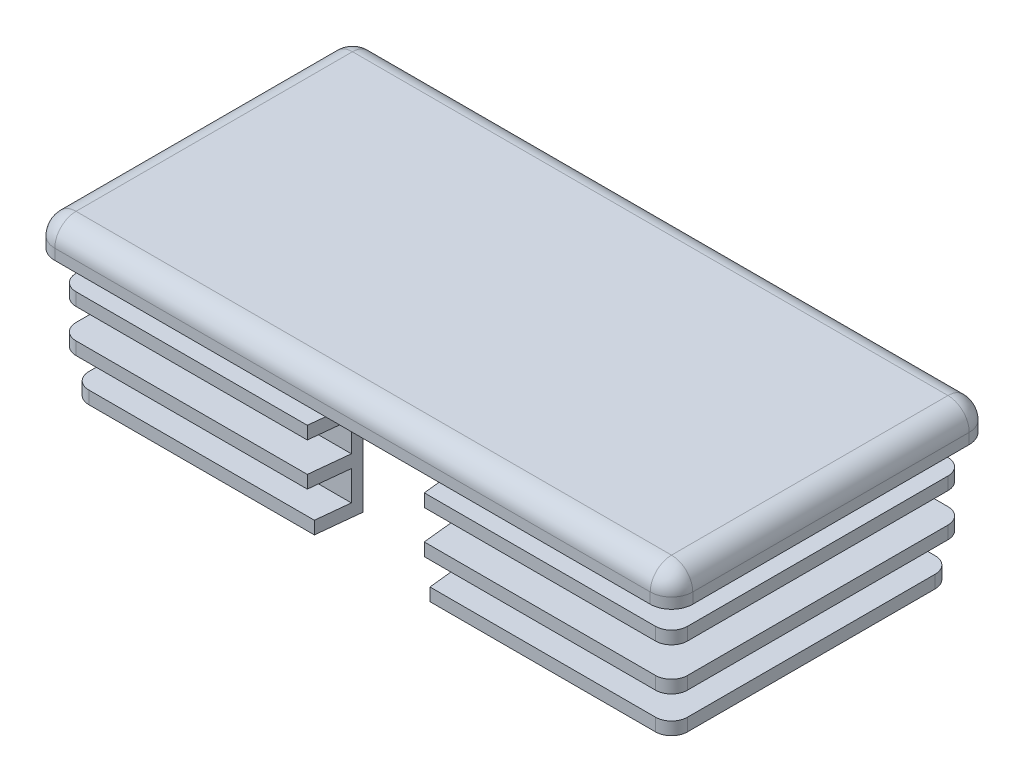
ISO-10303-21;
HEADER;
FILE_DESCRIPTION(('STEP AP214'),'2;1');
FILE_NAME('part.step','',(''),(''),'','','');
FILE_SCHEMA(('AUTOMOTIVE_DESIGN { 1 0 10303 214 1 1 1 1 }'));
ENDSEC;
DATA;
#1=APPLICATION_CONTEXT('core data for automotive mechanical design processes');
#2=APPLICATION_PROTOCOL_DEFINITION('international standard','automotive_design',2000,#1);
#3=PRODUCT_CONTEXT('',#1,'mechanical');
#4=PRODUCT('Part','Part','',(#3));
#5=PRODUCT_RELATED_PRODUCT_CATEGORY('part','',(#4));
#6=PRODUCT_DEFINITION_FORMATION('','',#4);
#7=PRODUCT_DEFINITION_CONTEXT('part definition',#1,'design');
#8=PRODUCT_DEFINITION('design','',#6,#7);
#9=PRODUCT_DEFINITION_SHAPE('','',#8);
#10=(LENGTH_UNIT() NAMED_UNIT(*) SI_UNIT(.MILLI.,.METRE.));
#11=(NAMED_UNIT(*) PLANE_ANGLE_UNIT() SI_UNIT($,.RADIAN.));
#12=(NAMED_UNIT(*) SI_UNIT($,.STERADIAN.) SOLID_ANGLE_UNIT());
#13=UNCERTAINTY_MEASURE_WITH_UNIT(LENGTH_MEASURE(1.E-05),#10,'distance_accuracy_value','');
#14=(GEOMETRIC_REPRESENTATION_CONTEXT(3) GLOBAL_UNCERTAINTY_ASSIGNED_CONTEXT((#13)) GLOBAL_UNIT_ASSIGNED_CONTEXT((#10,
#11,#12)) REPRESENTATION_CONTEXT('',''));
#15=CARTESIAN_POINT('',(0.,0.,0.));
#16=DIRECTION('',(0.,0.,1.));
#17=DIRECTION('',(1.,0.,0.));
#18=AXIS2_PLACEMENT_3D('',#15,#16,#17);
#19=CARTESIAN_POINT('',(-28.,-3.,-13.));
#20=DIRECTION('',(0.,1.,0.));
#21=DIRECTION('',(0.,0.,1.));
#22=AXIS2_PLACEMENT_3D('',#19,#20,#21);
#23=PLANE('',#22);
#24=CARTESIAN_POINT('',(-28.,-3.,-13.));
#25=DIRECTION('',(0.,1.,0.));
#26=DIRECTION('',(0.,0.,1.));
#27=AXIS2_PLACEMENT_3D('',#24,#25,#26);
#28=CIRCLE('',#27,2.);
#29=CARTESIAN_POINT('',(-28.,-3.,-15.));
#30=VERTEX_POINT('',#29);
#31=CARTESIAN_POINT('',(-30.,-3.,-13.));
#32=VERTEX_POINT('',#31);
#33=EDGE_CURVE('E1153',#30,#32,#28,.T.);
#34=ORIENTED_EDGE('',*,*,#33,.F.);
#35=DIRECTION('',(-1.,0.,0.));
#36=VECTOR('',#35,1.);
#37=CARTESIAN_POINT('',(-28.,-3.,-15.));
#38=LINE('',#37,#36);
#39=CARTESIAN_POINT('',(28.,-3.,-15.));
#40=VERTEX_POINT('',#39);
#41=EDGE_CURVE('E1174',#40,#30,#38,.T.);
#42=ORIENTED_EDGE('',*,*,#41,.F.);
#43=CARTESIAN_POINT('',(28.,-3.,-13.));
#44=DIRECTION('',(0.,1.,0.));
#45=DIRECTION('',(0.,0.,-1.));
#46=AXIS2_PLACEMENT_3D('',#43,#44,#45);
#47=CIRCLE('',#46,2.);
#48=CARTESIAN_POINT('',(30.,-3.,-13.));
#49=VERTEX_POINT('',#48);
#50=EDGE_CURVE('E1171',#49,#40,#47,.T.);
#51=ORIENTED_EDGE('',*,*,#50,.F.);
#52=DIRECTION('',(0.,0.,-1.));
#53=VECTOR('',#52,1.);
#54=CARTESIAN_POINT('',(30.,-3.,-13.));
#55=LINE('',#54,#53);
#56=CARTESIAN_POINT('',(30.,-3.,13.));
#57=VERTEX_POINT('',#56);
#58=EDGE_CURVE('E1168',#57,#49,#55,.T.);
#59=ORIENTED_EDGE('',*,*,#58,.F.);
#60=CARTESIAN_POINT('',(28.,-3.,13.));
#61=DIRECTION('',(0.,1.,0.));
#62=DIRECTION('',(0.,0.,-1.));
#63=AXIS2_PLACEMENT_3D('',#60,#61,#62);
#64=CIRCLE('',#63,2.);
#65=CARTESIAN_POINT('',(28.,-3.,15.));
#66=VERTEX_POINT('',#65);
#67=EDGE_CURVE('E1165',#66,#57,#64,.T.);
#68=ORIENTED_EDGE('',*,*,#67,.F.);
#69=DIRECTION('',(1.,0.,0.));
#70=VECTOR('',#69,1.);
#71=CARTESIAN_POINT('',(-28.,-3.,15.));
#72=LINE('',#71,#70);
#73=CARTESIAN_POINT('',(-28.,-3.,15.));
#74=VERTEX_POINT('',#73);
#75=EDGE_CURVE('E1162',#74,#66,#72,.T.);
#76=ORIENTED_EDGE('',*,*,#75,.F.);
#77=CARTESIAN_POINT('',(-28.,-3.,13.));
#78=DIRECTION('',(0.,1.,0.));
#79=DIRECTION('',(0.,0.,-1.));
#80=AXIS2_PLACEMENT_3D('',#77,#78,#79);
#81=CIRCLE('',#80,2.);
#82=CARTESIAN_POINT('',(-30.,-3.,13.));
#83=VERTEX_POINT('',#82);
#84=EDGE_CURVE('E1159',#83,#74,#81,.T.);
#85=ORIENTED_EDGE('',*,*,#84,.F.);
#86=DIRECTION('',(0.,0.,1.));
#87=VECTOR('',#86,1.);
#88=CARTESIAN_POINT('',(-30.,-3.,-13.));
#89=LINE('',#88,#87);
#90=EDGE_CURVE('E1156',#32,#83,#89,.T.);
#91=ORIENTED_EDGE('',*,*,#90,.F.);
#92=EDGE_LOOP('',(#34,#42,#51,#59,#68,#76,#85,#91));
#93=FACE_BOUND('',#92,.T.);
#94=DIRECTION('',(1.,0.,0.));
#95=VECTOR('',#94,1.);
#96=CARTESIAN_POINT('',(-25.,-3.,-6.25));
#97=LINE('',#96,#95);
#98=CARTESIAN_POINT('',(-24.,-3.,-6.25));
#99=VERTEX_POINT('',#98);
#100=CARTESIAN_POINT('',(24.,-3.,-6.25));
#101=VERTEX_POINT('',#100);
#102=EDGE_CURVE('E648',#99,#101,#97,.T.);
#103=ORIENTED_EDGE('',*,*,#102,.F.);
#104=DIRECTION('',(0.,0.,-1.));
#105=VECTOR('',#104,1.);
#106=CARTESIAN_POINT('',(-24.,-3.,8.));
#107=LINE('',#106,#105);
#108=CARTESIAN_POINT('',(-24.,-3.,-8.));
#109=VERTEX_POINT('',#108);
#110=EDGE_CURVE('E660',#99,#109,#107,.T.);
#111=ORIENTED_EDGE('',*,*,#110,.T.);
#112=CARTESIAN_POINT('',(-23.,-3.,-8.));
#113=DIRECTION('',(0.,1.,0.));
#114=DIRECTION('',(0.,0.,1.));
#115=AXIS2_PLACEMENT_3D('',#112,#113,#114);
#116=CIRCLE('',#115,1.);
#117=CARTESIAN_POINT('',(-23.,-3.,-9.));
#118=VERTEX_POINT('',#117);
#119=EDGE_CURVE('E682',#109,#118,#116,.F.);
#120=ORIENTED_EDGE('',*,*,#119,.T.);
#121=DIRECTION('',(1.,0.,0.));
#122=VECTOR('',#121,1.);
#123=CARTESIAN_POINT('',(-23.,-3.,-9.));
#124=LINE('',#123,#122);
#125=CARTESIAN_POINT('',(-5.,-3.,-9.));
#126=VERTEX_POINT('',#125);
#127=EDGE_CURVE('E734',#118,#126,#124,.T.);
#128=ORIENTED_EDGE('',*,*,#127,.T.);
#129=DIRECTION('',(-0.104684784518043,0.,-0.994505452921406));
#130=VECTOR('',#129,1.);
#131=CARTESIAN_POINT('',(-5.,-3.,-9.));
#132=LINE('',#131,#130);
#133=CARTESIAN_POINT('',(-5.10526315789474,-3.,-10.));
#134=VERTEX_POINT('',#133);
#135=EDGE_CURVE('E688',#126,#134,#132,.T.);
#136=ORIENTED_EDGE('',*,*,#135,.T.);
#137=DIRECTION('',(1.,0.,0.));
#138=VECTOR('',#137,1.);
#139=CARTESIAN_POINT('',(-23.,-3.,-10.));
#140=LINE('',#139,#138);
#141=CARTESIAN_POINT('',(-23.,-3.,-10.));
#142=VERTEX_POINT('',#141);
#143=EDGE_CURVE('E1025',#142,#134,#140,.T.);
#144=ORIENTED_EDGE('',*,*,#143,.F.);
#145=CARTESIAN_POINT('',(-23.,-3.,-8.));
#146=DIRECTION('',(0.,-1.,0.));
#147=DIRECTION('',(0.,0.,-1.));
#148=AXIS2_PLACEMENT_3D('',#145,#146,#147);
#149=CIRCLE('',#148,2.);
#150=CARTESIAN_POINT('',(-25.,-3.,-8.));
#151=VERTEX_POINT('',#150);
#152=EDGE_CURVE('E1021',#151,#142,#149,.T.);
#153=ORIENTED_EDGE('',*,*,#152,.F.);
#154=DIRECTION('',(0.,0.,-1.));
#155=VECTOR('',#154,1.);
#156=CARTESIAN_POINT('',(-25.,-3.,8.));
#157=LINE('',#156,#155);
#158=CARTESIAN_POINT('',(-25.,-3.,8.));
#159=VERTEX_POINT('',#158);
#160=EDGE_CURVE('E1019',#159,#151,#157,.T.);
#161=ORIENTED_EDGE('',*,*,#160,.F.);
#162=CARTESIAN_POINT('',(-23.,-3.,8.));
#163=DIRECTION('',(0.,-1.,0.));
#164=DIRECTION('',(0.,0.,-1.));
#165=AXIS2_PLACEMENT_3D('',#162,#163,#164);
#166=CIRCLE('',#165,2.);
#167=CARTESIAN_POINT('',(-23.,-3.,10.));
#168=VERTEX_POINT('',#167);
#169=EDGE_CURVE('E1016',#168,#159,#166,.T.);
#170=ORIENTED_EDGE('',*,*,#169,.F.);
#171=DIRECTION('',(-1.,0.,0.));
#172=VECTOR('',#171,1.);
#173=CARTESIAN_POINT('',(-23.,-3.,10.));
#174=LINE('',#173,#172);
#175=CARTESIAN_POINT('',(-5.10526315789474,-3.,10.));
#176=VERTEX_POINT('',#175);
#177=EDGE_CURVE('E1036',#176,#168,#174,.T.);
#178=ORIENTED_EDGE('',*,*,#177,.F.);
#179=DIRECTION('',(0.104684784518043,0.,-0.994505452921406));
#180=VECTOR('',#179,1.);
#181=CARTESIAN_POINT('',(-5.,-3.,9.));
#182=LINE('',#181,#180);
#183=CARTESIAN_POINT('',(-5.,-3.,9.));
#184=VERTEX_POINT('',#183);
#185=EDGE_CURVE('E697',#176,#184,#182,.T.);
#186=ORIENTED_EDGE('',*,*,#185,.T.);
#187=DIRECTION('',(-1.,0.,0.));
#188=VECTOR('',#187,1.);
#189=CARTESIAN_POINT('',(-23.,-3.,9.));
#190=LINE('',#189,#188);
#191=CARTESIAN_POINT('',(-23.,-3.,9.));
#192=VERTEX_POINT('',#191);
#193=EDGE_CURVE('E693',#184,#192,#190,.T.);
#194=ORIENTED_EDGE('',*,*,#193,.T.);
#195=CARTESIAN_POINT('',(-23.,-3.,8.));
#196=DIRECTION('',(0.,1.,0.));
#197=DIRECTION('',(0.,0.,1.));
#198=AXIS2_PLACEMENT_3D('',#195,#196,#197);
#199=CIRCLE('',#198,1.);
#200=CARTESIAN_POINT('',(-24.,-3.,8.));
#201=VERTEX_POINT('',#200);
#202=EDGE_CURVE('E675',#192,#201,#199,.F.);
#203=ORIENTED_EDGE('',*,*,#202,.T.);
#204=CARTESIAN_POINT('',(-24.,-3.,6.25));
#205=VERTEX_POINT('',#204);
#206=EDGE_CURVE('E673',#201,#205,#107,.T.);
#207=ORIENTED_EDGE('',*,*,#206,.T.);
#208=DIRECTION('',(-1.,0.,0.));
#209=VECTOR('',#208,1.);
#210=CARTESIAN_POINT('',(-25.,-3.,6.25));
#211=LINE('',#210,#209);
#212=CARTESIAN_POINT('',(24.,-3.,6.25));
#213=VERTEX_POINT('',#212);
#214=EDGE_CURVE('E1336',#213,#205,#211,.T.);
#215=ORIENTED_EDGE('',*,*,#214,.F.);
#216=DIRECTION('',(0.,0.,1.));
#217=VECTOR('',#216,1.);
#218=CARTESIAN_POINT('',(24.,-3.,8.));
#219=LINE('',#218,#217);
#220=CARTESIAN_POINT('',(24.,-3.,8.));
#221=VERTEX_POINT('',#220);
#222=EDGE_CURVE('E716',#213,#221,#219,.T.);
#223=ORIENTED_EDGE('',*,*,#222,.T.);
#224=CARTESIAN_POINT('',(23.,-3.,8.));
#225=DIRECTION('',(0.,1.,0.));
#226=DIRECTION('',(0.,0.,1.));
#227=AXIS2_PLACEMENT_3D('',#224,#225,#226);
#228=CIRCLE('',#227,1.);
#229=CARTESIAN_POINT('',(23.,-3.,9.));
#230=VERTEX_POINT('',#229);
#231=EDGE_CURVE('E711',#221,#230,#228,.F.);
#232=ORIENTED_EDGE('',*,*,#231,.T.);
#233=DIRECTION('',(-1.,0.,0.));
#234=VECTOR('',#233,1.);
#235=CARTESIAN_POINT('',(5.,-3.,9.));
#236=LINE('',#235,#234);
#237=CARTESIAN_POINT('',(5.,-3.,9.));
#238=VERTEX_POINT('',#237);
#239=EDGE_CURVE('E708',#230,#238,#236,.T.);
#240=ORIENTED_EDGE('',*,*,#239,.T.);
#241=DIRECTION('',(0.104684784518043,0.,0.994505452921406));
#242=VECTOR('',#241,1.);
#243=CARTESIAN_POINT('',(5.,-3.,9.));
#244=LINE('',#243,#242);
#245=CARTESIAN_POINT('',(5.10526315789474,-3.,10.));
#246=VERTEX_POINT('',#245);
#247=EDGE_CURVE('E705',#238,#246,#244,.T.);
#248=ORIENTED_EDGE('',*,*,#247,.T.);
#249=CARTESIAN_POINT('',(23.,-3.,10.));
#250=VERTEX_POINT('',#249);
#251=EDGE_CURVE('E1037',#250,#246,#174,.T.);
#252=ORIENTED_EDGE('',*,*,#251,.F.);
#253=CARTESIAN_POINT('',(23.,-3.,8.));
#254=DIRECTION('',(0.,-1.,0.));
#255=DIRECTION('',(0.,0.,-1.));
#256=AXIS2_PLACEMENT_3D('',#253,#254,#255);
#257=CIRCLE('',#256,2.);
#258=CARTESIAN_POINT('',(25.,-3.,8.));
#259=VERTEX_POINT('',#258);
#260=EDGE_CURVE('E1033',#259,#250,#257,.T.);
#261=ORIENTED_EDGE('',*,*,#260,.F.);
#262=DIRECTION('',(0.,0.,1.));
#263=VECTOR('',#262,1.);
#264=CARTESIAN_POINT('',(25.,-3.,8.));
#265=LINE('',#264,#263);
#266=CARTESIAN_POINT('',(25.,-3.,-8.));
#267=VERTEX_POINT('',#266);
#268=EDGE_CURVE('E1031',#267,#259,#265,.T.);
#269=ORIENTED_EDGE('',*,*,#268,.F.);
#270=CARTESIAN_POINT('',(23.,-3.,-8.));
#271=DIRECTION('',(0.,-1.,0.));
#272=DIRECTION('',(0.,0.,-1.));
#273=AXIS2_PLACEMENT_3D('',#270,#271,#272);
#274=CIRCLE('',#273,2.);
#275=CARTESIAN_POINT('',(23.,-3.,-10.));
#276=VERTEX_POINT('',#275);
#277=EDGE_CURVE('E1028',#276,#267,#274,.T.);
#278=ORIENTED_EDGE('',*,*,#277,.F.);
#279=CARTESIAN_POINT('',(5.10526315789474,-3.,-10.));
#280=VERTEX_POINT('',#279);
#281=EDGE_CURVE('E1024',#280,#276,#140,.T.);
#282=ORIENTED_EDGE('',*,*,#281,.F.);
#283=DIRECTION('',(-0.104684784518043,0.,0.994505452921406));
#284=VECTOR('',#283,1.);
#285=CARTESIAN_POINT('',(5.,-3.,-9.));
#286=LINE('',#285,#284);
#287=CARTESIAN_POINT('',(5.,-3.,-9.));
#288=VERTEX_POINT('',#287);
#289=EDGE_CURVE('E724',#280,#288,#286,.T.);
#290=ORIENTED_EDGE('',*,*,#289,.T.);
#291=DIRECTION('',(1.,0.,0.));
#292=VECTOR('',#291,1.);
#293=CARTESIAN_POINT('',(5.,-3.,-9.));
#294=LINE('',#293,#292);
#295=CARTESIAN_POINT('',(23.,-3.,-9.));
#296=VERTEX_POINT('',#295);
#297=EDGE_CURVE('E720',#288,#296,#294,.T.);
#298=ORIENTED_EDGE('',*,*,#297,.T.);
#299=CARTESIAN_POINT('',(23.,-3.,-8.));
#300=DIRECTION('',(0.,1.,0.));
#301=DIRECTION('',(0.,0.,1.));
#302=AXIS2_PLACEMENT_3D('',#299,#300,#301);
#303=CIRCLE('',#302,1.);
#304=CARTESIAN_POINT('',(24.,-3.,-8.));
#305=VERTEX_POINT('',#304);
#306=EDGE_CURVE('E717',#296,#305,#303,.F.);
#307=ORIENTED_EDGE('',*,*,#306,.T.);
#308=EDGE_CURVE('E663',#305,#101,#219,.T.);
#309=ORIENTED_EDGE('',*,*,#308,.T.);
#310=EDGE_LOOP('',(#103,#111,#120,#128,#136,#144,#153,#161,#170,#178,#186,#194,#203,#207,#215,
#223,#232,#240,#248,#252,#261,#269,#278,#282,#290,#298,#307,#309));
#311=FACE_BOUND('',#310,.T.);
#312=ADVANCED_FACE('F16',(#93,#311),#23,.F.);
#313=DIRECTION('',(-1.,0.,0.));
#314=VECTOR('',#313,1.);
#315=CARTESIAN_POINT('',(-25.,-3.,-4.75));
#316=LINE('',#315,#314);
#317=CARTESIAN_POINT('',(24.,-3.,-4.75));
#318=VERTEX_POINT('',#317);
#319=CARTESIAN_POINT('',(-24.,-3.,-4.75));
#320=VERTEX_POINT('',#319);
#321=EDGE_CURVE('E664',#318,#320,#316,.T.);
#322=ORIENTED_EDGE('',*,*,#321,.F.);
#323=CARTESIAN_POINT('',(24.,-3.,4.75));
#324=VERTEX_POINT('',#323);
#325=EDGE_CURVE('E1335',#318,#324,#219,.T.);
#326=ORIENTED_EDGE('',*,*,#325,.T.);
#327=DIRECTION('',(1.,0.,0.));
#328=VECTOR('',#327,1.);
#329=CARTESIAN_POINT('',(-25.,-3.,4.75));
#330=LINE('',#329,#328);
#331=CARTESIAN_POINT('',(-24.,-3.,4.75));
#332=VERTEX_POINT('',#331);
#333=EDGE_CURVE('E1326',#332,#324,#330,.T.);
#334=ORIENTED_EDGE('',*,*,#333,.F.);
#335=EDGE_CURVE('E670',#332,#320,#107,.T.);
#336=ORIENTED_EDGE('',*,*,#335,.T.);
#337=EDGE_LOOP('',(#322,#326,#334,#336));
#338=FACE_BOUND('',#337,.T.);
#339=ADVANCED_FACE('F1333',(#338),#23,.F.);
#340=CARTESIAN_POINT('',(24.,52.3195263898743,8.));
#341=DIRECTION('',(1.,0.,0.));
#342=DIRECTION('',(0.,0.,-1.));
#343=AXIS2_PLACEMENT_3D('',#340,#341,#342);
#344=PLANE('',#343);
#345=DIRECTION('',(0.,-1.,0.));
#346=VECTOR('',#345,1.);
#347=CARTESIAN_POINT('',(24.,52.3195263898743,-6.25));
#348=LINE('',#347,#346);
#349=CARTESIAN_POINT('',(24.,-6.,-6.25));
#350=VERTEX_POINT('',#349);
#351=EDGE_CURVE('E654',#101,#350,#348,.T.);
#352=ORIENTED_EDGE('',*,*,#351,.F.);
#353=ORIENTED_EDGE('',*,*,#308,.F.);
#354=DIRECTION('',(0.,-1.,0.));
#355=VECTOR('',#354,1.);
#356=CARTESIAN_POINT('',(24.,52.3195263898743,-8.));
#357=LINE('',#356,#355);
#358=CARTESIAN_POINT('',(24.,-15.,-8.));
#359=VERTEX_POINT('',#358);
#360=EDGE_CURVE('E714',#305,#359,#357,.T.);
#361=ORIENTED_EDGE('',*,*,#360,.T.);
#362=DIRECTION('',(0.,0.,1.));
#363=VECTOR('',#362,1.);
#364=CARTESIAN_POINT('',(24.,-15.,8.));
#365=LINE('',#364,#363);
#366=CARTESIAN_POINT('',(24.,-15.,8.));
#367=VERTEX_POINT('',#366);
#368=EDGE_CURVE('E1379',#359,#367,#365,.T.);
#369=ORIENTED_EDGE('',*,*,#368,.T.);
#370=DIRECTION('',(0.,-1.,0.));
#371=VECTOR('',#370,1.);
#372=CARTESIAN_POINT('',(24.,52.3195263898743,8.));
#373=LINE('',#372,#371);
#374=EDGE_CURVE('E712',#221,#367,#373,.T.);
#375=ORIENTED_EDGE('',*,*,#374,.F.);
#376=ORIENTED_EDGE('',*,*,#222,.F.);
#377=DIRECTION('',(0.,1.,0.));
#378=VECTOR('',#377,1.);
#379=CARTESIAN_POINT('',(24.,52.3195263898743,6.25));
#380=LINE('',#379,#378);
#381=CARTESIAN_POINT('',(24.,-6.,6.25));
#382=VERTEX_POINT('',#381);
#383=EDGE_CURVE('E1356',#382,#213,#380,.T.);
#384=ORIENTED_EDGE('',*,*,#383,.F.);
#385=DIRECTION('',(0.,0.,-1.));
#386=VECTOR('',#385,1.);
#387=CARTESIAN_POINT('',(24.,-6.,8.));
#388=LINE('',#387,#386);
#389=CARTESIAN_POINT('',(24.,-6.,4.75));
#390=VERTEX_POINT('',#389);
#391=EDGE_CURVE('E1353',#382,#390,#388,.T.);
#392=ORIENTED_EDGE('',*,*,#391,.T.);
#393=DIRECTION('',(0.,-1.,0.));
#394=VECTOR('',#393,1.);
#395=CARTESIAN_POINT('',(24.,52.3195263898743,4.75));
#396=LINE('',#395,#394);
#397=EDGE_CURVE('E1358',#324,#390,#396,.T.);
#398=ORIENTED_EDGE('',*,*,#397,.F.);
#399=ORIENTED_EDGE('',*,*,#325,.F.);
#400=DIRECTION('',(0.,1.,0.));
#401=VECTOR('',#400,1.);
#402=CARTESIAN_POINT('',(24.,52.3195263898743,-4.75));
#403=LINE('',#402,#401);
#404=CARTESIAN_POINT('',(24.,-6.,-4.75));
#405=VERTEX_POINT('',#404);
#406=EDGE_CURVE('E655',#405,#318,#403,.T.);
#407=ORIENTED_EDGE('',*,*,#406,.F.);
#408=DIRECTION('',(0.,0.,-1.));
#409=VECTOR('',#408,1.);
#410=CARTESIAN_POINT('',(24.,-6.,8.));
#411=LINE('',#410,#409);
#412=EDGE_CURVE('E1337',#405,#350,#411,.T.);
#413=ORIENTED_EDGE('',*,*,#412,.T.);
#414=EDGE_LOOP('',(#352,#353,#361,#369,#375,#376,#384,#392,#398,#399,#407,#413));
#415=FACE_BOUND('',#414,.T.);
#416=ADVANCED_FACE('F1549',(#415),#344,.F.);
#417=CARTESIAN_POINT('',(-24.,52.3195263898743,8.));
#418=DIRECTION('',(-1.,0.,0.));
#419=DIRECTION('',(0.,0.,1.));
#420=AXIS2_PLACEMENT_3D('',#417,#418,#419);
#421=PLANE('',#420);
#422=DIRECTION('',(0.,1.,0.));
#423=VECTOR('',#422,1.);
#424=CARTESIAN_POINT('',(-24.,52.3195263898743,-6.25));
#425=LINE('',#424,#423);
#426=CARTESIAN_POINT('',(-24.,-6.,-6.25));
#427=VERTEX_POINT('',#426);
#428=EDGE_CURVE('E645',#427,#99,#425,.T.);
#429=ORIENTED_EDGE('',*,*,#428,.F.);
#430=DIRECTION('',(0.,0.,1.));
#431=VECTOR('',#430,1.);
#432=CARTESIAN_POINT('',(-24.,-6.,8.));
#433=LINE('',#432,#431);
#434=CARTESIAN_POINT('',(-24.,-6.,-4.75));
#435=VERTEX_POINT('',#434);
#436=EDGE_CURVE('E11',#427,#435,#433,.T.);
#437=ORIENTED_EDGE('',*,*,#436,.T.);
#438=DIRECTION('',(0.,-1.,0.));
#439=VECTOR('',#438,1.);
#440=CARTESIAN_POINT('',(-24.,52.3195263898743,-4.75));
#441=LINE('',#440,#439);
#442=EDGE_CURVE('E1340',#320,#435,#441,.T.);
#443=ORIENTED_EDGE('',*,*,#442,.F.);
#444=ORIENTED_EDGE('',*,*,#335,.F.);
#445=DIRECTION('',(0.,1.,0.));
#446=VECTOR('',#445,1.);
#447=CARTESIAN_POINT('',(-24.,52.3195263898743,4.75));
#448=LINE('',#447,#446);
#449=CARTESIAN_POINT('',(-24.,-6.,4.75));
#450=VERTEX_POINT('',#449);
#451=EDGE_CURVE('E24',#450,#332,#448,.T.);
#452=ORIENTED_EDGE('',*,*,#451,.F.);
#453=DIRECTION('',(0.,0.,1.));
#454=VECTOR('',#453,1.);
#455=CARTESIAN_POINT('',(-24.,-6.,8.));
#456=LINE('',#455,#454);
#457=CARTESIAN_POINT('',(-24.,-6.,6.25));
#458=VERTEX_POINT('',#457);
#459=EDGE_CURVE('E1316',#450,#458,#456,.T.);
#460=ORIENTED_EDGE('',*,*,#459,.T.);
#461=DIRECTION('',(0.,-1.,0.));
#462=VECTOR('',#461,1.);
#463=CARTESIAN_POINT('',(-24.,52.3195263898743,6.25));
#464=LINE('',#463,#462);
#465=EDGE_CURVE('E1319',#205,#458,#464,.T.);
#466=ORIENTED_EDGE('',*,*,#465,.F.);
#467=ORIENTED_EDGE('',*,*,#206,.F.);
#468=DIRECTION('',(0.,-1.,0.));
#469=VECTOR('',#468,1.);
#470=CARTESIAN_POINT('',(-24.,52.3195263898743,8.));
#471=LINE('',#470,#469);
#472=CARTESIAN_POINT('',(-24.,-15.,8.));
#473=VERTEX_POINT('',#472);
#474=EDGE_CURVE('E671',#201,#473,#471,.T.);
#475=ORIENTED_EDGE('',*,*,#474,.T.);
#476=DIRECTION('',(0.,0.,-1.));
#477=VECTOR('',#476,1.);
#478=CARTESIAN_POINT('',(-24.,-15.,8.));
#479=LINE('',#478,#477);
#480=CARTESIAN_POINT('',(-24.,-15.,-8.));
#481=VERTEX_POINT('',#480);
#482=EDGE_CURVE('E1361',#473,#481,#479,.T.);
#483=ORIENTED_EDGE('',*,*,#482,.T.);
#484=DIRECTION('',(0.,-1.,0.));
#485=VECTOR('',#484,1.);
#486=CARTESIAN_POINT('',(-24.,52.3195263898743,-8.));
#487=LINE('',#486,#485);
#488=EDGE_CURVE('E669',#109,#481,#487,.T.);
#489=ORIENTED_EDGE('',*,*,#488,.F.);
#490=ORIENTED_EDGE('',*,*,#110,.F.);
#491=EDGE_LOOP('',(#429,#437,#443,#444,#452,#460,#466,#467,#475,#483,#489,#490));
#492=FACE_BOUND('',#491,.T.);
#493=ADVANCED_FACE('F667',(#492),#421,.F.);
#494=CARTESIAN_POINT('',(-28.75,-11.,-13.75));
#495=DIRECTION('',(0.,0.,1.));
#496=DIRECTION('',(1.,0.,0.));
#497=AXIS2_PLACEMENT_3D('',#494,#495,#496);
#498=PLANE('',#497);
#499=DIRECTION('',(1.,0.,0.));
#500=VECTOR('',#499,1.);
#501=CARTESIAN_POINT('',(-28.75,-5.8,-13.75));
#502=LINE('',#501,#500);
#503=CARTESIAN_POINT('',(-27.25,-5.8,-13.75));
#504=VERTEX_POINT('',#503);
#505=CARTESIAN_POINT('',(-5.5,-5.8,-13.75));
#506=VERTEX_POINT('',#505);
#507=EDGE_CURVE('E1086',#504,#506,#502,.T.);
#508=ORIENTED_EDGE('',*,*,#507,.T.);
#509=DIRECTION('',(0.,-1.,0.));
#510=VECTOR('',#509,1.);
#511=CARTESIAN_POINT('',(-5.5,52.3195263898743,-13.75));
#512=LINE('',#511,#510);
#513=CARTESIAN_POINT('',(-5.5,-7.,-13.75));
#514=VERTEX_POINT('',#513);
#515=EDGE_CURVE('E728',#506,#514,#512,.T.);
#516=ORIENTED_EDGE('',*,*,#515,.T.);
#517=DIRECTION('',(1.,0.,0.));
#518=VECTOR('',#517,1.);
#519=CARTESIAN_POINT('',(-28.75,-7.,-13.75));
#520=LINE('',#519,#518);
#521=CARTESIAN_POINT('',(-27.25,-7.,-13.75));
#522=VERTEX_POINT('',#521);
#523=EDGE_CURVE('E977',#522,#514,#520,.T.);
#524=ORIENTED_EDGE('',*,*,#523,.F.);
#525=DIRECTION('',(0.,1.,0.));
#526=VECTOR('',#525,1.);
#527=CARTESIAN_POINT('',(-27.25,-11.,-13.75));
#528=LINE('',#527,#526);
#529=EDGE_CURVE('E1251',#522,#504,#528,.T.);
#530=ORIENTED_EDGE('',*,*,#529,.T.);
#531=EDGE_LOOP('',(#508,#516,#524,#530));
#532=FACE_BOUND('',#531,.T.);
#533=ADVANCED_FACE('F1904',(#532),#498,.F.);
#534=CARTESIAN_POINT('',(-28.75,-11.,13.75));
#535=DIRECTION('',(0.,0.,-1.));
#536=DIRECTION('',(-1.,0.,0.));
#537=AXIS2_PLACEMENT_3D('',#534,#535,#536);
#538=PLANE('',#537);
#539=DIRECTION('',(-1.,0.,0.));
#540=VECTOR('',#539,1.);
#541=CARTESIAN_POINT('',(-28.75,-5.8,13.75));
#542=LINE('',#541,#540);
#543=CARTESIAN_POINT('',(27.25,-5.8,13.75));
#544=VERTEX_POINT('',#543);
#545=CARTESIAN_POINT('',(5.5,-5.8,13.75));
#546=VERTEX_POINT('',#545);
#547=EDGE_CURVE('E1094',#544,#546,#542,.T.);
#548=ORIENTED_EDGE('',*,*,#547,.T.);
#549=DIRECTION('',(0.,-1.,0.));
#550=VECTOR('',#549,1.);
#551=CARTESIAN_POINT('',(5.5,52.3195263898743,13.75));
#552=LINE('',#551,#550);
#553=CARTESIAN_POINT('',(5.5,-7.,13.75));
#554=VERTEX_POINT('',#553);
#555=EDGE_CURVE('E701',#546,#554,#552,.T.);
#556=ORIENTED_EDGE('',*,*,#555,.T.);
#557=DIRECTION('',(-1.,0.,0.));
#558=VECTOR('',#557,1.);
#559=CARTESIAN_POINT('',(-28.75,-7.,13.75));
#560=LINE('',#559,#558);
#561=CARTESIAN_POINT('',(27.25,-7.,13.75));
#562=VERTEX_POINT('',#561);
#563=EDGE_CURVE('E987',#562,#554,#560,.T.);
#564=ORIENTED_EDGE('',*,*,#563,.F.);
#565=DIRECTION('',(0.,1.,0.));
#566=VECTOR('',#565,1.);
#567=CARTESIAN_POINT('',(27.25,-11.,13.75));
#568=LINE('',#567,#566);
#569=EDGE_CURVE('E1271',#562,#544,#568,.T.);
#570=ORIENTED_EDGE('',*,*,#569,.T.);
#571=EDGE_LOOP('',(#548,#556,#564,#570));
#572=FACE_BOUND('',#571,.T.);
#573=ADVANCED_FACE('F1933',(#572),#538,.F.);
#574=CARTESIAN_POINT('',(-23.,-5.8,8.));
#575=DIRECTION('',(0.,-1.,0.));
#576=DIRECTION('',(0.,0.,-1.));
#577=AXIS2_PLACEMENT_3D('',#574,#575,#576);
#578=PLANE('',#577);
#579=DIRECTION('',(1.,0.,0.));
#580=VECTOR('',#579,1.);
#581=CARTESIAN_POINT('',(-23.,-5.8,-10.));
#582=LINE('',#581,#580);
#583=CARTESIAN_POINT('',(-23.,-5.8,-10.));
#584=VERTEX_POINT('',#583);
#585=CARTESIAN_POINT('',(-5.10526315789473,-5.8,-10.));
#586=VERTEX_POINT('',#585);
#587=EDGE_CURVE('E1047',#584,#586,#582,.T.);
#588=ORIENTED_EDGE('',*,*,#587,.T.);
#589=DIRECTION('',(-0.104684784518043,0.,-0.994505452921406));
#590=VECTOR('',#589,1.);
#591=CARTESIAN_POINT('',(-3.42739726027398,-5.8,5.93972602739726));
#592=LINE('',#591,#590);
#593=EDGE_CURVE('E777',#586,#506,#592,.T.);
#594=ORIENTED_EDGE('',*,*,#593,.T.);
#595=ORIENTED_EDGE('',*,*,#507,.F.);
#596=CARTESIAN_POINT('',(-27.25,-5.8,-12.25));
#597=DIRECTION('',(0.,-1.,0.));
#598=DIRECTION('',(0.,0.,-1.));
#599=AXIS2_PLACEMENT_3D('',#596,#597,#598);
#600=CIRCLE('',#599,1.5);
#601=CARTESIAN_POINT('',(-28.75,-5.8,-12.25));
#602=VERTEX_POINT('',#601);
#603=EDGE_CURVE('E1091',#504,#602,#600,.F.);
#604=ORIENTED_EDGE('',*,*,#603,.T.);
#605=DIRECTION('',(0.,0.,-1.));
#606=VECTOR('',#605,1.);
#607=CARTESIAN_POINT('',(-28.75,-5.8,13.75));
#608=LINE('',#607,#606);
#609=CARTESIAN_POINT('',(-28.75,-5.8,12.25));
#610=VERTEX_POINT('',#609);
#611=EDGE_CURVE('E1097',#610,#602,#608,.T.);
#612=ORIENTED_EDGE('',*,*,#611,.F.);
#613=CARTESIAN_POINT('',(-27.25,-5.8,12.25));
#614=DIRECTION('',(0.,-1.,0.));
#615=DIRECTION('',(0.,0.,-1.));
#616=AXIS2_PLACEMENT_3D('',#613,#614,#615);
#617=CIRCLE('',#616,1.5);
#618=CARTESIAN_POINT('',(-27.25,-5.8,13.75));
#619=VERTEX_POINT('',#618);
#620=EDGE_CURVE('E1100',#610,#619,#617,.F.);
#621=ORIENTED_EDGE('',*,*,#620,.T.);
#622=CARTESIAN_POINT('',(-5.5,-5.8,13.75));
#623=VERTEX_POINT('',#622);
#624=EDGE_CURVE('E1093',#623,#619,#542,.T.);
#625=ORIENTED_EDGE('',*,*,#624,.F.);
#626=DIRECTION('',(0.104684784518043,0.,-0.994505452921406));
#627=VECTOR('',#626,1.);
#628=CARTESIAN_POINT('',(-5.09315068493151,-5.8,9.88493150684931));
#629=LINE('',#628,#627);
#630=CARTESIAN_POINT('',(-5.10526315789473,-5.8,10.));
#631=VERTEX_POINT('',#630);
#632=EDGE_CURVE('E799',#623,#631,#629,.T.);
#633=ORIENTED_EDGE('',*,*,#632,.T.);
#634=DIRECTION('',(-1.,0.,0.));
#635=VECTOR('',#634,1.);
#636=CARTESIAN_POINT('',(-23.,-5.8,10.));
#637=LINE('',#636,#635);
#638=CARTESIAN_POINT('',(-23.,-5.8,10.));
#639=VERTEX_POINT('',#638);
#640=EDGE_CURVE('E1057',#631,#639,#637,.T.);
#641=ORIENTED_EDGE('',*,*,#640,.T.);
#642=CARTESIAN_POINT('',(-23.,-5.8,8.));
#643=DIRECTION('',(0.,-1.,0.));
#644=DIRECTION('',(0.,0.,-1.));
#645=AXIS2_PLACEMENT_3D('',#642,#643,#644);
#646=CIRCLE('',#645,2.);
#647=CARTESIAN_POINT('',(-25.,-5.8,8.));
#648=VERTEX_POINT('',#647);
#649=EDGE_CURVE('E1040',#639,#648,#646,.T.);
#650=ORIENTED_EDGE('',*,*,#649,.T.);
#651=DIRECTION('',(0.,0.,-1.));
#652=VECTOR('',#651,1.);
#653=CARTESIAN_POINT('',(-25.,-5.8,8.));
#654=LINE('',#653,#652);
#655=CARTESIAN_POINT('',(-25.,-5.8,-8.));
#656=VERTEX_POINT('',#655);
#657=EDGE_CURVE('E1042',#648,#656,#654,.T.);
#658=ORIENTED_EDGE('',*,*,#657,.T.);
#659=CARTESIAN_POINT('',(-23.,-5.8,-8.));
#660=DIRECTION('',(0.,-1.,0.));
#661=DIRECTION('',(0.,0.,-1.));
#662=AXIS2_PLACEMENT_3D('',#659,#660,#661);
#663=CIRCLE('',#662,2.);
#664=EDGE_CURVE('E1044',#656,#584,#663,.T.);
#665=ORIENTED_EDGE('',*,*,#664,.T.);
#666=EDGE_LOOP('',(#588,#594,#595,#604,#612,#621,#625,#633,#641,#650,#658,#665));
#667=FACE_BOUND('',#666,.T.);
#668=ADVANCED_FACE('F1412',(#667),#578,.F.);
#669=CARTESIAN_POINT('',(-23.,-5.8,-10.));
#670=DIRECTION('',(0.,0.,1.));
#671=DIRECTION('',(1.,0.,0.));
#672=AXIS2_PLACEMENT_3D('',#669,#670,#671);
#673=PLANE('',#672);
#674=ORIENTED_EDGE('',*,*,#143,.T.);
#675=DIRECTION('',(0.,-1.,0.));
#676=VECTOR('',#675,1.);
#677=CARTESIAN_POINT('',(-5.10526315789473,-5.8,-10.));
#678=LINE('',#677,#676);
#679=EDGE_CURVE('E774',#134,#586,#678,.T.);
#680=ORIENTED_EDGE('',*,*,#679,.T.);
#681=ORIENTED_EDGE('',*,*,#587,.F.);
#682=DIRECTION('',(0.,1.,0.));
#683=VECTOR('',#682,1.);
#684=CARTESIAN_POINT('',(-23.,-5.8,-10.));
#685=LINE('',#684,#683);
#686=EDGE_CURVE('E1074',#584,#142,#685,.T.);
#687=ORIENTED_EDGE('',*,*,#686,.T.);
#688=EDGE_LOOP('',(#674,#680,#681,#687));
#689=FACE_BOUND('',#688,.T.);
#690=ADVANCED_FACE('F1410',(#689),#673,.F.);
#691=CARTESIAN_POINT('',(-23.,-5.8,10.));
#692=DIRECTION('',(0.,0.,-1.));
#693=DIRECTION('',(-1.,0.,0.));
#694=AXIS2_PLACEMENT_3D('',#691,#692,#693);
#695=PLANE('',#694);
#696=ORIENTED_EDGE('',*,*,#251,.T.);
#697=DIRECTION('',(0.,-1.,0.));
#698=VECTOR('',#697,1.);
#699=CARTESIAN_POINT('',(5.10526315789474,-5.8,10.));
#700=LINE('',#699,#698);
#701=CARTESIAN_POINT('',(5.10526315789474,-5.8,10.));
#702=VERTEX_POINT('',#701);
#703=EDGE_CURVE('E818',#246,#702,#700,.T.);
#704=ORIENTED_EDGE('',*,*,#703,.T.);
#705=CARTESIAN_POINT('',(23.,-5.8,10.));
#706=VERTEX_POINT('',#705);
#707=EDGE_CURVE('E1058',#706,#702,#637,.T.);
#708=ORIENTED_EDGE('',*,*,#707,.F.);
#709=DIRECTION('',(0.,1.,0.));
#710=VECTOR('',#709,1.);
#711=CARTESIAN_POINT('',(23.,-5.8,10.));
#712=LINE('',#711,#710);
#713=EDGE_CURVE('E1064',#706,#250,#712,.T.);
#714=ORIENTED_EDGE('',*,*,#713,.T.);
#715=EDGE_LOOP('',(#696,#704,#708,#714));
#716=FACE_BOUND('',#715,.T.);
#717=ADVANCED_FACE('F1640',(#716),#695,.F.);
#718=CARTESIAN_POINT('',(-23.,-9.8,8.));
#719=DIRECTION('',(0.,-1.,0.));
#720=DIRECTION('',(0.,0.,-1.));
#721=AXIS2_PLACEMENT_3D('',#718,#719,#720);
#722=PLANE('',#721);
#723=DIRECTION('',(1.,0.,0.));
#724=VECTOR('',#723,1.);
#725=CARTESIAN_POINT('',(-23.,-9.8,-10.));
#726=LINE('',#725,#724);
#727=CARTESIAN_POINT('',(-23.,-9.8,-10.));
#728=VERTEX_POINT('',#727);
#729=CARTESIAN_POINT('',(-5.10526315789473,-9.8,-10.));
#730=VERTEX_POINT('',#729);
#731=EDGE_CURVE('E941',#728,#730,#726,.T.);
#732=ORIENTED_EDGE('',*,*,#731,.T.);
#733=DIRECTION('',(-0.104684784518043,0.,-0.994505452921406));
#734=VECTOR('',#733,1.);
#735=CARTESIAN_POINT('',(-3.42739726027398,-9.8,5.93972602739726));
#736=LINE('',#735,#734);
#737=CARTESIAN_POINT('',(-5.5,-9.8,-13.75));
#738=VERTEX_POINT('',#737);
#739=EDGE_CURVE('E771',#730,#738,#736,.T.);
#740=ORIENTED_EDGE('',*,*,#739,.T.);
#741=DIRECTION('',(1.,0.,0.));
#742=VECTOR('',#741,1.);
#743=CARTESIAN_POINT('',(-28.75,-9.8,-13.75));
#744=LINE('',#743,#742);
#745=CARTESIAN_POINT('',(-27.25,-9.8,-13.75));
#746=VERTEX_POINT('',#745);
#747=EDGE_CURVE('E999',#746,#738,#744,.T.);
#748=ORIENTED_EDGE('',*,*,#747,.F.);
#749=CARTESIAN_POINT('',(-27.25,-9.8,-12.25));
#750=DIRECTION('',(0.,-1.,0.));
#751=DIRECTION('',(0.,0.,-1.));
#752=AXIS2_PLACEMENT_3D('',#749,#750,#751);
#753=CIRCLE('',#752,1.5);
#754=CARTESIAN_POINT('',(-28.75,-9.8,-12.25));
#755=VERTEX_POINT('',#754);
#756=EDGE_CURVE('E1004',#746,#755,#753,.F.);
#757=ORIENTED_EDGE('',*,*,#756,.T.);
#758=DIRECTION('',(0.,0.,-1.));
#759=VECTOR('',#758,1.);
#760=CARTESIAN_POINT('',(-28.75,-9.8,13.75));
#761=LINE('',#760,#759);
#762=CARTESIAN_POINT('',(-28.75,-9.8,12.25));
#763=VERTEX_POINT('',#762);
#764=EDGE_CURVE('E1010',#763,#755,#761,.T.);
#765=ORIENTED_EDGE('',*,*,#764,.F.);
#766=CARTESIAN_POINT('',(-27.25,-9.8,12.25));
#767=DIRECTION('',(0.,-1.,0.));
#768=DIRECTION('',(0.,0.,-1.));
#769=AXIS2_PLACEMENT_3D('',#766,#767,#768);
#770=CIRCLE('',#769,1.5);
#771=CARTESIAN_POINT('',(-27.25,-9.8,13.75));
#772=VERTEX_POINT('',#771);
#773=EDGE_CURVE('E1013',#763,#772,#770,.F.);
#774=ORIENTED_EDGE('',*,*,#773,.T.);
#775=DIRECTION('',(-1.,0.,0.));
#776=VECTOR('',#775,1.);
#777=CARTESIAN_POINT('',(-28.75,-9.8,13.75));
#778=LINE('',#777,#776);
#779=CARTESIAN_POINT('',(-5.5,-9.8,13.75));
#780=VERTEX_POINT('',#779);
#781=EDGE_CURVE('E1006',#780,#772,#778,.T.);
#782=ORIENTED_EDGE('',*,*,#781,.F.);
#783=DIRECTION('',(0.104684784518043,0.,-0.994505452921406));
#784=VECTOR('',#783,1.);
#785=CARTESIAN_POINT('',(-5.09315068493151,-9.8,9.88493150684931));
#786=LINE('',#785,#784);
#787=CARTESIAN_POINT('',(-5.10526315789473,-9.8,10.));
#788=VERTEX_POINT('',#787);
#789=EDGE_CURVE('E793',#780,#788,#786,.T.);
#790=ORIENTED_EDGE('',*,*,#789,.T.);
#791=DIRECTION('',(-1.,0.,0.));
#792=VECTOR('',#791,1.);
#793=CARTESIAN_POINT('',(-23.,-9.8,10.));
#794=LINE('',#793,#792);
#795=CARTESIAN_POINT('',(-23.,-9.8,10.));
#796=VERTEX_POINT('',#795);
#797=EDGE_CURVE('E951',#788,#796,#794,.T.);
#798=ORIENTED_EDGE('',*,*,#797,.T.);
#799=CARTESIAN_POINT('',(-23.,-9.8,8.));
#800=DIRECTION('',(0.,-1.,0.));
#801=DIRECTION('',(0.,0.,-1.));
#802=AXIS2_PLACEMENT_3D('',#799,#800,#801);
#803=CIRCLE('',#802,2.);
#804=CARTESIAN_POINT('',(-25.,-9.8,8.));
#805=VERTEX_POINT('',#804);
#806=EDGE_CURVE('E934',#796,#805,#803,.T.);
#807=ORIENTED_EDGE('',*,*,#806,.T.);
#808=DIRECTION('',(0.,0.,-1.));
#809=VECTOR('',#808,1.);
#810=CARTESIAN_POINT('',(-25.,-9.8,8.));
#811=LINE('',#810,#809);
#812=CARTESIAN_POINT('',(-25.,-9.8,-8.));
#813=VERTEX_POINT('',#812);
#814=EDGE_CURVE('E936',#805,#813,#811,.T.);
#815=ORIENTED_EDGE('',*,*,#814,.T.);
#816=CARTESIAN_POINT('',(-23.,-9.8,-8.));
#817=DIRECTION('',(0.,-1.,0.));
#818=DIRECTION('',(0.,0.,-1.));
#819=AXIS2_PLACEMENT_3D('',#816,#817,#818);
#820=CIRCLE('',#819,2.);
#821=EDGE_CURVE('E938',#813,#728,#820,.T.);
#822=ORIENTED_EDGE('',*,*,#821,.T.);
#823=EDGE_LOOP('',(#732,#740,#748,#757,#765,#774,#782,#790,#798,#807,#815,#822));
#824=FACE_BOUND('',#823,.T.);
#825=ADVANCED_FACE('F1495',(#824),#722,.F.);
#826=CARTESIAN_POINT('',(-23.,-7.,8.));
#827=DIRECTION('',(0.,-1.,0.));
#828=DIRECTION('',(0.,0.,-1.));
#829=AXIS2_PLACEMENT_3D('',#826,#827,#828);
#830=PLANE('',#829);
#831=DIRECTION('',(-0.104684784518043,0.,-0.994505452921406));
#832=VECTOR('',#831,1.);
#833=CARTESIAN_POINT('',(-3.42739726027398,-7.,5.93972602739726));
#834=LINE('',#833,#832);
#835=CARTESIAN_POINT('',(-5.10526315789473,-7.,-10.));
#836=VERTEX_POINT('',#835);
#837=EDGE_CURVE('E769',#836,#514,#834,.T.);
#838=ORIENTED_EDGE('',*,*,#837,.F.);
#839=DIRECTION('',(1.,0.,0.));
#840=VECTOR('',#839,1.);
#841=CARTESIAN_POINT('',(-23.,-7.,-10.));
#842=LINE('',#841,#840);
#843=CARTESIAN_POINT('',(-23.,-7.,-10.));
#844=VERTEX_POINT('',#843);
#845=EDGE_CURVE('E918',#844,#836,#842,.T.);
#846=ORIENTED_EDGE('',*,*,#845,.F.);
#847=CARTESIAN_POINT('',(-23.,-7.,-8.));
#848=DIRECTION('',(0.,-1.,0.));
#849=DIRECTION('',(0.,0.,-1.));
#850=AXIS2_PLACEMENT_3D('',#847,#848,#849);
#851=CIRCLE('',#850,2.);
#852=CARTESIAN_POINT('',(-25.,-7.,-8.));
#853=VERTEX_POINT('',#852);
#854=EDGE_CURVE('E914',#853,#844,#851,.T.);
#855=ORIENTED_EDGE('',*,*,#854,.F.);
#856=DIRECTION('',(0.,0.,-1.));
#857=VECTOR('',#856,1.);
#858=CARTESIAN_POINT('',(-25.,-7.,8.));
#859=LINE('',#858,#857);
#860=CARTESIAN_POINT('',(-25.,-7.,8.));
#861=VERTEX_POINT('',#860);
#862=EDGE_CURVE('E911',#861,#853,#859,.T.);
#863=ORIENTED_EDGE('',*,*,#862,.F.);
#864=CARTESIAN_POINT('',(-23.,-7.,8.));
#865=DIRECTION('',(0.,-1.,0.));
#866=DIRECTION('',(0.,0.,-1.));
#867=AXIS2_PLACEMENT_3D('',#864,#865,#866);
#868=CIRCLE('',#867,2.);
#869=CARTESIAN_POINT('',(-23.,-7.,10.));
#870=VERTEX_POINT('',#869);
#871=EDGE_CURVE('E908',#870,#861,#868,.T.);
#872=ORIENTED_EDGE('',*,*,#871,.F.);
#873=DIRECTION('',(-1.,0.,0.));
#874=VECTOR('',#873,1.);
#875=CARTESIAN_POINT('',(-23.,-7.,10.));
#876=LINE('',#875,#874);
#877=CARTESIAN_POINT('',(-5.10526315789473,-7.,10.));
#878=VERTEX_POINT('',#877);
#879=EDGE_CURVE('E930',#878,#870,#876,.T.);
#880=ORIENTED_EDGE('',*,*,#879,.F.);
#881=DIRECTION('',(0.104684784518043,0.,-0.994505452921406));
#882=VECTOR('',#881,1.);
#883=CARTESIAN_POINT('',(-5.09315068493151,-7.,9.88493150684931));
#884=LINE('',#883,#882);
#885=CARTESIAN_POINT('',(-5.5,-7.,13.75));
#886=VERTEX_POINT('',#885);
#887=EDGE_CURVE('E791',#886,#878,#884,.T.);
#888=ORIENTED_EDGE('',*,*,#887,.F.);
#889=CARTESIAN_POINT('',(-27.25,-7.,13.75));
#890=VERTEX_POINT('',#889);
#891=EDGE_CURVE('E986',#886,#890,#560,.T.);
#892=ORIENTED_EDGE('',*,*,#891,.T.);
#893=CARTESIAN_POINT('',(-27.25,-7.,12.25));
#894=DIRECTION('',(0.,-1.,0.));
#895=DIRECTION('',(0.,0.,-1.));
#896=AXIS2_PLACEMENT_3D('',#893,#894,#895);
#897=CIRCLE('',#896,1.5);
#898=CARTESIAN_POINT('',(-28.75,-7.,12.25));
#899=VERTEX_POINT('',#898);
#900=EDGE_CURVE('E992',#899,#890,#897,.F.);
#901=ORIENTED_EDGE('',*,*,#900,.F.);
#902=DIRECTION('',(0.,0.,-1.));
#903=VECTOR('',#902,1.);
#904=CARTESIAN_POINT('',(-28.75,-7.,13.75));
#905=LINE('',#904,#903);
#906=CARTESIAN_POINT('',(-28.75,-7.,-12.25));
#907=VERTEX_POINT('',#906);
#908=EDGE_CURVE('E990',#899,#907,#905,.T.);
#909=ORIENTED_EDGE('',*,*,#908,.T.);
#910=CARTESIAN_POINT('',(-27.25,-7.,-12.25));
#911=DIRECTION('',(0.,-1.,0.));
#912=DIRECTION('',(0.,0.,-1.));
#913=AXIS2_PLACEMENT_3D('',#910,#911,#912);
#914=CIRCLE('',#913,1.5);
#915=EDGE_CURVE('E983',#522,#907,#914,.F.);
#916=ORIENTED_EDGE('',*,*,#915,.F.);
#917=ORIENTED_EDGE('',*,*,#523,.T.);
#918=EDGE_LOOP('',(#838,#846,#855,#863,#872,#880,#888,#892,#901,#909,#916,#917));
#919=FACE_BOUND('',#918,.T.);
#920=ADVANCED_FACE('F1656',(#919),#830,.T.);
#921=CARTESIAN_POINT('',(-23.,-9.8,-10.));
#922=DIRECTION('',(0.,0.,1.));
#923=DIRECTION('',(1.,0.,0.));
#924=AXIS2_PLACEMENT_3D('',#921,#922,#923);
#925=PLANE('',#924);
#926=ORIENTED_EDGE('',*,*,#845,.T.);
#927=DIRECTION('',(0.,-1.,0.));
#928=VECTOR('',#927,1.);
#929=CARTESIAN_POINT('',(-5.10526315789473,-9.8,-10.));
#930=LINE('',#929,#928);
#931=EDGE_CURVE('E766',#836,#730,#930,.T.);
#932=ORIENTED_EDGE('',*,*,#931,.T.);
#933=ORIENTED_EDGE('',*,*,#731,.F.);
#934=DIRECTION('',(0.,1.,0.));
#935=VECTOR('',#934,1.);
#936=CARTESIAN_POINT('',(-23.,-9.8,-10.));
#937=LINE('',#936,#935);
#938=EDGE_CURVE('E967',#728,#844,#937,.T.);
#939=ORIENTED_EDGE('',*,*,#938,.T.);
#940=EDGE_LOOP('',(#926,#932,#933,#939));
#941=FACE_BOUND('',#940,.T.);
#942=ADVANCED_FACE('F1997',(#941),#925,.F.);
#943=CARTESIAN_POINT('',(-23.,-9.8,10.));
#944=DIRECTION('',(0.,0.,-1.));
#945=DIRECTION('',(-1.,0.,0.));
#946=AXIS2_PLACEMENT_3D('',#943,#944,#945);
#947=PLANE('',#946);
#948=CARTESIAN_POINT('',(23.,-7.,10.));
#949=VERTEX_POINT('',#948);
#950=CARTESIAN_POINT('',(5.10526315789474,-7.,10.));
#951=VERTEX_POINT('',#950);
#952=EDGE_CURVE('E931',#949,#951,#876,.T.);
#953=ORIENTED_EDGE('',*,*,#952,.T.);
#954=DIRECTION('',(0.,-1.,0.));
#955=VECTOR('',#954,1.);
#956=CARTESIAN_POINT('',(5.10526315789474,-9.8,10.));
#957=LINE('',#956,#955);
#958=CARTESIAN_POINT('',(5.10526315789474,-9.8,10.));
#959=VERTEX_POINT('',#958);
#960=EDGE_CURVE('E810',#951,#959,#957,.T.);
#961=ORIENTED_EDGE('',*,*,#960,.T.);
#962=CARTESIAN_POINT('',(23.,-9.8,10.));
#963=VERTEX_POINT('',#962);
#964=EDGE_CURVE('E952',#963,#959,#794,.T.);
#965=ORIENTED_EDGE('',*,*,#964,.F.);
#966=DIRECTION('',(0.,1.,0.));
#967=VECTOR('',#966,1.);
#968=CARTESIAN_POINT('',(23.,-9.8,10.));
#969=LINE('',#968,#967);
#970=EDGE_CURVE('E958',#963,#949,#969,.T.);
#971=ORIENTED_EDGE('',*,*,#970,.T.);
#972=EDGE_LOOP('',(#953,#961,#965,#971));
#973=FACE_BOUND('',#972,.T.);
#974=ADVANCED_FACE('F1963',(#973),#947,.F.);
#975=CARTESIAN_POINT('',(-28.75,-11.,-13.75));
#976=DIRECTION('',(0.,-1.,0.));
#977=DIRECTION('',(0.,0.,-1.));
#978=AXIS2_PLACEMENT_3D('',#975,#976,#977);
#979=PLANE('',#978);
#980=DIRECTION('',(-0.104684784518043,0.,-0.994505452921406));
#981=VECTOR('',#980,1.);
#982=CARTESIAN_POINT('',(-5.75479452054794,-11.,-16.1705479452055));
#983=LINE('',#982,#981);
#984=CARTESIAN_POINT('',(-5.10526315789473,-11.,-10.));
#985=VERTEX_POINT('',#984);
#986=CARTESIAN_POINT('',(-5.5,-11.,-13.75));
#987=VERTEX_POINT('',#986);
#988=EDGE_CURVE('E764',#985,#987,#983,.T.);
#989=ORIENTED_EDGE('',*,*,#988,.F.);
#990=DIRECTION('',(1.,0.,0.));
#991=VECTOR('',#990,1.);
#992=CARTESIAN_POINT('',(-23.,-11.,-10.));
#993=LINE('',#992,#991);
#994=CARTESIAN_POINT('',(-23.,-11.,-10.));
#995=VERTEX_POINT('',#994);
#996=EDGE_CURVE('E834',#995,#985,#993,.T.);
#997=ORIENTED_EDGE('',*,*,#996,.F.);
#998=CARTESIAN_POINT('',(-23.,-11.,-8.));
#999=DIRECTION('',(0.,-1.,0.));
#1000=DIRECTION('',(0.,0.,-1.));
#1001=AXIS2_PLACEMENT_3D('',#998,#999,#1000);
#1002=CIRCLE('',#1001,2.);
#1003=CARTESIAN_POINT('',(-25.,-11.,-8.));
#1004=VERTEX_POINT('',#1003);
#1005=EDGE_CURVE('E830',#1004,#995,#1002,.T.);
#1006=ORIENTED_EDGE('',*,*,#1005,.F.);
#1007=DIRECTION('',(0.,0.,-1.));
#1008=VECTOR('',#1007,1.);
#1009=CARTESIAN_POINT('',(-25.,-11.,8.));
#1010=LINE('',#1009,#1008);
#1011=CARTESIAN_POINT('',(-25.,-11.,8.));
#1012=VERTEX_POINT('',#1011);
#1013=EDGE_CURVE('E827',#1012,#1004,#1010,.T.);
#1014=ORIENTED_EDGE('',*,*,#1013,.F.);
#1015=CARTESIAN_POINT('',(-23.,-11.,8.));
#1016=DIRECTION('',(0.,-1.,0.));
#1017=DIRECTION('',(0.,0.,-1.));
#1018=AXIS2_PLACEMENT_3D('',#1015,#1016,#1017);
#1019=CIRCLE('',#1018,2.);
#1020=CARTESIAN_POINT('',(-23.,-11.,10.));
#1021=VERTEX_POINT('',#1020);
#1022=EDGE_CURVE('E824',#1021,#1012,#1019,.T.);
#1023=ORIENTED_EDGE('',*,*,#1022,.F.);
#1024=DIRECTION('',(-1.,0.,0.));
#1025=VECTOR('',#1024,1.);
#1026=CARTESIAN_POINT('',(-23.,-11.,10.));
#1027=LINE('',#1026,#1025);
#1028=CARTESIAN_POINT('',(-5.10526315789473,-11.,10.));
#1029=VERTEX_POINT('',#1028);
#1030=EDGE_CURVE('E846',#1029,#1021,#1027,.T.);
#1031=ORIENTED_EDGE('',*,*,#1030,.F.);
#1032=DIRECTION('',(0.104684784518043,0.,-0.994505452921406));
#1033=VECTOR('',#1032,1.);
#1034=CARTESIAN_POINT('',(-2.89178082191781,-11.,-11.0280821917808));
#1035=LINE('',#1034,#1033);
#1036=CARTESIAN_POINT('',(-5.5,-11.,13.75));
#1037=VERTEX_POINT('',#1036);
#1038=EDGE_CURVE('E786',#1037,#1029,#1035,.T.);
#1039=ORIENTED_EDGE('',*,*,#1038,.F.);
#1040=DIRECTION('',(-1.,0.,0.));
#1041=VECTOR('',#1040,1.);
#1042=CARTESIAN_POINT('',(-28.75,-11.,13.75));
#1043=LINE('',#1042,#1041);
#1044=CARTESIAN_POINT('',(-27.25,-11.,13.75));
#1045=VERTEX_POINT('',#1044);
#1046=EDGE_CURVE('E1127',#1037,#1045,#1043,.T.);
#1047=ORIENTED_EDGE('',*,*,#1046,.T.);
#1048=CARTESIAN_POINT('',(-27.25,-11.,12.25));
#1049=DIRECTION('',(0.,-1.,0.));
#1050=DIRECTION('',(0.,0.,-1.));
#1051=AXIS2_PLACEMENT_3D('',#1048,#1049,#1050);
#1052=CIRCLE('',#1051,1.5);
#1053=CARTESIAN_POINT('',(-28.75,-11.,12.25));
#1054=VERTEX_POINT('',#1053);
#1055=EDGE_CURVE('E1267',#1045,#1054,#1052,.T.);
#1056=ORIENTED_EDGE('',*,*,#1055,.T.);
#1057=DIRECTION('',(0.,0.,-1.));
#1058=VECTOR('',#1057,1.);
#1059=CARTESIAN_POINT('',(-28.75,-11.,13.75));
#1060=LINE('',#1059,#1058);
#1061=CARTESIAN_POINT('',(-28.75,-11.,-12.25));
#1062=VERTEX_POINT('',#1061);
#1063=EDGE_CURVE('E1117',#1054,#1062,#1060,.T.);
#1064=ORIENTED_EDGE('',*,*,#1063,.T.);
#1065=CARTESIAN_POINT('',(-27.25,-11.,-12.25));
#1066=DIRECTION('',(0.,-1.,0.));
#1067=DIRECTION('',(0.,0.,-1.));
#1068=AXIS2_PLACEMENT_3D('',#1065,#1066,#1067);
#1069=CIRCLE('',#1068,1.5);
#1070=CARTESIAN_POINT('',(-27.25,-11.,-13.75));
#1071=VERTEX_POINT('',#1070);
#1072=EDGE_CURVE('E1269',#1062,#1071,#1069,.T.);
#1073=ORIENTED_EDGE('',*,*,#1072,.T.);
#1074=DIRECTION('',(1.,0.,0.));
#1075=VECTOR('',#1074,1.);
#1076=CARTESIAN_POINT('',(-28.75,-11.,-13.75));
#1077=LINE('',#1076,#1075);
#1078=EDGE_CURVE('E1121',#1071,#987,#1077,.T.);
#1079=ORIENTED_EDGE('',*,*,#1078,.T.);
#1080=EDGE_LOOP('',(#989,#997,#1006,#1014,#1023,#1031,#1039,#1047,#1056,#1064,#1073,#1079));
#1081=FACE_BOUND('',#1080,.T.);
#1082=ADVANCED_FACE('F1483',(#1081),#979,.T.);
#1083=CARTESIAN_POINT('',(27.25,-9.8,13.75));
#1084=VERTEX_POINT('',#1083);
#1085=CARTESIAN_POINT('',(5.5,-9.8,13.75));
#1086=VERTEX_POINT('',#1085);
#1087=EDGE_CURVE('E1007',#1084,#1086,#778,.T.);
#1088=ORIENTED_EDGE('',*,*,#1087,.T.);
#1089=CARTESIAN_POINT('',(5.5,-11.,13.75));
#1090=VERTEX_POINT('',#1089);
#1091=EDGE_CURVE('E702',#1086,#1090,#552,.T.);
#1092=ORIENTED_EDGE('',*,*,#1091,.T.);
#1093=CARTESIAN_POINT('',(27.25,-11.,13.75));
#1094=VERTEX_POINT('',#1093);
#1095=EDGE_CURVE('E1128',#1094,#1090,#1043,.T.);
#1096=ORIENTED_EDGE('',*,*,#1095,.F.);
#1097=EDGE_CURVE('E1272',#1094,#1084,#568,.T.);
#1098=ORIENTED_EDGE('',*,*,#1097,.T.);
#1099=EDGE_LOOP('',(#1088,#1092,#1096,#1098));
#1100=FACE_BOUND('',#1099,.T.);
#1101=ADVANCED_FACE('F1739',(#1100),#538,.F.);
#1102=ORIENTED_EDGE('',*,*,#747,.T.);
#1103=EDGE_CURVE('E729',#738,#987,#512,.T.);
#1104=ORIENTED_EDGE('',*,*,#1103,.T.);
#1105=ORIENTED_EDGE('',*,*,#1078,.F.);
#1106=EDGE_CURVE('E1252',#1071,#746,#528,.T.);
#1107=ORIENTED_EDGE('',*,*,#1106,.T.);
#1108=EDGE_LOOP('',(#1102,#1104,#1105,#1107));
#1109=FACE_BOUND('',#1108,.T.);
#1110=ADVANCED_FACE('F1489',(#1109),#498,.F.);
#1111=CARTESIAN_POINT('',(-23.,-13.8,8.));
#1112=DIRECTION('',(0.,-1.,0.));
#1113=DIRECTION('',(0.,0.,-1.));
#1114=AXIS2_PLACEMENT_3D('',#1111,#1112,#1113);
#1115=PLANE('',#1114);
#1116=DIRECTION('',(1.,0.,0.));
#1117=VECTOR('',#1116,1.);
#1118=CARTESIAN_POINT('',(-23.,-13.8,-10.));
#1119=LINE('',#1118,#1117);
#1120=CARTESIAN_POINT('',(-23.,-13.8,-10.));
#1121=VERTEX_POINT('',#1120);
#1122=CARTESIAN_POINT('',(-5.10526315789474,-13.8,-10.));
#1123=VERTEX_POINT('',#1122);
#1124=EDGE_CURVE('E857',#1121,#1123,#1119,.T.);
#1125=ORIENTED_EDGE('',*,*,#1124,.T.);
#1126=DIRECTION('',(-0.104684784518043,0.,-0.994505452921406));
#1127=VECTOR('',#1126,1.);
#1128=CARTESIAN_POINT('',(-3.42739726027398,-13.8,5.93972602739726));
#1129=LINE('',#1128,#1127);
#1130=CARTESIAN_POINT('',(-5.43684210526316,-13.8,-13.15));
#1131=VERTEX_POINT('',#1130);
#1132=EDGE_CURVE('E758',#1123,#1131,#1129,.T.);
#1133=ORIENTED_EDGE('',*,*,#1132,.T.);
#1134=DIRECTION('',(-1.,0.,0.));
#1135=VECTOR('',#1134,1.);
#1136=CARTESIAN_POINT('',(-28.15,-13.8,-13.15));
#1137=LINE('',#1136,#1135);
#1138=CARTESIAN_POINT('',(-26.65,-13.8,-13.15));
#1139=VERTEX_POINT('',#1138);
#1140=EDGE_CURVE('E902',#1131,#1139,#1137,.T.);
#1141=ORIENTED_EDGE('',*,*,#1140,.T.);
#1142=CARTESIAN_POINT('',(-26.65,-13.8,-11.65));
#1143=DIRECTION('',(0.,-1.,0.));
#1144=DIRECTION('',(0.,0.,-1.));
#1145=AXIS2_PLACEMENT_3D('',#1142,#1143,#1144);
#1146=CIRCLE('',#1145,1.5);
#1147=CARTESIAN_POINT('',(-28.15,-13.8,-11.65));
#1148=VERTEX_POINT('',#1147);
#1149=EDGE_CURVE('E906',#1139,#1148,#1146,.F.);
#1150=ORIENTED_EDGE('',*,*,#1149,.T.);
#1151=DIRECTION('',(0.,0.,1.));
#1152=VECTOR('',#1151,1.);
#1153=CARTESIAN_POINT('',(-28.15,-13.8,13.15));
#1154=LINE('',#1153,#1152);
#1155=CARTESIAN_POINT('',(-28.15,-13.8,11.65));
#1156=VERTEX_POINT('',#1155);
#1157=EDGE_CURVE('E1306',#1148,#1156,#1154,.T.);
#1158=ORIENTED_EDGE('',*,*,#1157,.T.);
#1159=CARTESIAN_POINT('',(-26.65,-13.8,11.65));
#1160=DIRECTION('',(0.,-1.,0.));
#1161=DIRECTION('',(0.,0.,-1.));
#1162=AXIS2_PLACEMENT_3D('',#1159,#1160,#1161);
#1163=CIRCLE('',#1162,1.5);
#1164=CARTESIAN_POINT('',(-26.65,-13.8,13.15));
#1165=VERTEX_POINT('',#1164);
#1166=EDGE_CURVE('E890',#1156,#1165,#1163,.F.);
#1167=ORIENTED_EDGE('',*,*,#1166,.T.);
#1168=DIRECTION('',(1.,0.,0.));
#1169=VECTOR('',#1168,1.);
#1170=CARTESIAN_POINT('',(-28.15,-13.8,13.15));
#1171=LINE('',#1170,#1169);
#1172=CARTESIAN_POINT('',(-5.43684210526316,-13.8,13.15));
#1173=VERTEX_POINT('',#1172);
#1174=EDGE_CURVE('E893',#1165,#1173,#1171,.T.);
#1175=ORIENTED_EDGE('',*,*,#1174,.T.);
#1176=DIRECTION('',(0.104684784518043,0.,-0.994505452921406));
#1177=VECTOR('',#1176,1.);
#1178=CARTESIAN_POINT('',(-5.09315068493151,-13.8,9.88493150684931));
#1179=LINE('',#1178,#1177);
#1180=CARTESIAN_POINT('',(-5.10526315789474,-13.8,10.));
#1181=VERTEX_POINT('',#1180);
#1182=EDGE_CURVE('E780',#1173,#1181,#1179,.T.);
#1183=ORIENTED_EDGE('',*,*,#1182,.T.);
#1184=DIRECTION('',(-1.,0.,0.));
#1185=VECTOR('',#1184,1.);
#1186=CARTESIAN_POINT('',(-23.,-13.8,10.));
#1187=LINE('',#1186,#1185);
#1188=CARTESIAN_POINT('',(-23.,-13.8,10.));
#1189=VERTEX_POINT('',#1188);
#1190=EDGE_CURVE('E867',#1181,#1189,#1187,.T.);
#1191=ORIENTED_EDGE('',*,*,#1190,.T.);
#1192=CARTESIAN_POINT('',(-23.,-13.8,8.));
#1193=DIRECTION('',(0.,-1.,0.));
#1194=DIRECTION('',(0.,0.,-1.));
#1195=AXIS2_PLACEMENT_3D('',#1192,#1193,#1194);
#1196=CIRCLE('',#1195,2.);
#1197=CARTESIAN_POINT('',(-25.,-13.8,8.));
#1198=VERTEX_POINT('',#1197);
#1199=EDGE_CURVE('E850',#1189,#1198,#1196,.T.);
#1200=ORIENTED_EDGE('',*,*,#1199,.T.);
#1201=DIRECTION('',(0.,0.,-1.));
#1202=VECTOR('',#1201,1.);
#1203=CARTESIAN_POINT('',(-25.,-13.8,8.));
#1204=LINE('',#1203,#1202);
#1205=CARTESIAN_POINT('',(-25.,-13.8,-8.));
#1206=VERTEX_POINT('',#1205);
#1207=EDGE_CURVE('E852',#1198,#1206,#1204,.T.);
#1208=ORIENTED_EDGE('',*,*,#1207,.T.);
#1209=CARTESIAN_POINT('',(-23.,-13.8,-8.));
#1210=DIRECTION('',(0.,-1.,0.));
#1211=DIRECTION('',(0.,0.,-1.));
#1212=AXIS2_PLACEMENT_3D('',#1209,#1210,#1211);
#1213=CIRCLE('',#1212,2.);
#1214=EDGE_CURVE('E854',#1206,#1121,#1213,.T.);
#1215=ORIENTED_EDGE('',*,*,#1214,.T.);
#1216=EDGE_LOOP('',(#1125,#1133,#1141,#1150,#1158,#1167,#1175,#1183,#1191,#1200,#1208,#1215));
#1217=FACE_BOUND('',#1216,.T.);
#1218=ADVANCED_FACE('F1474',(#1217),#1115,.F.);
#1219=CARTESIAN_POINT('',(-23.,-13.8,-10.));
#1220=DIRECTION('',(0.,0.,1.));
#1221=DIRECTION('',(1.,0.,0.));
#1222=AXIS2_PLACEMENT_3D('',#1219,#1220,#1221);
#1223=PLANE('',#1222);
#1224=ORIENTED_EDGE('',*,*,#996,.T.);
#1225=DIRECTION('',(0.,-1.,0.));
#1226=VECTOR('',#1225,1.);
#1227=CARTESIAN_POINT('',(-5.10526315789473,-13.8,-10.));
#1228=LINE('',#1227,#1226);
#1229=EDGE_CURVE('E761',#985,#1123,#1228,.T.);
#1230=ORIENTED_EDGE('',*,*,#1229,.T.);
#1231=ORIENTED_EDGE('',*,*,#1124,.F.);
#1232=DIRECTION('',(0.,1.,0.));
#1233=VECTOR('',#1232,1.);
#1234=CARTESIAN_POINT('',(-23.,-13.8,-10.));
#1235=LINE('',#1234,#1233);
#1236=EDGE_CURVE('E883',#1121,#995,#1235,.T.);
#1237=ORIENTED_EDGE('',*,*,#1236,.T.);
#1238=EDGE_LOOP('',(#1224,#1230,#1231,#1237));
#1239=FACE_BOUND('',#1238,.T.);
#1240=ADVANCED_FACE('F1479',(#1239),#1223,.F.);
#1241=CARTESIAN_POINT('',(-23.,-13.8,10.));
#1242=DIRECTION('',(0.,0.,-1.));
#1243=DIRECTION('',(-1.,0.,0.));
#1244=AXIS2_PLACEMENT_3D('',#1241,#1242,#1243);
#1245=PLANE('',#1244);
#1246=CARTESIAN_POINT('',(23.,-11.,10.));
#1247=VERTEX_POINT('',#1246);
#1248=CARTESIAN_POINT('',(5.10526315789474,-11.,10.));
#1249=VERTEX_POINT('',#1248);
#1250=EDGE_CURVE('E847',#1247,#1249,#1027,.T.);
#1251=ORIENTED_EDGE('',*,*,#1250,.T.);
#1252=DIRECTION('',(0.,-1.,0.));
#1253=VECTOR('',#1252,1.);
#1254=CARTESIAN_POINT('',(5.10526315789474,-13.8,10.));
#1255=LINE('',#1254,#1253);
#1256=CARTESIAN_POINT('',(5.10526315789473,-13.8,10.));
#1257=VERTEX_POINT('',#1256);
#1258=EDGE_CURVE('E805',#1249,#1257,#1255,.T.);
#1259=ORIENTED_EDGE('',*,*,#1258,.T.);
#1260=CARTESIAN_POINT('',(23.,-13.8,10.));
#1261=VERTEX_POINT('',#1260);
#1262=EDGE_CURVE('E868',#1261,#1257,#1187,.T.);
#1263=ORIENTED_EDGE('',*,*,#1262,.F.);
#1264=DIRECTION('',(0.,1.,0.));
#1265=VECTOR('',#1264,1.);
#1266=CARTESIAN_POINT('',(23.,-13.8,10.));
#1267=LINE('',#1266,#1265);
#1268=EDGE_CURVE('E874',#1261,#1247,#1267,.T.);
#1269=ORIENTED_EDGE('',*,*,#1268,.T.);
#1270=EDGE_LOOP('',(#1251,#1259,#1263,#1269));
#1271=FACE_BOUND('',#1270,.T.);
#1272=ADVANCED_FACE('F1728',(#1271),#1245,.F.);
#1273=CARTESIAN_POINT('',(-28.15,-15.,-13.15));
#1274=DIRECTION('',(0.,-1.,0.));
#1275=DIRECTION('',(0.,0.,-1.));
#1276=AXIS2_PLACEMENT_3D('',#1273,#1274,#1275);
#1277=PLANE('',#1276);
#1278=DIRECTION('',(-0.104684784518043,0.,0.994505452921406));
#1279=VECTOR('',#1278,1.);
#1280=CARTESIAN_POINT('',(5.,-15.,-9.));
#1281=LINE('',#1280,#1279);
#1282=CARTESIAN_POINT('',(5.43684210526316,-15.,-13.15));
#1283=VERTEX_POINT('',#1282);
#1284=CARTESIAN_POINT('',(5.,-15.,-9.));
#1285=VERTEX_POINT('',#1284);
#1286=EDGE_CURVE('E1388',#1283,#1285,#1281,.T.);
#1287=ORIENTED_EDGE('',*,*,#1286,.F.);
#1288=DIRECTION('',(-1.,0.,0.));
#1289=VECTOR('',#1288,1.);
#1290=CARTESIAN_POINT('',(-28.15,-15.,-13.15));
#1291=LINE('',#1290,#1289);
#1292=CARTESIAN_POINT('',(26.65,-15.,-13.15));
#1293=VERTEX_POINT('',#1292);
#1294=EDGE_CURVE('E1114',#1293,#1283,#1291,.T.);
#1295=ORIENTED_EDGE('',*,*,#1294,.F.);
#1296=CARTESIAN_POINT('',(26.65,-15.,-11.65));
#1297=DIRECTION('',(0.,-1.,0.));
#1298=DIRECTION('',(0.,0.,-1.));
#1299=AXIS2_PLACEMENT_3D('',#1296,#1297,#1298);
#1300=CIRCLE('',#1299,1.5);
#1301=CARTESIAN_POINT('',(28.15,-15.,-11.65));
#1302=VERTEX_POINT('',#1301);
#1303=EDGE_CURVE('E1237',#1293,#1302,#1300,.T.);
#1304=ORIENTED_EDGE('',*,*,#1303,.T.);
#1305=DIRECTION('',(0.,0.,-1.));
#1306=VECTOR('',#1305,1.);
#1307=CARTESIAN_POINT('',(28.15,-15.,13.15));
#1308=LINE('',#1307,#1306);
#1309=CARTESIAN_POINT('',(28.15,-15.,11.65));
#1310=VERTEX_POINT('',#1309);
#1311=EDGE_CURVE('E1110',#1310,#1302,#1308,.T.);
#1312=ORIENTED_EDGE('',*,*,#1311,.F.);
#1313=CARTESIAN_POINT('',(26.65,-15.,11.65));
#1314=DIRECTION('',(0.,-1.,0.));
#1315=DIRECTION('',(0.,0.,-1.));
#1316=AXIS2_PLACEMENT_3D('',#1313,#1314,#1315);
#1317=CIRCLE('',#1316,1.5);
#1318=CARTESIAN_POINT('',(26.65,-15.,13.15));
#1319=VERTEX_POINT('',#1318);
#1320=EDGE_CURVE('E1239',#1310,#1319,#1317,.T.);
#1321=ORIENTED_EDGE('',*,*,#1320,.T.);
#1322=DIRECTION('',(1.,0.,0.));
#1323=VECTOR('',#1322,1.);
#1324=CARTESIAN_POINT('',(-28.15,-15.,13.15));
#1325=LINE('',#1324,#1323);
#1326=CARTESIAN_POINT('',(5.43684210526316,-15.,13.15));
#1327=VERTEX_POINT('',#1326);
#1328=EDGE_CURVE('E1106',#1327,#1319,#1325,.T.);
#1329=ORIENTED_EDGE('',*,*,#1328,.F.);
#1330=DIRECTION('',(0.104684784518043,0.,0.994505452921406));
#1331=VECTOR('',#1330,1.);
#1332=CARTESIAN_POINT('',(5.,-15.,9.));
#1333=LINE('',#1332,#1331);
#1334=CARTESIAN_POINT('',(5.,-15.,9.));
#1335=VERTEX_POINT('',#1334);
#1336=EDGE_CURVE('E1371',#1335,#1327,#1333,.T.);
#1337=ORIENTED_EDGE('',*,*,#1336,.F.);
#1338=DIRECTION('',(-1.,0.,0.));
#1339=VECTOR('',#1338,1.);
#1340=CARTESIAN_POINT('',(5.,-15.,9.));
#1341=LINE('',#1340,#1339);
#1342=CARTESIAN_POINT('',(23.,-15.,9.));
#1343=VERTEX_POINT('',#1342);
#1344=EDGE_CURVE('E1373',#1343,#1335,#1341,.T.);
#1345=ORIENTED_EDGE('',*,*,#1344,.F.);
#1346=CARTESIAN_POINT('',(23.,-15.,8.));
#1347=DIRECTION('',(0.,-1.,0.));
#1348=DIRECTION('',(0.,0.,1.));
#1349=AXIS2_PLACEMENT_3D('',#1346,#1347,#1348);
#1350=CIRCLE('',#1349,1.);
#1351=EDGE_CURVE('E1376',#367,#1343,#1350,.T.);
#1352=ORIENTED_EDGE('',*,*,#1351,.F.);
#1353=ORIENTED_EDGE('',*,*,#368,.F.);
#1354=CARTESIAN_POINT('',(23.,-15.,-8.));
#1355=DIRECTION('',(0.,-1.,0.));
#1356=DIRECTION('',(0.,0.,1.));
#1357=AXIS2_PLACEMENT_3D('',#1354,#1355,#1356);
#1358=CIRCLE('',#1357,1.);
#1359=CARTESIAN_POINT('',(23.,-15.,-9.));
#1360=VERTEX_POINT('',#1359);
#1361=EDGE_CURVE('E1382',#1360,#359,#1358,.T.);
#1362=ORIENTED_EDGE('',*,*,#1361,.F.);
#1363=DIRECTION('',(1.,0.,0.));
#1364=VECTOR('',#1363,1.);
#1365=CARTESIAN_POINT('',(5.,-15.,-9.));
#1366=LINE('',#1365,#1364);
#1367=EDGE_CURVE('E1385',#1285,#1360,#1366,.T.);
#1368=ORIENTED_EDGE('',*,*,#1367,.F.);
#1369=EDGE_LOOP('',(#1287,#1295,#1304,#1312,#1321,#1329,#1337,#1345,#1352,#1353,#1362,#1368));
#1370=FACE_BOUND('',#1369,.T.);
#1371=ADVANCED_FACE('F1693',(#1370),#1277,.T.);
#1372=CARTESIAN_POINT('',(-28.15,-15.,13.15));
#1373=DIRECTION('',(0.,0.,1.));
#1374=DIRECTION('',(1.,0.,0.));
#1375=AXIS2_PLACEMENT_3D('',#1372,#1373,#1374);
#1376=PLANE('',#1375);
#1377=DIRECTION('',(0.,1.,0.));
#1378=VECTOR('',#1377,1.);
#1379=CARTESIAN_POINT('',(5.43684210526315,-15.,13.15));
#1380=LINE('',#1379,#1378);
#1381=CARTESIAN_POINT('',(5.43684210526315,-13.8,13.15));
#1382=VERTEX_POINT('',#1381);
#1383=EDGE_CURVE('E1314',#1327,#1382,#1380,.T.);
#1384=ORIENTED_EDGE('',*,*,#1383,.F.);
#1385=ORIENTED_EDGE('',*,*,#1328,.T.);
#1386=DIRECTION('',(0.,1.,0.));
#1387=VECTOR('',#1386,1.);
#1388=CARTESIAN_POINT('',(26.65,-15.,13.15));
#1389=LINE('',#1388,#1387);
#1390=CARTESIAN_POINT('',(26.65,-13.8,13.15));
#1391=VERTEX_POINT('',#1390);
#1392=EDGE_CURVE('E1279',#1319,#1391,#1389,.T.);
#1393=ORIENTED_EDGE('',*,*,#1392,.T.);
#1394=EDGE_CURVE('E892',#1382,#1391,#1171,.T.);
#1395=ORIENTED_EDGE('',*,*,#1394,.F.);
#1396=EDGE_LOOP('',(#1384,#1385,#1393,#1395));
#1397=FACE_BOUND('',#1396,.T.);
#1398=ADVANCED_FACE('F1719',(#1397),#1376,.T.);
#1399=CARTESIAN_POINT('',(-28.15,-15.,-13.15));
#1400=DIRECTION('',(0.,0.,-1.));
#1401=DIRECTION('',(-1.,0.,0.));
#1402=AXIS2_PLACEMENT_3D('',#1399,#1400,#1401);
#1403=PLANE('',#1402);
#1404=DIRECTION('',(0.,1.,0.));
#1405=VECTOR('',#1404,1.);
#1406=CARTESIAN_POINT('',(-5.43684210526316,-15.,-13.15));
#1407=LINE('',#1406,#1405);
#1408=CARTESIAN_POINT('',(-5.43684210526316,-15.,-13.15));
#1409=VERTEX_POINT('',#1408);
#1410=EDGE_CURVE('E1310',#1409,#1131,#1407,.T.);
#1411=ORIENTED_EDGE('',*,*,#1410,.F.);
#1412=CARTESIAN_POINT('',(-26.65,-15.,-13.15));
#1413=VERTEX_POINT('',#1412);
#1414=EDGE_CURVE('E1113',#1409,#1413,#1291,.T.);
#1415=ORIENTED_EDGE('',*,*,#1414,.T.);
#1416=DIRECTION('',(0.,1.,0.));
#1417=VECTOR('',#1416,1.);
#1418=CARTESIAN_POINT('',(-26.65,-15.,-13.15));
#1419=LINE('',#1418,#1417);
#1420=EDGE_CURVE('E1229',#1413,#1139,#1419,.T.);
#1421=ORIENTED_EDGE('',*,*,#1420,.T.);
#1422=ORIENTED_EDGE('',*,*,#1140,.F.);
#1423=EDGE_LOOP('',(#1411,#1415,#1421,#1422));
#1424=FACE_BOUND('',#1423,.T.);
#1425=ADVANCED_FACE('F1471',(#1424),#1403,.T.);
#1426=CARTESIAN_POINT('',(-28.75,-11.,13.75));
#1427=DIRECTION('',(1.,0.,0.));
#1428=DIRECTION('',(0.,0.,-1.));
#1429=AXIS2_PLACEMENT_3D('',#1426,#1427,#1428);
#1430=PLANE('',#1429);
#1431=ORIENTED_EDGE('',*,*,#908,.F.);
#1432=DIRECTION('',(0.,1.,0.));
#1433=VECTOR('',#1432,1.);
#1434=CARTESIAN_POINT('',(-28.75,-11.,12.25));
#1435=LINE('',#1434,#1433);
#1436=EDGE_CURVE('E1255',#899,#610,#1435,.T.);
#1437=ORIENTED_EDGE('',*,*,#1436,.T.);
#1438=ORIENTED_EDGE('',*,*,#611,.T.);
#1439=DIRECTION('',(0.,1.,0.));
#1440=VECTOR('',#1439,1.);
#1441=CARTESIAN_POINT('',(-28.75,-11.,-12.25));
#1442=LINE('',#1441,#1440);
#1443=EDGE_CURVE('E1260',#602,#907,#1442,.F.);
#1444=ORIENTED_EDGE('',*,*,#1443,.T.);
#1445=EDGE_LOOP('',(#1431,#1437,#1438,#1444));
#1446=FACE_BOUND('',#1445,.T.);
#1447=ADVANCED_FACE('F1896',(#1446),#1430,.F.);
#1448=CARTESIAN_POINT('',(5.5,-7.,-13.75));
#1449=VERTEX_POINT('',#1448);
#1450=CARTESIAN_POINT('',(27.25,-7.,-13.75));
#1451=VERTEX_POINT('',#1450);
#1452=EDGE_CURVE('E976',#1449,#1451,#520,.T.);
#1453=ORIENTED_EDGE('',*,*,#1452,.F.);
#1454=DIRECTION('',(0.,-1.,0.));
#1455=VECTOR('',#1454,1.);
#1456=CARTESIAN_POINT('',(5.5,52.3195263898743,-13.75));
#1457=LINE('',#1456,#1455);
#1458=CARTESIAN_POINT('',(5.5,-5.8,-13.75));
#1459=VERTEX_POINT('',#1458);
#1460=EDGE_CURVE('E727',#1459,#1449,#1457,.T.);
#1461=ORIENTED_EDGE('',*,*,#1460,.F.);
#1462=CARTESIAN_POINT('',(27.25,-5.8,-13.75));
#1463=VERTEX_POINT('',#1462);
#1464=EDGE_CURVE('E1085',#1459,#1463,#502,.T.);
#1465=ORIENTED_EDGE('',*,*,#1464,.T.);
#1466=DIRECTION('',(0.,1.,0.));
#1467=VECTOR('',#1466,1.);
#1468=CARTESIAN_POINT('',(27.25,-11.,-13.75));
#1469=LINE('',#1468,#1467);
#1470=EDGE_CURVE('E1248',#1463,#1451,#1469,.F.);
#1471=ORIENTED_EDGE('',*,*,#1470,.T.);
#1472=EDGE_LOOP('',(#1453,#1461,#1465,#1471));
#1473=FACE_BOUND('',#1472,.T.);
#1474=ADVANCED_FACE('F1905',(#1473),#498,.F.);
#1475=CARTESIAN_POINT('',(28.75,-11.,13.75));
#1476=DIRECTION('',(-1.,0.,0.));
#1477=DIRECTION('',(0.,0.,1.));
#1478=AXIS2_PLACEMENT_3D('',#1475,#1476,#1477);
#1479=PLANE('',#1478);
#1480=DIRECTION('',(0.,0.,1.));
#1481=VECTOR('',#1480,1.);
#1482=CARTESIAN_POINT('',(28.75,-7.,13.75));
#1483=LINE('',#1482,#1481);
#1484=CARTESIAN_POINT('',(28.75,-7.,-12.25));
#1485=VERTEX_POINT('',#1484);
#1486=CARTESIAN_POINT('',(28.75,-7.,12.25));
#1487=VERTEX_POINT('',#1486);
#1488=EDGE_CURVE('E974',#1485,#1487,#1483,.T.);
#1489=ORIENTED_EDGE('',*,*,#1488,.F.);
#1490=DIRECTION('',(0.,1.,0.));
#1491=VECTOR('',#1490,1.);
#1492=CARTESIAN_POINT('',(28.75,-11.,-12.25));
#1493=LINE('',#1492,#1491);
#1494=CARTESIAN_POINT('',(28.75,-5.8,-12.25));
#1495=VERTEX_POINT('',#1494);
#1496=EDGE_CURVE('E1289',#1485,#1495,#1493,.T.);
#1497=ORIENTED_EDGE('',*,*,#1496,.T.);
#1498=DIRECTION('',(0.,0.,1.));
#1499=VECTOR('',#1498,1.);
#1500=CARTESIAN_POINT('',(28.75,-5.8,13.75));
#1501=LINE('',#1500,#1499);
#1502=CARTESIAN_POINT('',(28.75,-5.8,12.25));
#1503=VERTEX_POINT('',#1502);
#1504=EDGE_CURVE('E1082',#1495,#1503,#1501,.T.);
#1505=ORIENTED_EDGE('',*,*,#1504,.T.);
#1506=DIRECTION('',(0.,1.,0.));
#1507=VECTOR('',#1506,1.);
#1508=CARTESIAN_POINT('',(28.75,-11.,12.25));
#1509=LINE('',#1508,#1507);
#1510=EDGE_CURVE('E1294',#1503,#1487,#1509,.F.);
#1511=ORIENTED_EDGE('',*,*,#1510,.T.);
#1512=EDGE_LOOP('',(#1489,#1497,#1505,#1511));
#1513=FACE_BOUND('',#1512,.T.);
#1514=ADVANCED_FACE('F1919',(#1513),#1479,.F.);
#1515=ORIENTED_EDGE('',*,*,#891,.F.);
#1516=DIRECTION('',(0.,-1.,0.));
#1517=VECTOR('',#1516,1.);
#1518=CARTESIAN_POINT('',(-5.5,52.3195263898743,13.75));
#1519=LINE('',#1518,#1517);
#1520=EDGE_CURVE('E700',#623,#886,#1519,.T.);
#1521=ORIENTED_EDGE('',*,*,#1520,.F.);
#1522=ORIENTED_EDGE('',*,*,#624,.T.);
#1523=DIRECTION('',(0.,1.,0.));
#1524=VECTOR('',#1523,1.);
#1525=CARTESIAN_POINT('',(-27.25,-11.,13.75));
#1526=LINE('',#1525,#1524);
#1527=EDGE_CURVE('E1276',#619,#890,#1526,.F.);
#1528=ORIENTED_EDGE('',*,*,#1527,.T.);
#1529=EDGE_LOOP('',(#1515,#1521,#1522,#1528));
#1530=FACE_BOUND('',#1529,.T.);
#1531=ADVANCED_FACE('F1934',(#1530),#538,.F.);
#1532=CARTESIAN_POINT('',(-27.25,-11.,-12.25));
#1533=DIRECTION('',(0.,1.,0.));
#1534=DIRECTION('',(0.,0.,1.));
#1535=AXIS2_PLACEMENT_3D('',#1532,#1533,#1534);
#1536=CYLINDRICAL_SURFACE('',#1535,1.5);
#1537=ORIENTED_EDGE('',*,*,#529,.F.);
#1538=ORIENTED_EDGE('',*,*,#915,.T.);
#1539=ORIENTED_EDGE('',*,*,#1443,.F.);
#1540=ORIENTED_EDGE('',*,*,#603,.F.);
#1541=EDGE_LOOP('',(#1537,#1538,#1539,#1540));
#1542=FACE_BOUND('',#1541,.T.);
#1543=ADVANCED_FACE('F1912',(#1542),#1536,.T.);
#1544=CARTESIAN_POINT('',(-27.25,-11.,12.25));
#1545=DIRECTION('',(0.,1.,0.));
#1546=DIRECTION('',(0.,0.,1.));
#1547=AXIS2_PLACEMENT_3D('',#1544,#1545,#1546);
#1548=CYLINDRICAL_SURFACE('',#1547,1.5);
#1549=ORIENTED_EDGE('',*,*,#1436,.F.);
#1550=ORIENTED_EDGE('',*,*,#900,.T.);
#1551=ORIENTED_EDGE('',*,*,#1527,.F.);
#1552=ORIENTED_EDGE('',*,*,#620,.F.);
#1553=EDGE_LOOP('',(#1549,#1550,#1551,#1552));
#1554=FACE_BOUND('',#1553,.T.);
#1555=ADVANCED_FACE('F1948',(#1554),#1548,.T.);
#1556=CARTESIAN_POINT('',(27.25,-11.,12.25));
#1557=DIRECTION('',(0.,1.,0.));
#1558=DIRECTION('',(0.,0.,1.));
#1559=AXIS2_PLACEMENT_3D('',#1556,#1557,#1558);
#1560=CYLINDRICAL_SURFACE('',#1559,1.5);
#1561=ORIENTED_EDGE('',*,*,#569,.F.);
#1562=CARTESIAN_POINT('',(27.25,-7.,12.25));
#1563=DIRECTION('',(0.,-1.,0.));
#1564=DIRECTION('',(0.,0.,-1.));
#1565=AXIS2_PLACEMENT_3D('',#1562,#1563,#1564);
#1566=CIRCLE('',#1565,1.5);
#1567=EDGE_CURVE('E980',#562,#1487,#1566,.F.);
#1568=ORIENTED_EDGE('',*,*,#1567,.T.);
#1569=ORIENTED_EDGE('',*,*,#1510,.F.);
#1570=CARTESIAN_POINT('',(27.25,-5.8,12.25));
#1571=DIRECTION('',(0.,-1.,0.));
#1572=DIRECTION('',(0.,0.,-1.));
#1573=AXIS2_PLACEMENT_3D('',#1570,#1571,#1572);
#1574=CIRCLE('',#1573,1.5);
#1575=EDGE_CURVE('E1089',#544,#1503,#1574,.F.);
#1576=ORIENTED_EDGE('',*,*,#1575,.F.);
#1577=EDGE_LOOP('',(#1561,#1568,#1569,#1576));
#1578=FACE_BOUND('',#1577,.T.);
#1579=ADVANCED_FACE('F1941',(#1578),#1560,.T.);
#1580=CARTESIAN_POINT('',(27.25,-11.,-12.25));
#1581=DIRECTION('',(0.,1.,0.));
#1582=DIRECTION('',(0.,0.,1.));
#1583=AXIS2_PLACEMENT_3D('',#1580,#1581,#1582);
#1584=CYLINDRICAL_SURFACE('',#1583,1.5);
#1585=ORIENTED_EDGE('',*,*,#1496,.F.);
#1586=CARTESIAN_POINT('',(27.25,-7.,-12.25));
#1587=DIRECTION('',(0.,-1.,0.));
#1588=DIRECTION('',(0.,0.,-1.));
#1589=AXIS2_PLACEMENT_3D('',#1586,#1587,#1588);
#1590=CIRCLE('',#1589,1.5);
#1591=EDGE_CURVE('E1300',#1485,#1451,#1590,.F.);
#1592=ORIENTED_EDGE('',*,*,#1591,.T.);
#1593=ORIENTED_EDGE('',*,*,#1470,.F.);
#1594=CARTESIAN_POINT('',(27.25,-5.8,-12.25));
#1595=DIRECTION('',(0.,-1.,0.));
#1596=DIRECTION('',(0.,0.,-1.));
#1597=AXIS2_PLACEMENT_3D('',#1594,#1595,#1596);
#1598=CIRCLE('',#1597,1.5);
#1599=EDGE_CURVE('E1297',#1495,#1463,#1598,.F.);
#1600=ORIENTED_EDGE('',*,*,#1599,.F.);
#1601=EDGE_LOOP('',(#1585,#1592,#1593,#1600));
#1602=FACE_BOUND('',#1601,.T.);
#1603=ADVANCED_FACE('F1926',(#1602),#1584,.T.);
#1604=ORIENTED_EDGE('',*,*,#1464,.F.);
#1605=DIRECTION('',(-0.104684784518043,0.,0.994505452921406));
#1606=VECTOR('',#1605,1.);
#1607=CARTESIAN_POINT('',(2.92328767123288,-5.8,10.7287671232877));
#1608=LINE('',#1607,#1606);
#1609=CARTESIAN_POINT('',(5.10526315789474,-5.8,-10.));
#1610=VERTEX_POINT('',#1609);
#1611=EDGE_CURVE('E755',#1459,#1610,#1608,.T.);
#1612=ORIENTED_EDGE('',*,*,#1611,.T.);
#1613=CARTESIAN_POINT('',(23.,-5.8,-10.));
#1614=VERTEX_POINT('',#1613);
#1615=EDGE_CURVE('E1046',#1610,#1614,#582,.T.);
#1616=ORIENTED_EDGE('',*,*,#1615,.T.);
#1617=CARTESIAN_POINT('',(23.,-5.8,-8.));
#1618=DIRECTION('',(0.,-1.,0.));
#1619=DIRECTION('',(0.,0.,-1.));
#1620=AXIS2_PLACEMENT_3D('',#1617,#1618,#1619);
#1621=CIRCLE('',#1620,2.);
#1622=CARTESIAN_POINT('',(25.,-5.8,-8.));
#1623=VERTEX_POINT('',#1622);
#1624=EDGE_CURVE('E1050',#1614,#1623,#1621,.T.);
#1625=ORIENTED_EDGE('',*,*,#1624,.T.);
#1626=DIRECTION('',(0.,0.,1.));
#1627=VECTOR('',#1626,1.);
#1628=CARTESIAN_POINT('',(25.,-5.8,8.));
#1629=LINE('',#1628,#1627);
#1630=CARTESIAN_POINT('',(25.,-5.8,8.));
#1631=VERTEX_POINT('',#1630);
#1632=EDGE_CURVE('E1052',#1623,#1631,#1629,.T.);
#1633=ORIENTED_EDGE('',*,*,#1632,.T.);
#1634=CARTESIAN_POINT('',(23.,-5.8,8.));
#1635=DIRECTION('',(0.,-1.,0.));
#1636=DIRECTION('',(0.,0.,-1.));
#1637=AXIS2_PLACEMENT_3D('',#1634,#1635,#1636);
#1638=CIRCLE('',#1637,2.);
#1639=EDGE_CURVE('E1054',#1631,#706,#1638,.T.);
#1640=ORIENTED_EDGE('',*,*,#1639,.T.);
#1641=ORIENTED_EDGE('',*,*,#707,.T.);
#1642=DIRECTION('',(0.104684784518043,0.,0.994505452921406));
#1643=VECTOR('',#1642,1.);
#1644=CARTESIAN_POINT('',(4.58904109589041,-5.8,5.09589041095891));
#1645=LINE('',#1644,#1643);
#1646=EDGE_CURVE('E821',#702,#546,#1645,.T.);
#1647=ORIENTED_EDGE('',*,*,#1646,.T.);
#1648=ORIENTED_EDGE('',*,*,#547,.F.);
#1649=ORIENTED_EDGE('',*,*,#1575,.T.);
#1650=ORIENTED_EDGE('',*,*,#1504,.F.);
#1651=ORIENTED_EDGE('',*,*,#1599,.T.);
#1652=EDGE_LOOP('',(#1604,#1612,#1616,#1625,#1633,#1640,#1641,#1647,#1648,#1649,#1650,#1651));
#1653=FACE_BOUND('',#1652,.T.);
#1654=ADVANCED_FACE('F2088',(#1653),#578,.F.);
#1655=CARTESIAN_POINT('',(-23.,-5.8,8.));
#1656=DIRECTION('',(0.,1.,0.));
#1657=DIRECTION('',(0.,0.,1.));
#1658=AXIS2_PLACEMENT_3D('',#1655,#1656,#1657);
#1659=CYLINDRICAL_SURFACE('',#1658,2.);
#1660=ORIENTED_EDGE('',*,*,#169,.T.);
#1661=DIRECTION('',(0.,1.,0.));
#1662=VECTOR('',#1661,1.);
#1663=CARTESIAN_POINT('',(-25.,-5.8,8.));
#1664=LINE('',#1663,#1662);
#1665=EDGE_CURVE('E1079',#648,#159,#1664,.T.);
#1666=ORIENTED_EDGE('',*,*,#1665,.F.);
#1667=ORIENTED_EDGE('',*,*,#649,.F.);
#1668=DIRECTION('',(0.,1.,0.));
#1669=VECTOR('',#1668,1.);
#1670=CARTESIAN_POINT('',(-23.,-5.8,10.));
#1671=LINE('',#1670,#1669);
#1672=EDGE_CURVE('E1061',#639,#168,#1671,.T.);
#1673=ORIENTED_EDGE('',*,*,#1672,.T.);
#1674=EDGE_LOOP('',(#1660,#1666,#1667,#1673));
#1675=FACE_BOUND('',#1674,.T.);
#1676=ADVANCED_FACE('F1428',(#1675),#1659,.T.);
#1677=CARTESIAN_POINT('',(-25.,-5.8,8.));
#1678=DIRECTION('',(1.,0.,0.));
#1679=DIRECTION('',(0.,0.,-1.));
#1680=AXIS2_PLACEMENT_3D('',#1677,#1678,#1679);
#1681=PLANE('',#1680);
#1682=ORIENTED_EDGE('',*,*,#160,.T.);
#1683=DIRECTION('',(0.,1.,0.));
#1684=VECTOR('',#1683,1.);
#1685=CARTESIAN_POINT('',(-25.,-5.8,-8.));
#1686=LINE('',#1685,#1684);
#1687=EDGE_CURVE('E1076',#656,#151,#1686,.T.);
#1688=ORIENTED_EDGE('',*,*,#1687,.F.);
#1689=ORIENTED_EDGE('',*,*,#657,.F.);
#1690=ORIENTED_EDGE('',*,*,#1665,.T.);
#1691=EDGE_LOOP('',(#1682,#1688,#1689,#1690));
#1692=FACE_BOUND('',#1691,.T.);
#1693=ADVANCED_FACE('F1425',(#1692),#1681,.F.);
#1694=CARTESIAN_POINT('',(-23.,-5.8,-8.));
#1695=DIRECTION('',(0.,1.,0.));
#1696=DIRECTION('',(0.,0.,1.));
#1697=AXIS2_PLACEMENT_3D('',#1694,#1695,#1696);
#1698=CYLINDRICAL_SURFACE('',#1697,2.);
#1699=ORIENTED_EDGE('',*,*,#152,.T.);
#1700=ORIENTED_EDGE('',*,*,#686,.F.);
#1701=ORIENTED_EDGE('',*,*,#664,.F.);
#1702=ORIENTED_EDGE('',*,*,#1687,.T.);
#1703=EDGE_LOOP('',(#1699,#1700,#1701,#1702));
#1704=FACE_BOUND('',#1703,.T.);
#1705=ADVANCED_FACE('F1419',(#1704),#1698,.T.);
#1706=ORIENTED_EDGE('',*,*,#1615,.F.);
#1707=DIRECTION('',(0.,1.,0.));
#1708=VECTOR('',#1707,1.);
#1709=CARTESIAN_POINT('',(5.10526315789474,-5.8,-10.));
#1710=LINE('',#1709,#1708);
#1711=EDGE_CURVE('E752',#1610,#280,#1710,.T.);
#1712=ORIENTED_EDGE('',*,*,#1711,.T.);
#1713=ORIENTED_EDGE('',*,*,#281,.T.);
#1714=DIRECTION('',(0.,1.,0.));
#1715=VECTOR('',#1714,1.);
#1716=CARTESIAN_POINT('',(23.,-5.8,-10.));
#1717=LINE('',#1716,#1715);
#1718=EDGE_CURVE('E1071',#1614,#276,#1717,.T.);
#1719=ORIENTED_EDGE('',*,*,#1718,.F.);
#1720=EDGE_LOOP('',(#1706,#1712,#1713,#1719));
#1721=FACE_BOUND('',#1720,.T.);
#1722=ADVANCED_FACE('F1659',(#1721),#673,.F.);
#1723=CARTESIAN_POINT('',(23.,-5.8,-8.));
#1724=DIRECTION('',(0.,1.,0.));
#1725=DIRECTION('',(0.,0.,1.));
#1726=AXIS2_PLACEMENT_3D('',#1723,#1724,#1725);
#1727=CYLINDRICAL_SURFACE('',#1726,2.);
#1728=ORIENTED_EDGE('',*,*,#277,.T.);
#1729=DIRECTION('',(0.,1.,0.));
#1730=VECTOR('',#1729,1.);
#1731=CARTESIAN_POINT('',(25.,-5.8,-8.));
#1732=LINE('',#1731,#1730);
#1733=EDGE_CURVE('E1069',#1623,#267,#1732,.T.);
#1734=ORIENTED_EDGE('',*,*,#1733,.F.);
#1735=ORIENTED_EDGE('',*,*,#1624,.F.);
#1736=ORIENTED_EDGE('',*,*,#1718,.T.);
#1737=EDGE_LOOP('',(#1728,#1734,#1735,#1736));
#1738=FACE_BOUND('',#1737,.T.);
#1739=ADVANCED_FACE('F1674',(#1738),#1727,.T.);
#1740=CARTESIAN_POINT('',(25.,-5.8,8.));
#1741=DIRECTION('',(-1.,0.,0.));
#1742=DIRECTION('',(0.,0.,1.));
#1743=AXIS2_PLACEMENT_3D('',#1740,#1741,#1742);
#1744=PLANE('',#1743);
#1745=DIRECTION('',(0.,1.,0.));
#1746=VECTOR('',#1745,1.);
#1747=CARTESIAN_POINT('',(25.,-5.8,8.));
#1748=LINE('',#1747,#1746);
#1749=EDGE_CURVE('E1066',#1631,#259,#1748,.T.);
#1750=ORIENTED_EDGE('',*,*,#1749,.F.);
#1751=ORIENTED_EDGE('',*,*,#1632,.F.);
#1752=ORIENTED_EDGE('',*,*,#1733,.T.);
#1753=ORIENTED_EDGE('',*,*,#268,.T.);
#1754=EDGE_LOOP('',(#1750,#1751,#1752,#1753));
#1755=FACE_BOUND('',#1754,.T.);
#1756=ADVANCED_FACE('F1645',(#1755),#1744,.F.);
#1757=CARTESIAN_POINT('',(23.,-5.8,8.));
#1758=DIRECTION('',(0.,1.,0.));
#1759=DIRECTION('',(0.,0.,1.));
#1760=AXIS2_PLACEMENT_3D('',#1757,#1758,#1759);
#1761=CYLINDRICAL_SURFACE('',#1760,2.);
#1762=ORIENTED_EDGE('',*,*,#260,.T.);
#1763=ORIENTED_EDGE('',*,*,#713,.F.);
#1764=ORIENTED_EDGE('',*,*,#1639,.F.);
#1765=ORIENTED_EDGE('',*,*,#1749,.T.);
#1766=EDGE_LOOP('',(#1762,#1763,#1764,#1765));
#1767=FACE_BOUND('',#1766,.T.);
#1768=ADVANCED_FACE('F1638',(#1767),#1761,.T.);
#1769=ORIENTED_EDGE('',*,*,#640,.F.);
#1770=DIRECTION('',(0.,1.,0.));
#1771=VECTOR('',#1770,1.);
#1772=CARTESIAN_POINT('',(-5.10526315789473,-5.8,10.));
#1773=LINE('',#1772,#1771);
#1774=EDGE_CURVE('E796',#631,#176,#1773,.T.);
#1775=ORIENTED_EDGE('',*,*,#1774,.T.);
#1776=ORIENTED_EDGE('',*,*,#177,.T.);
#1777=ORIENTED_EDGE('',*,*,#1672,.F.);
#1778=EDGE_LOOP('',(#1769,#1775,#1776,#1777));
#1779=FACE_BOUND('',#1778,.T.);
#1780=ADVANCED_FACE('F1432',(#1779),#695,.F.);
#1781=CARTESIAN_POINT('',(-28.,0.,-13.));
#1782=DIRECTION('',(0.,1.,0.));
#1783=DIRECTION('',(0.,0.,1.));
#1784=AXIS2_PLACEMENT_3D('',#1781,#1782,#1783);
#1785=PLANE('',#1784);
#1786=DIRECTION('',(0.,0.,-1.));
#1787=VECTOR('',#1786,1.);
#1788=CARTESIAN_POINT('',(28.,0.,-13.));
#1789=LINE('',#1788,#1787);
#1790=CARTESIAN_POINT('',(28.,0.,13.));
#1791=VERTEX_POINT('',#1790);
#1792=CARTESIAN_POINT('',(28.,0.,-13.));
#1793=VERTEX_POINT('',#1792);
#1794=EDGE_CURVE('E1205',#1791,#1793,#1789,.T.);
#1795=ORIENTED_EDGE('',*,*,#1794,.T.);
#1796=DIRECTION('',(-1.,0.,0.));
#1797=VECTOR('',#1796,1.);
#1798=CARTESIAN_POINT('',(-28.,0.,-13.));
#1799=LINE('',#1798,#1797);
#1800=CARTESIAN_POINT('',(-28.,0.,-13.));
#1801=VERTEX_POINT('',#1800);
#1802=EDGE_CURVE('E1207',#1793,#1801,#1799,.T.);
#1803=ORIENTED_EDGE('',*,*,#1802,.T.);
#1804=DIRECTION('',(0.,0.,1.));
#1805=VECTOR('',#1804,1.);
#1806=CARTESIAN_POINT('',(-28.,0.,-13.));
#1807=LINE('',#1806,#1805);
#1808=CARTESIAN_POINT('',(-28.,0.,13.));
#1809=VERTEX_POINT('',#1808);
#1810=EDGE_CURVE('E1181',#1801,#1809,#1807,.T.);
#1811=ORIENTED_EDGE('',*,*,#1810,.T.);
#1812=DIRECTION('',(1.,0.,0.));
#1813=VECTOR('',#1812,1.);
#1814=CARTESIAN_POINT('',(-28.,0.,13.));
#1815=LINE('',#1814,#1813);
#1816=EDGE_CURVE('E1203',#1809,#1791,#1815,.T.);
#1817=ORIENTED_EDGE('',*,*,#1816,.T.);
#1818=EDGE_LOOP('',(#1795,#1803,#1811,#1817));
#1819=FACE_BOUND('',#1818,.T.);
#1820=ADVANCED_FACE('F1553',(#1819),#1785,.T.);
#1821=CARTESIAN_POINT('',(-28.,-2.,-13.));
#1822=DIRECTION('',(0.,0.,1.));
#1823=DIRECTION('',(1.,0.,0.));
#1824=AXIS2_PLACEMENT_3D('',#1821,#1822,#1823);
#1825=CYLINDRICAL_SURFACE('',#1824,2.);
#1826=CARTESIAN_POINT('',(-28.,-2.,13.));
#1827=DIRECTION('',(0.,0.,-1.));
#1828=DIRECTION('',(-1.,0.,0.));
#1829=AXIS2_PLACEMENT_3D('',#1826,#1827,#1828);
#1830=CIRCLE('',#1829,2.);
#1831=CARTESIAN_POINT('',(-30.,-2.,13.));
#1832=VERTEX_POINT('',#1831);
#1833=EDGE_CURVE('E1141',#1832,#1809,#1830,.T.);
#1834=ORIENTED_EDGE('',*,*,#1833,.T.);
#1835=ORIENTED_EDGE('',*,*,#1810,.F.);
#1836=CARTESIAN_POINT('',(-28.,-2.,-13.));
#1837=DIRECTION('',(0.,0.,-1.));
#1838=DIRECTION('',(-1.,0.,0.));
#1839=AXIS2_PLACEMENT_3D('',#1836,#1837,#1838);
#1840=CIRCLE('',#1839,2.);
#1841=CARTESIAN_POINT('',(-30.,-2.,-13.));
#1842=VERTEX_POINT('',#1841);
#1843=EDGE_CURVE('E1135',#1842,#1801,#1840,.T.);
#1844=ORIENTED_EDGE('',*,*,#1843,.F.);
#1845=DIRECTION('',(0.,0.,1.));
#1846=VECTOR('',#1845,1.);
#1847=CARTESIAN_POINT('',(-30.,-2.,-13.));
#1848=LINE('',#1847,#1846);
#1849=EDGE_CURVE('E1223',#1832,#1842,#1848,.F.);
#1850=ORIENTED_EDGE('',*,*,#1849,.F.);
#1851=EDGE_LOOP('',(#1834,#1835,#1844,#1850));
#1852=FACE_BOUND('',#1851,.T.);
#1853=ADVANCED_FACE('F1600',(#1852),#1825,.T.);
#1854=CARTESIAN_POINT('',(-28.,-2.,13.));
#1855=DIRECTION('',(0.,0.,1.));
#1856=DIRECTION('',(1.,0.,0.));
#1857=AXIS2_PLACEMENT_3D('',#1854,#1855,#1856);
#1858=SPHERICAL_SURFACE('',#1857,2.);
#1859=CARTESIAN_POINT('',(-28.,-2.,13.));
#1860=DIRECTION('',(0.,1.,0.));
#1861=DIRECTION('',(0.,0.,1.));
#1862=AXIS2_PLACEMENT_3D('',#1859,#1860,#1861);
#1863=CIRCLE('',#1862,2.);
#1864=CARTESIAN_POINT('',(-28.,-2.,15.));
#1865=VERTEX_POINT('',#1864);
#1866=EDGE_CURVE('E1221',#1865,#1832,#1863,.F.);
#1867=ORIENTED_EDGE('',*,*,#1866,.F.);
#1868=CARTESIAN_POINT('',(-28.,-2.,13.));
#1869=DIRECTION('',(-1.,0.,0.));
#1870=DIRECTION('',(0.,0.,1.));
#1871=AXIS2_PLACEMENT_3D('',#1868,#1869,#1870);
#1872=CIRCLE('',#1871,2.);
#1873=EDGE_CURVE('E1147',#1865,#1809,#1872,.T.);
#1874=ORIENTED_EDGE('',*,*,#1873,.T.);
#1875=ORIENTED_EDGE('',*,*,#1833,.F.);
#1876=EDGE_LOOP('',(#1867,#1874,#1875));
#1877=FACE_BOUND('',#1876,.T.);
#1878=ADVANCED_FACE('F1595',(#1877),#1858,.T.);
#1879=CARTESIAN_POINT('',(-28.,-2.,13.));
#1880=DIRECTION('',(1.,0.,0.));
#1881=DIRECTION('',(0.,0.,-1.));
#1882=AXIS2_PLACEMENT_3D('',#1879,#1880,#1881);
#1883=CYLINDRICAL_SURFACE('',#1882,2.);
#1884=ORIENTED_EDGE('',*,*,#1873,.F.);
#1885=DIRECTION('',(1.,0.,0.));
#1886=VECTOR('',#1885,1.);
#1887=CARTESIAN_POINT('',(-28.,-2.,15.));
#1888=LINE('',#1887,#1886);
#1889=CARTESIAN_POINT('',(28.,-2.,15.));
#1890=VERTEX_POINT('',#1889);
#1891=EDGE_CURVE('E1219',#1890,#1865,#1888,.F.);
#1892=ORIENTED_EDGE('',*,*,#1891,.F.);
#1893=CARTESIAN_POINT('',(28.,-2.,13.));
#1894=DIRECTION('',(1.,0.,0.));
#1895=DIRECTION('',(0.,0.,-1.));
#1896=AXIS2_PLACEMENT_3D('',#1893,#1894,#1895);
#1897=CIRCLE('',#1896,2.);
#1898=EDGE_CURVE('E1150',#1791,#1890,#1897,.T.);
#1899=ORIENTED_EDGE('',*,*,#1898,.F.);
#1900=ORIENTED_EDGE('',*,*,#1816,.F.);
#1901=EDGE_LOOP('',(#1884,#1892,#1899,#1900));
#1902=FACE_BOUND('',#1901,.T.);
#1903=ADVANCED_FACE('F1628',(#1902),#1883,.T.);
#1904=CARTESIAN_POINT('',(28.,-2.,13.));
#1905=DIRECTION('',(0.,0.,1.));
#1906=DIRECTION('',(1.,0.,0.));
#1907=AXIS2_PLACEMENT_3D('',#1904,#1905,#1906);
#1908=SPHERICAL_SURFACE('',#1907,2.);
#1909=ORIENTED_EDGE('',*,*,#1898,.T.);
#1910=CARTESIAN_POINT('',(28.,-2.,13.));
#1911=DIRECTION('',(0.,1.,0.));
#1912=DIRECTION('',(0.,0.,1.));
#1913=AXIS2_PLACEMENT_3D('',#1910,#1911,#1912);
#1914=CIRCLE('',#1913,2.);
#1915=CARTESIAN_POINT('',(30.,-2.,13.));
#1916=VERTEX_POINT('',#1915);
#1917=EDGE_CURVE('E1217',#1916,#1890,#1914,.F.);
#1918=ORIENTED_EDGE('',*,*,#1917,.F.);
#1919=CARTESIAN_POINT('',(28.,-2.,13.));
#1920=DIRECTION('',(0.,0.,-1.));
#1921=DIRECTION('',(-1.,0.,0.));
#1922=AXIS2_PLACEMENT_3D('',#1919,#1920,#1921);
#1923=CIRCLE('',#1922,2.);
#1924=EDGE_CURVE('E1144',#1791,#1916,#1923,.T.);
#1925=ORIENTED_EDGE('',*,*,#1924,.F.);
#1926=EDGE_LOOP('',(#1909,#1918,#1925));
#1927=FACE_BOUND('',#1926,.T.);
#1928=ADVANCED_FACE('F1622',(#1927),#1908,.T.);
#1929=CARTESIAN_POINT('',(28.,-2.,-13.));
#1930=DIRECTION('',(0.,0.,-1.));
#1931=DIRECTION('',(-1.,0.,0.));
#1932=AXIS2_PLACEMENT_3D('',#1929,#1930,#1931);
#1933=CYLINDRICAL_SURFACE('',#1932,2.);
#1934=ORIENTED_EDGE('',*,*,#1924,.T.);
#1935=DIRECTION('',(0.,0.,-1.));
#1936=VECTOR('',#1935,1.);
#1937=CARTESIAN_POINT('',(30.,-2.,-13.));
#1938=LINE('',#1937,#1936);
#1939=CARTESIAN_POINT('',(30.,-2.,-13.));
#1940=VERTEX_POINT('',#1939);
#1941=EDGE_CURVE('E1215',#1940,#1916,#1938,.F.);
#1942=ORIENTED_EDGE('',*,*,#1941,.F.);
#1943=CARTESIAN_POINT('',(28.,-2.,-13.));
#1944=DIRECTION('',(0.,0.,-1.));
#1945=DIRECTION('',(-1.,0.,0.));
#1946=AXIS2_PLACEMENT_3D('',#1943,#1944,#1945);
#1947=CIRCLE('',#1946,2.);
#1948=EDGE_CURVE('E1138',#1793,#1940,#1947,.T.);
#1949=ORIENTED_EDGE('',*,*,#1948,.F.);
#1950=ORIENTED_EDGE('',*,*,#1794,.F.);
#1951=EDGE_LOOP('',(#1934,#1942,#1949,#1950));
#1952=FACE_BOUND('',#1951,.T.);
#1953=ADVANCED_FACE('F1617',(#1952),#1933,.T.);
#1954=CARTESIAN_POINT('',(28.,-2.,-13.));
#1955=DIRECTION('',(0.,0.,1.));
#1956=DIRECTION('',(1.,0.,0.));
#1957=AXIS2_PLACEMENT_3D('',#1954,#1955,#1956);
#1958=SPHERICAL_SURFACE('',#1957,2.);
#1959=ORIENTED_EDGE('',*,*,#1948,.T.);
#1960=CARTESIAN_POINT('',(28.,-2.,-13.));
#1961=DIRECTION('',(0.,1.,0.));
#1962=DIRECTION('',(0.,0.,1.));
#1963=AXIS2_PLACEMENT_3D('',#1960,#1961,#1962);
#1964=CIRCLE('',#1963,2.);
#1965=CARTESIAN_POINT('',(28.,-2.,-15.));
#1966=VERTEX_POINT('',#1965);
#1967=EDGE_CURVE('E1213',#1966,#1940,#1964,.F.);
#1968=ORIENTED_EDGE('',*,*,#1967,.F.);
#1969=CARTESIAN_POINT('',(28.,-2.,-13.));
#1970=DIRECTION('',(-1.,0.,0.));
#1971=DIRECTION('',(0.,0.,1.));
#1972=AXIS2_PLACEMENT_3D('',#1969,#1970,#1971);
#1973=CIRCLE('',#1972,2.);
#1974=EDGE_CURVE('E1133',#1793,#1966,#1973,.T.);
#1975=ORIENTED_EDGE('',*,*,#1974,.F.);
#1976=EDGE_LOOP('',(#1959,#1968,#1975));
#1977=FACE_BOUND('',#1976,.T.);
#1978=ADVANCED_FACE('F1611',(#1977),#1958,.T.);
#1979=CARTESIAN_POINT('',(-28.,-2.,-13.));
#1980=DIRECTION('',(-1.,0.,0.));
#1981=DIRECTION('',(0.,0.,1.));
#1982=AXIS2_PLACEMENT_3D('',#1979,#1980,#1981);
#1983=CYLINDRICAL_SURFACE('',#1982,2.);
#1984=ORIENTED_EDGE('',*,*,#1974,.T.);
#1985=DIRECTION('',(-1.,0.,0.));
#1986=VECTOR('',#1985,1.);
#1987=CARTESIAN_POINT('',(-28.,-2.,-15.));
#1988=LINE('',#1987,#1986);
#1989=CARTESIAN_POINT('',(-28.,-2.,-15.));
#1990=VERTEX_POINT('',#1989);
#1991=EDGE_CURVE('E1210',#1990,#1966,#1988,.F.);
#1992=ORIENTED_EDGE('',*,*,#1991,.F.);
#1993=CARTESIAN_POINT('',(-28.,-2.,-13.));
#1994=DIRECTION('',(1.,0.,0.));
#1995=DIRECTION('',(0.,0.,-1.));
#1996=AXIS2_PLACEMENT_3D('',#1993,#1994,#1995);
#1997=CIRCLE('',#1996,2.);
#1998=EDGE_CURVE('E1131',#1990,#1801,#1997,.T.);
#1999=ORIENTED_EDGE('',*,*,#1998,.T.);
#2000=ORIENTED_EDGE('',*,*,#1802,.F.);
#2001=EDGE_LOOP('',(#1984,#1992,#1999,#2000));
#2002=FACE_BOUND('',#2001,.T.);
#2003=ADVANCED_FACE('F1586',(#2002),#1983,.T.);
#2004=CARTESIAN_POINT('',(-28.,-2.,-13.));
#2005=DIRECTION('',(0.,0.,1.));
#2006=DIRECTION('',(1.,0.,0.));
#2007=AXIS2_PLACEMENT_3D('',#2004,#2005,#2006);
#2008=SPHERICAL_SURFACE('',#2007,2.);
#2009=CARTESIAN_POINT('',(-28.,-2.,-13.));
#2010=DIRECTION('',(0.,1.,0.));
#2011=DIRECTION('',(0.,0.,1.));
#2012=AXIS2_PLACEMENT_3D('',#2009,#2010,#2011);
#2013=CIRCLE('',#2012,2.);
#2014=EDGE_CURVE('E1225',#1842,#1990,#2013,.F.);
#2015=ORIENTED_EDGE('',*,*,#2014,.F.);
#2016=ORIENTED_EDGE('',*,*,#1843,.T.);
#2017=ORIENTED_EDGE('',*,*,#1998,.F.);
#2018=EDGE_LOOP('',(#2015,#2016,#2017));
#2019=FACE_BOUND('',#2018,.T.);
#2020=ADVANCED_FACE('F1580',(#2019),#2008,.T.);
#2021=CARTESIAN_POINT('',(-30.,-3.,-13.));
#2022=DIRECTION('',(-1.,0.,0.));
#2023=DIRECTION('',(0.,0.,1.));
#2024=AXIS2_PLACEMENT_3D('',#2021,#2022,#2023);
#2025=PLANE('',#2024);
#2026=DIRECTION('',(0.,1.,0.));
#2027=VECTOR('',#2026,1.);
#2028=CARTESIAN_POINT('',(-30.,-3.,13.));
#2029=LINE('',#2028,#2027);
#2030=EDGE_CURVE('E1197',#83,#1832,#2029,.T.);
#2031=ORIENTED_EDGE('',*,*,#2030,.T.);
#2032=ORIENTED_EDGE('',*,*,#1849,.T.);
#2033=DIRECTION('',(0.,1.,0.));
#2034=VECTOR('',#2033,1.);
#2035=CARTESIAN_POINT('',(-30.,-3.,-13.));
#2036=LINE('',#2035,#2034);
#2037=EDGE_CURVE('E1177',#32,#1842,#2036,.T.);
#2038=ORIENTED_EDGE('',*,*,#2037,.F.);
#2039=ORIENTED_EDGE('',*,*,#90,.T.);
#2040=EDGE_LOOP('',(#2031,#2032,#2038,#2039));
#2041=FACE_BOUND('',#2040,.T.);
#2042=ADVANCED_FACE('F1577',(#2041),#2025,.T.);
#2043=CARTESIAN_POINT('',(-28.,-3.,13.));
#2044=DIRECTION('',(0.,1.,0.));
#2045=DIRECTION('',(0.,0.,1.));
#2046=AXIS2_PLACEMENT_3D('',#2043,#2044,#2045);
#2047=CYLINDRICAL_SURFACE('',#2046,2.);
#2048=DIRECTION('',(0.,1.,0.));
#2049=VECTOR('',#2048,1.);
#2050=CARTESIAN_POINT('',(-28.,-3.,15.));
#2051=LINE('',#2050,#2049);
#2052=EDGE_CURVE('E1194',#74,#1865,#2051,.T.);
#2053=ORIENTED_EDGE('',*,*,#2052,.T.);
#2054=ORIENTED_EDGE('',*,*,#1866,.T.);
#2055=ORIENTED_EDGE('',*,*,#2030,.F.);
#2056=ORIENTED_EDGE('',*,*,#84,.T.);
#2057=EDGE_LOOP('',(#2053,#2054,#2055,#2056));
#2058=FACE_BOUND('',#2057,.T.);
#2059=ADVANCED_FACE('F1574',(#2058),#2047,.T.);
#2060=CARTESIAN_POINT('',(-28.,-3.,15.));
#2061=DIRECTION('',(0.,0.,1.));
#2062=DIRECTION('',(1.,0.,0.));
#2063=AXIS2_PLACEMENT_3D('',#2060,#2061,#2062);
#2064=PLANE('',#2063);
#2065=DIRECTION('',(0.,1.,0.));
#2066=VECTOR('',#2065,1.);
#2067=CARTESIAN_POINT('',(28.,-3.,15.));
#2068=LINE('',#2067,#2066);
#2069=EDGE_CURVE('E1191',#66,#1890,#2068,.T.);
#2070=ORIENTED_EDGE('',*,*,#2069,.T.);
#2071=ORIENTED_EDGE('',*,*,#1891,.T.);
#2072=ORIENTED_EDGE('',*,*,#2052,.F.);
#2073=ORIENTED_EDGE('',*,*,#75,.T.);
#2074=EDGE_LOOP('',(#2070,#2071,#2072,#2073));
#2075=FACE_BOUND('',#2074,.T.);
#2076=ADVANCED_FACE('F1570',(#2075),#2064,.T.);
#2077=CARTESIAN_POINT('',(28.,-3.,13.));
#2078=DIRECTION('',(0.,1.,0.));
#2079=DIRECTION('',(0.,0.,1.));
#2080=AXIS2_PLACEMENT_3D('',#2077,#2078,#2079);
#2081=CYLINDRICAL_SURFACE('',#2080,2.);
#2082=DIRECTION('',(0.,1.,0.));
#2083=VECTOR('',#2082,1.);
#2084=CARTESIAN_POINT('',(30.,-3.,13.));
#2085=LINE('',#2084,#2083);
#2086=EDGE_CURVE('E1188',#57,#1916,#2085,.T.);
#2087=ORIENTED_EDGE('',*,*,#2086,.T.);
#2088=ORIENTED_EDGE('',*,*,#1917,.T.);
#2089=ORIENTED_EDGE('',*,*,#2069,.F.);
#2090=ORIENTED_EDGE('',*,*,#67,.T.);
#2091=EDGE_LOOP('',(#2087,#2088,#2089,#2090));
#2092=FACE_BOUND('',#2091,.T.);
#2093=ADVANCED_FACE('F1566',(#2092),#2081,.T.);
#2094=CARTESIAN_POINT('',(30.,-3.,-13.));
#2095=DIRECTION('',(1.,0.,0.));
#2096=DIRECTION('',(0.,0.,-1.));
#2097=AXIS2_PLACEMENT_3D('',#2094,#2095,#2096);
#2098=PLANE('',#2097);
#2099=DIRECTION('',(0.,1.,0.));
#2100=VECTOR('',#2099,1.);
#2101=CARTESIAN_POINT('',(30.,-3.,-13.));
#2102=LINE('',#2101,#2100);
#2103=EDGE_CURVE('E1185',#49,#1940,#2102,.T.);
#2104=ORIENTED_EDGE('',*,*,#2103,.T.);
#2105=ORIENTED_EDGE('',*,*,#1941,.T.);
#2106=ORIENTED_EDGE('',*,*,#2086,.F.);
#2107=ORIENTED_EDGE('',*,*,#58,.T.);
#2108=EDGE_LOOP('',(#2104,#2105,#2106,#2107));
#2109=FACE_BOUND('',#2108,.T.);
#2110=ADVANCED_FACE('F1562',(#2109),#2098,.T.);
#2111=CARTESIAN_POINT('',(28.,-3.,-13.));
#2112=DIRECTION('',(0.,1.,0.));
#2113=DIRECTION('',(0.,0.,1.));
#2114=AXIS2_PLACEMENT_3D('',#2111,#2112,#2113);
#2115=CYLINDRICAL_SURFACE('',#2114,2.);
#2116=DIRECTION('',(0.,1.,0.));
#2117=VECTOR('',#2116,1.);
#2118=CARTESIAN_POINT('',(28.,-3.,-15.));
#2119=LINE('',#2118,#2117);
#2120=EDGE_CURVE('E1182',#40,#1966,#2119,.T.);
#2121=ORIENTED_EDGE('',*,*,#2120,.T.);
#2122=ORIENTED_EDGE('',*,*,#1967,.T.);
#2123=ORIENTED_EDGE('',*,*,#2103,.F.);
#2124=ORIENTED_EDGE('',*,*,#50,.T.);
#2125=EDGE_LOOP('',(#2121,#2122,#2123,#2124));
#2126=FACE_BOUND('',#2125,.T.);
#2127=ADVANCED_FACE('F1558',(#2126),#2115,.T.);
#2128=CARTESIAN_POINT('',(-28.,-3.,-15.));
#2129=DIRECTION('',(0.,0.,-1.));
#2130=DIRECTION('',(-1.,0.,0.));
#2131=AXIS2_PLACEMENT_3D('',#2128,#2129,#2130);
#2132=PLANE('',#2131);
#2133=DIRECTION('',(0.,1.,0.));
#2134=VECTOR('',#2133,1.);
#2135=CARTESIAN_POINT('',(-28.,-3.,-15.));
#2136=LINE('',#2135,#2134);
#2137=EDGE_CURVE('E1178',#30,#1990,#2136,.T.);
#2138=ORIENTED_EDGE('',*,*,#2137,.T.);
#2139=ORIENTED_EDGE('',*,*,#1991,.T.);
#2140=ORIENTED_EDGE('',*,*,#2120,.F.);
#2141=ORIENTED_EDGE('',*,*,#41,.T.);
#2142=EDGE_LOOP('',(#2138,#2139,#2140,#2141));
#2143=FACE_BOUND('',#2142,.T.);
#2144=ADVANCED_FACE('F1555',(#2143),#2132,.T.);
#2145=CARTESIAN_POINT('',(-28.,-3.,-13.));
#2146=DIRECTION('',(0.,1.,0.));
#2147=DIRECTION('',(0.,0.,1.));
#2148=AXIS2_PLACEMENT_3D('',#2145,#2146,#2147);
#2149=CYLINDRICAL_SURFACE('',#2148,2.);
#2150=ORIENTED_EDGE('',*,*,#2037,.T.);
#2151=ORIENTED_EDGE('',*,*,#2014,.T.);
#2152=ORIENTED_EDGE('',*,*,#2137,.F.);
#2153=ORIENTED_EDGE('',*,*,#33,.T.);
#2154=EDGE_LOOP('',(#2150,#2151,#2152,#2153));
#2155=FACE_BOUND('',#2154,.T.);
#2156=ADVANCED_FACE('F18',(#2155),#2149,.T.);
#2157=CARTESIAN_POINT('',(5.5,-9.8,-13.75));
#2158=VERTEX_POINT('',#2157);
#2159=CARTESIAN_POINT('',(27.25,-9.8,-13.75));
#2160=VERTEX_POINT('',#2159);
#2161=EDGE_CURVE('E998',#2158,#2160,#744,.T.);
#2162=ORIENTED_EDGE('',*,*,#2161,.F.);
#2163=DIRECTION('',(-0.104684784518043,0.,0.994505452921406));
#2164=VECTOR('',#2163,1.);
#2165=CARTESIAN_POINT('',(2.92328767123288,-9.8,10.7287671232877));
#2166=LINE('',#2165,#2164);
#2167=CARTESIAN_POINT('',(5.10526315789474,-9.8,-10.));
#2168=VERTEX_POINT('',#2167);
#2169=EDGE_CURVE('E749',#2158,#2168,#2166,.T.);
#2170=ORIENTED_EDGE('',*,*,#2169,.T.);
#2171=CARTESIAN_POINT('',(23.,-9.8,-10.));
#2172=VERTEX_POINT('',#2171);
#2173=EDGE_CURVE('E940',#2168,#2172,#726,.T.);
#2174=ORIENTED_EDGE('',*,*,#2173,.T.);
#2175=CARTESIAN_POINT('',(23.,-9.8,-8.));
#2176=DIRECTION('',(0.,-1.,0.));
#2177=DIRECTION('',(0.,0.,-1.));
#2178=AXIS2_PLACEMENT_3D('',#2175,#2176,#2177);
#2179=CIRCLE('',#2178,2.);
#2180=CARTESIAN_POINT('',(25.,-9.8,-8.));
#2181=VERTEX_POINT('',#2180);
#2182=EDGE_CURVE('E944',#2172,#2181,#2179,.T.);
#2183=ORIENTED_EDGE('',*,*,#2182,.T.);
#2184=DIRECTION('',(0.,0.,1.));
#2185=VECTOR('',#2184,1.);
#2186=CARTESIAN_POINT('',(25.,-9.8,8.));
#2187=LINE('',#2186,#2185);
#2188=CARTESIAN_POINT('',(25.,-9.8,8.));
#2189=VERTEX_POINT('',#2188);
#2190=EDGE_CURVE('E946',#2181,#2189,#2187,.T.);
#2191=ORIENTED_EDGE('',*,*,#2190,.T.);
#2192=CARTESIAN_POINT('',(23.,-9.8,8.));
#2193=DIRECTION('',(0.,-1.,0.));
#2194=DIRECTION('',(0.,0.,-1.));
#2195=AXIS2_PLACEMENT_3D('',#2192,#2193,#2194);
#2196=CIRCLE('',#2195,2.);
#2197=EDGE_CURVE('E948',#2189,#963,#2196,.T.);
#2198=ORIENTED_EDGE('',*,*,#2197,.T.);
#2199=ORIENTED_EDGE('',*,*,#964,.T.);
#2200=DIRECTION('',(0.104684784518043,0.,0.994505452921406));
#2201=VECTOR('',#2200,1.);
#2202=CARTESIAN_POINT('',(4.58904109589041,-9.8,5.09589041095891));
#2203=LINE('',#2202,#2201);
#2204=EDGE_CURVE('E815',#959,#1086,#2203,.T.);
#2205=ORIENTED_EDGE('',*,*,#2204,.T.);
#2206=ORIENTED_EDGE('',*,*,#1087,.F.);
#2207=CARTESIAN_POINT('',(27.25,-9.8,12.25));
#2208=DIRECTION('',(0.,-1.,0.));
#2209=DIRECTION('',(0.,0.,-1.));
#2210=AXIS2_PLACEMENT_3D('',#2207,#2208,#2209);
#2211=CIRCLE('',#2210,1.5);
#2212=CARTESIAN_POINT('',(28.75,-9.8,12.25));
#2213=VERTEX_POINT('',#2212);
#2214=EDGE_CURVE('E1002',#1084,#2213,#2211,.F.);
#2215=ORIENTED_EDGE('',*,*,#2214,.T.);
#2216=DIRECTION('',(0.,0.,1.));
#2217=VECTOR('',#2216,1.);
#2218=CARTESIAN_POINT('',(28.75,-9.8,13.75));
#2219=LINE('',#2218,#2217);
#2220=CARTESIAN_POINT('',(28.75,-9.8,-12.25));
#2221=VERTEX_POINT('',#2220);
#2222=EDGE_CURVE('E995',#2221,#2213,#2219,.T.);
#2223=ORIENTED_EDGE('',*,*,#2222,.F.);
#2224=CARTESIAN_POINT('',(27.25,-9.8,-12.25));
#2225=DIRECTION('',(0.,-1.,0.));
#2226=DIRECTION('',(0.,0.,-1.));
#2227=AXIS2_PLACEMENT_3D('',#2224,#2225,#2226);
#2228=CIRCLE('',#2227,1.5);
#2229=EDGE_CURVE('E1303',#2221,#2160,#2228,.F.);
#2230=ORIENTED_EDGE('',*,*,#2229,.T.);
#2231=EDGE_LOOP('',(#2162,#2170,#2174,#2183,#2191,#2198,#2199,#2205,#2206,#2215,#2223,#2230));
#2232=FACE_BOUND('',#2231,.T.);
#2233=ADVANCED_FACE('F1657',(#2232),#722,.F.);
#2234=DIRECTION('',(-0.104684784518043,0.,0.994505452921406));
#2235=VECTOR('',#2234,1.);
#2236=CARTESIAN_POINT('',(2.92328767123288,-7.,10.7287671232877));
#2237=LINE('',#2236,#2235);
#2238=CARTESIAN_POINT('',(5.10526315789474,-7.,-10.));
#2239=VERTEX_POINT('',#2238);
#2240=EDGE_CURVE('E747',#1449,#2239,#2237,.T.);
#2241=ORIENTED_EDGE('',*,*,#2240,.F.);
#2242=ORIENTED_EDGE('',*,*,#1452,.T.);
#2243=ORIENTED_EDGE('',*,*,#1591,.F.);
#2244=ORIENTED_EDGE('',*,*,#1488,.T.);
#2245=ORIENTED_EDGE('',*,*,#1567,.F.);
#2246=ORIENTED_EDGE('',*,*,#563,.T.);
#2247=DIRECTION('',(0.104684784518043,0.,0.994505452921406));
#2248=VECTOR('',#2247,1.);
#2249=CARTESIAN_POINT('',(4.58904109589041,-7.,5.09589041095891));
#2250=LINE('',#2249,#2248);
#2251=EDGE_CURVE('E813',#951,#554,#2250,.T.);
#2252=ORIENTED_EDGE('',*,*,#2251,.F.);
#2253=ORIENTED_EDGE('',*,*,#952,.F.);
#2254=CARTESIAN_POINT('',(23.,-7.,8.));
#2255=DIRECTION('',(0.,-1.,0.));
#2256=DIRECTION('',(0.,0.,-1.));
#2257=AXIS2_PLACEMENT_3D('',#2254,#2255,#2256);
#2258=CIRCLE('',#2257,2.);
#2259=CARTESIAN_POINT('',(25.,-7.,8.));
#2260=VERTEX_POINT('',#2259);
#2261=EDGE_CURVE('E927',#2260,#949,#2258,.T.);
#2262=ORIENTED_EDGE('',*,*,#2261,.F.);
#2263=DIRECTION('',(0.,0.,1.));
#2264=VECTOR('',#2263,1.);
#2265=CARTESIAN_POINT('',(25.,-7.,8.));
#2266=LINE('',#2265,#2264);
#2267=CARTESIAN_POINT('',(25.,-7.,-8.));
#2268=VERTEX_POINT('',#2267);
#2269=EDGE_CURVE('E924',#2268,#2260,#2266,.T.);
#2270=ORIENTED_EDGE('',*,*,#2269,.F.);
#2271=CARTESIAN_POINT('',(23.,-7.,-8.));
#2272=DIRECTION('',(0.,-1.,0.));
#2273=DIRECTION('',(0.,0.,-1.));
#2274=AXIS2_PLACEMENT_3D('',#2271,#2272,#2273);
#2275=CIRCLE('',#2274,2.);
#2276=CARTESIAN_POINT('',(23.,-7.,-10.));
#2277=VERTEX_POINT('',#2276);
#2278=EDGE_CURVE('E921',#2277,#2268,#2275,.T.);
#2279=ORIENTED_EDGE('',*,*,#2278,.F.);
#2280=EDGE_CURVE('E917',#2239,#2277,#842,.T.);
#2281=ORIENTED_EDGE('',*,*,#2280,.F.);
#2282=EDGE_LOOP('',(#2241,#2242,#2243,#2244,#2245,#2246,#2252,#2253,#2262,#2270,#2279,#2281));
#2283=FACE_BOUND('',#2282,.T.);
#2284=ADVANCED_FACE('F2019',(#2283),#830,.T.);
#2285=CARTESIAN_POINT('',(-23.,-9.8,8.));
#2286=DIRECTION('',(0.,1.,0.));
#2287=DIRECTION('',(0.,0.,1.));
#2288=AXIS2_PLACEMENT_3D('',#2285,#2286,#2287);
#2289=CYLINDRICAL_SURFACE('',#2288,2.);
#2290=ORIENTED_EDGE('',*,*,#871,.T.);
#2291=DIRECTION('',(0.,1.,0.));
#2292=VECTOR('',#2291,1.);
#2293=CARTESIAN_POINT('',(-25.,-9.8,8.));
#2294=LINE('',#2293,#2292);
#2295=EDGE_CURVE('E971',#805,#861,#2294,.T.);
#2296=ORIENTED_EDGE('',*,*,#2295,.F.);
#2297=ORIENTED_EDGE('',*,*,#806,.F.);
#2298=DIRECTION('',(0.,1.,0.));
#2299=VECTOR('',#2298,1.);
#2300=CARTESIAN_POINT('',(-23.,-9.8,10.));
#2301=LINE('',#2300,#2299);
#2302=EDGE_CURVE('E955',#796,#870,#2301,.T.);
#2303=ORIENTED_EDGE('',*,*,#2302,.T.);
#2304=EDGE_LOOP('',(#2290,#2296,#2297,#2303));
#2305=FACE_BOUND('',#2304,.T.);
#2306=ADVANCED_FACE('F2011',(#2305),#2289,.T.);
#2307=CARTESIAN_POINT('',(-25.,-9.8,8.));
#2308=DIRECTION('',(1.,0.,0.));
#2309=DIRECTION('',(0.,0.,-1.));
#2310=AXIS2_PLACEMENT_3D('',#2307,#2308,#2309);
#2311=PLANE('',#2310);
#2312=ORIENTED_EDGE('',*,*,#862,.T.);
#2313=DIRECTION('',(0.,1.,0.));
#2314=VECTOR('',#2313,1.);
#2315=CARTESIAN_POINT('',(-25.,-9.8,-8.));
#2316=LINE('',#2315,#2314);
#2317=EDGE_CURVE('E969',#813,#853,#2316,.T.);
#2318=ORIENTED_EDGE('',*,*,#2317,.F.);
#2319=ORIENTED_EDGE('',*,*,#814,.F.);
#2320=ORIENTED_EDGE('',*,*,#2295,.T.);
#2321=EDGE_LOOP('',(#2312,#2318,#2319,#2320));
#2322=FACE_BOUND('',#2321,.T.);
#2323=ADVANCED_FACE('F2003',(#2322),#2311,.F.);
#2324=CARTESIAN_POINT('',(-23.,-9.8,-8.));
#2325=DIRECTION('',(0.,1.,0.));
#2326=DIRECTION('',(0.,0.,1.));
#2327=AXIS2_PLACEMENT_3D('',#2324,#2325,#2326);
#2328=CYLINDRICAL_SURFACE('',#2327,2.);
#2329=ORIENTED_EDGE('',*,*,#854,.T.);
#2330=ORIENTED_EDGE('',*,*,#938,.F.);
#2331=ORIENTED_EDGE('',*,*,#821,.F.);
#2332=ORIENTED_EDGE('',*,*,#2317,.T.);
#2333=EDGE_LOOP('',(#2329,#2330,#2331,#2332));
#2334=FACE_BOUND('',#2333,.T.);
#2335=ADVANCED_FACE('F1994',(#2334),#2328,.T.);
#2336=ORIENTED_EDGE('',*,*,#2173,.F.);
#2337=DIRECTION('',(0.,1.,0.));
#2338=VECTOR('',#2337,1.);
#2339=CARTESIAN_POINT('',(5.10526315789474,-9.8,-10.));
#2340=LINE('',#2339,#2338);
#2341=EDGE_CURVE('E744',#2168,#2239,#2340,.T.);
#2342=ORIENTED_EDGE('',*,*,#2341,.T.);
#2343=ORIENTED_EDGE('',*,*,#2280,.T.);
#2344=DIRECTION('',(0.,1.,0.));
#2345=VECTOR('',#2344,1.);
#2346=CARTESIAN_POINT('',(23.,-9.8,-10.));
#2347=LINE('',#2346,#2345);
#2348=EDGE_CURVE('E964',#2172,#2277,#2347,.T.);
#2349=ORIENTED_EDGE('',*,*,#2348,.F.);
#2350=EDGE_LOOP('',(#2336,#2342,#2343,#2349));
#2351=FACE_BOUND('',#2350,.T.);
#2352=ADVANCED_FACE('F1986',(#2351),#925,.F.);
#2353=CARTESIAN_POINT('',(23.,-9.8,-8.));
#2354=DIRECTION('',(0.,1.,0.));
#2355=DIRECTION('',(0.,0.,1.));
#2356=AXIS2_PLACEMENT_3D('',#2353,#2354,#2355);
#2357=CYLINDRICAL_SURFACE('',#2356,2.);
#2358=ORIENTED_EDGE('',*,*,#2278,.T.);
#2359=DIRECTION('',(0.,1.,0.));
#2360=VECTOR('',#2359,1.);
#2361=CARTESIAN_POINT('',(25.,-9.8,-8.));
#2362=LINE('',#2361,#2360);
#2363=EDGE_CURVE('E962',#2181,#2268,#2362,.T.);
#2364=ORIENTED_EDGE('',*,*,#2363,.F.);
#2365=ORIENTED_EDGE('',*,*,#2182,.F.);
#2366=ORIENTED_EDGE('',*,*,#2348,.T.);
#2367=EDGE_LOOP('',(#2358,#2364,#2365,#2366));
#2368=FACE_BOUND('',#2367,.T.);
#2369=ADVANCED_FACE('F1978',(#2368),#2357,.T.);
#2370=CARTESIAN_POINT('',(25.,-9.8,8.));
#2371=DIRECTION('',(-1.,0.,0.));
#2372=DIRECTION('',(0.,0.,1.));
#2373=AXIS2_PLACEMENT_3D('',#2370,#2371,#2372);
#2374=PLANE('',#2373);
#2375=ORIENTED_EDGE('',*,*,#2269,.T.);
#2376=DIRECTION('',(0.,1.,0.));
#2377=VECTOR('',#2376,1.);
#2378=CARTESIAN_POINT('',(25.,-9.8,8.));
#2379=LINE('',#2378,#2377);
#2380=EDGE_CURVE('E960',#2189,#2260,#2379,.T.);
#2381=ORIENTED_EDGE('',*,*,#2380,.F.);
#2382=ORIENTED_EDGE('',*,*,#2190,.F.);
#2383=ORIENTED_EDGE('',*,*,#2363,.T.);
#2384=EDGE_LOOP('',(#2375,#2381,#2382,#2383));
#2385=FACE_BOUND('',#2384,.T.);
#2386=ADVANCED_FACE('F1970',(#2385),#2374,.F.);
#2387=CARTESIAN_POINT('',(23.,-9.8,8.));
#2388=DIRECTION('',(0.,1.,0.));
#2389=DIRECTION('',(0.,0.,1.));
#2390=AXIS2_PLACEMENT_3D('',#2387,#2388,#2389);
#2391=CYLINDRICAL_SURFACE('',#2390,2.);
#2392=ORIENTED_EDGE('',*,*,#2261,.T.);
#2393=ORIENTED_EDGE('',*,*,#970,.F.);
#2394=ORIENTED_EDGE('',*,*,#2197,.F.);
#2395=ORIENTED_EDGE('',*,*,#2380,.T.);
#2396=EDGE_LOOP('',(#2392,#2393,#2394,#2395));
#2397=FACE_BOUND('',#2396,.T.);
#2398=ADVANCED_FACE('F1960',(#2397),#2391,.T.);
#2399=ORIENTED_EDGE('',*,*,#797,.F.);
#2400=DIRECTION('',(0.,1.,0.));
#2401=VECTOR('',#2400,1.);
#2402=CARTESIAN_POINT('',(-5.10526315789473,-9.8,10.));
#2403=LINE('',#2402,#2401);
#2404=EDGE_CURVE('E788',#788,#878,#2403,.T.);
#2405=ORIENTED_EDGE('',*,*,#2404,.T.);
#2406=ORIENTED_EDGE('',*,*,#879,.T.);
#2407=ORIENTED_EDGE('',*,*,#2302,.F.);
#2408=EDGE_LOOP('',(#2399,#2405,#2406,#2407));
#2409=FACE_BOUND('',#2408,.T.);
#2410=ADVANCED_FACE('F1953',(#2409),#947,.F.);
#2411=DIRECTION('',(-0.104684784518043,0.,0.994505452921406));
#2412=VECTOR('',#2411,1.);
#2413=CARTESIAN_POINT('',(5.12465753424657,-11.,-10.1842465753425));
#2414=LINE('',#2413,#2412);
#2415=CARTESIAN_POINT('',(5.5,-11.,-13.75));
#2416=VERTEX_POINT('',#2415);
#2417=CARTESIAN_POINT('',(5.10526315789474,-11.,-10.));
#2418=VERTEX_POINT('',#2417);
#2419=EDGE_CURVE('E742',#2416,#2418,#2414,.T.);
#2420=ORIENTED_EDGE('',*,*,#2419,.F.);
#2421=CARTESIAN_POINT('',(27.25,-11.,-13.75));
#2422=VERTEX_POINT('',#2421);
#2423=EDGE_CURVE('E1120',#2416,#2422,#1077,.T.);
#2424=ORIENTED_EDGE('',*,*,#2423,.T.);
#2425=CARTESIAN_POINT('',(27.25,-11.,-12.25));
#2426=DIRECTION('',(0.,-1.,0.));
#2427=DIRECTION('',(0.,0.,-1.));
#2428=AXIS2_PLACEMENT_3D('',#2425,#2426,#2427);
#2429=CIRCLE('',#2428,1.5);
#2430=CARTESIAN_POINT('',(28.75,-11.,-12.25));
#2431=VERTEX_POINT('',#2430);
#2432=EDGE_CURVE('E1263',#2422,#2431,#2429,.T.);
#2433=ORIENTED_EDGE('',*,*,#2432,.T.);
#2434=DIRECTION('',(0.,0.,1.));
#2435=VECTOR('',#2434,1.);
#2436=CARTESIAN_POINT('',(28.75,-11.,13.75));
#2437=LINE('',#2436,#2435);
#2438=CARTESIAN_POINT('',(28.75,-11.,12.25));
#2439=VERTEX_POINT('',#2438);
#2440=EDGE_CURVE('E1124',#2431,#2439,#2437,.T.);
#2441=ORIENTED_EDGE('',*,*,#2440,.T.);
#2442=CARTESIAN_POINT('',(27.25,-11.,12.25));
#2443=DIRECTION('',(0.,-1.,0.));
#2444=DIRECTION('',(0.,0.,-1.));
#2445=AXIS2_PLACEMENT_3D('',#2442,#2443,#2444);
#2446=CIRCLE('',#2445,1.5);
#2447=EDGE_CURVE('E1265',#2439,#1094,#2446,.T.);
#2448=ORIENTED_EDGE('',*,*,#2447,.T.);
#2449=ORIENTED_EDGE('',*,*,#1095,.T.);
#2450=DIRECTION('',(0.104684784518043,0.,0.994505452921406));
#2451=VECTOR('',#2450,1.);
#2452=CARTESIAN_POINT('',(2.26164383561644,-11.,-17.0143835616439));
#2453=LINE('',#2452,#2451);
#2454=EDGE_CURVE('E808',#1249,#1090,#2453,.T.);
#2455=ORIENTED_EDGE('',*,*,#2454,.F.);
#2456=ORIENTED_EDGE('',*,*,#1250,.F.);
#2457=CARTESIAN_POINT('',(23.,-11.,8.));
#2458=DIRECTION('',(0.,-1.,0.));
#2459=DIRECTION('',(0.,0.,-1.));
#2460=AXIS2_PLACEMENT_3D('',#2457,#2458,#2459);
#2461=CIRCLE('',#2460,2.);
#2462=CARTESIAN_POINT('',(25.,-11.,8.));
#2463=VERTEX_POINT('',#2462);
#2464=EDGE_CURVE('E843',#2463,#1247,#2461,.T.);
#2465=ORIENTED_EDGE('',*,*,#2464,.F.);
#2466=DIRECTION('',(0.,0.,1.));
#2467=VECTOR('',#2466,1.);
#2468=CARTESIAN_POINT('',(25.,-11.,8.));
#2469=LINE('',#2468,#2467);
#2470=CARTESIAN_POINT('',(25.,-11.,-8.));
#2471=VERTEX_POINT('',#2470);
#2472=EDGE_CURVE('E840',#2471,#2463,#2469,.T.);
#2473=ORIENTED_EDGE('',*,*,#2472,.F.);
#2474=CARTESIAN_POINT('',(23.,-11.,-8.));
#2475=DIRECTION('',(0.,-1.,0.));
#2476=DIRECTION('',(0.,0.,-1.));
#2477=AXIS2_PLACEMENT_3D('',#2474,#2475,#2476);
#2478=CIRCLE('',#2477,2.);
#2479=CARTESIAN_POINT('',(23.,-11.,-10.));
#2480=VERTEX_POINT('',#2479);
#2481=EDGE_CURVE('E837',#2480,#2471,#2478,.T.);
#2482=ORIENTED_EDGE('',*,*,#2481,.F.);
#2483=EDGE_CURVE('E833',#2418,#2480,#993,.T.);
#2484=ORIENTED_EDGE('',*,*,#2483,.F.);
#2485=EDGE_LOOP('',(#2420,#2424,#2433,#2441,#2448,#2449,#2455,#2456,#2465,#2473,#2482,#2484));
#2486=FACE_BOUND('',#2485,.T.);
#2487=ADVANCED_FACE('F1733',(#2486),#979,.T.);
#2488=ORIENTED_EDGE('',*,*,#773,.F.);
#2489=EDGE_CURVE('E1256',#1054,#763,#1435,.T.);
#2490=ORIENTED_EDGE('',*,*,#2489,.F.);
#2491=ORIENTED_EDGE('',*,*,#1055,.F.);
#2492=EDGE_CURVE('E1275',#772,#1045,#1526,.F.);
#2493=ORIENTED_EDGE('',*,*,#2492,.F.);
#2494=EDGE_LOOP('',(#2488,#2490,#2491,#2493));
#2495=FACE_BOUND('',#2494,.T.);
#2496=ADVANCED_FACE('F1503',(#2495),#1548,.T.);
#2497=ORIENTED_EDGE('',*,*,#2214,.F.);
#2498=ORIENTED_EDGE('',*,*,#1097,.F.);
#2499=ORIENTED_EDGE('',*,*,#2447,.F.);
#2500=EDGE_CURVE('E1293',#2213,#2439,#1509,.F.);
#2501=ORIENTED_EDGE('',*,*,#2500,.F.);
#2502=EDGE_LOOP('',(#2497,#2498,#2499,#2501));
#2503=FACE_BOUND('',#2502,.T.);
#2504=ADVANCED_FACE('F1742',(#2503),#1560,.T.);
#2505=ORIENTED_EDGE('',*,*,#1046,.F.);
#2506=EDGE_CURVE('E698',#780,#1037,#1519,.T.);
#2507=ORIENTED_EDGE('',*,*,#2506,.F.);
#2508=ORIENTED_EDGE('',*,*,#781,.T.);
#2509=ORIENTED_EDGE('',*,*,#2492,.T.);
#2510=EDGE_LOOP('',(#2505,#2507,#2508,#2509));
#2511=FACE_BOUND('',#2510,.T.);
#2512=ADVANCED_FACE('F1511',(#2511),#538,.F.);
#2513=ORIENTED_EDGE('',*,*,#2229,.F.);
#2514=EDGE_CURVE('E1290',#2431,#2221,#1493,.T.);
#2515=ORIENTED_EDGE('',*,*,#2514,.F.);
#2516=ORIENTED_EDGE('',*,*,#2432,.F.);
#2517=EDGE_CURVE('E1247',#2160,#2422,#1469,.F.);
#2518=ORIENTED_EDGE('',*,*,#2517,.F.);
#2519=EDGE_LOOP('',(#2513,#2515,#2516,#2518));
#2520=FACE_BOUND('',#2519,.T.);
#2521=ADVANCED_FACE('F1753',(#2520),#1584,.T.);
#2522=ORIENTED_EDGE('',*,*,#2514,.T.);
#2523=ORIENTED_EDGE('',*,*,#2222,.T.);
#2524=ORIENTED_EDGE('',*,*,#2500,.T.);
#2525=ORIENTED_EDGE('',*,*,#2440,.F.);
#2526=EDGE_LOOP('',(#2522,#2523,#2524,#2525));
#2527=FACE_BOUND('',#2526,.T.);
#2528=ADVANCED_FACE('F1748',(#2527),#1479,.F.);
#2529=ORIENTED_EDGE('',*,*,#756,.F.);
#2530=ORIENTED_EDGE('',*,*,#1106,.F.);
#2531=ORIENTED_EDGE('',*,*,#1072,.F.);
#2532=EDGE_CURVE('E1259',#755,#1062,#1442,.F.);
#2533=ORIENTED_EDGE('',*,*,#2532,.F.);
#2534=EDGE_LOOP('',(#2529,#2530,#2531,#2533));
#2535=FACE_BOUND('',#2534,.T.);
#2536=ADVANCED_FACE('F1492',(#2535),#1536,.T.);
#2537=ORIENTED_EDGE('',*,*,#2423,.F.);
#2538=EDGE_CURVE('E725',#2158,#2416,#1457,.T.);
#2539=ORIENTED_EDGE('',*,*,#2538,.F.);
#2540=ORIENTED_EDGE('',*,*,#2161,.T.);
#2541=ORIENTED_EDGE('',*,*,#2517,.T.);
#2542=EDGE_LOOP('',(#2537,#2539,#2540,#2541));
#2543=FACE_BOUND('',#2542,.T.);
#2544=ADVANCED_FACE('F1760',(#2543),#498,.F.);
#2545=ORIENTED_EDGE('',*,*,#2489,.T.);
#2546=ORIENTED_EDGE('',*,*,#764,.T.);
#2547=ORIENTED_EDGE('',*,*,#2532,.T.);
#2548=ORIENTED_EDGE('',*,*,#1063,.F.);
#2549=EDGE_LOOP('',(#2545,#2546,#2547,#2548));
#2550=FACE_BOUND('',#2549,.T.);
#2551=ADVANCED_FACE('F1498',(#2550),#1430,.F.);
#2552=CARTESIAN_POINT('',(26.65,-13.8,-13.15));
#2553=VERTEX_POINT('',#2552);
#2554=CARTESIAN_POINT('',(5.43684210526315,-13.8,-13.15));
#2555=VERTEX_POINT('',#2554);
#2556=EDGE_CURVE('E903',#2553,#2555,#1137,.T.);
#2557=ORIENTED_EDGE('',*,*,#2556,.T.);
#2558=DIRECTION('',(-0.104684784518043,0.,0.994505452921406));
#2559=VECTOR('',#2558,1.);
#2560=CARTESIAN_POINT('',(2.92328767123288,-13.8,10.7287671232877));
#2561=LINE('',#2560,#2559);
#2562=CARTESIAN_POINT('',(5.10526315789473,-13.8,-10.));
#2563=VERTEX_POINT('',#2562);
#2564=EDGE_CURVE('E736',#2555,#2563,#2561,.T.);
#2565=ORIENTED_EDGE('',*,*,#2564,.T.);
#2566=CARTESIAN_POINT('',(23.,-13.8,-10.));
#2567=VERTEX_POINT('',#2566);
#2568=EDGE_CURVE('E856',#2563,#2567,#1119,.T.);
#2569=ORIENTED_EDGE('',*,*,#2568,.T.);
#2570=CARTESIAN_POINT('',(23.,-13.8,-8.));
#2571=DIRECTION('',(0.,-1.,0.));
#2572=DIRECTION('',(0.,0.,-1.));
#2573=AXIS2_PLACEMENT_3D('',#2570,#2571,#2572);
#2574=CIRCLE('',#2573,2.);
#2575=CARTESIAN_POINT('',(25.,-13.8,-8.));
#2576=VERTEX_POINT('',#2575);
#2577=EDGE_CURVE('E860',#2567,#2576,#2574,.T.);
#2578=ORIENTED_EDGE('',*,*,#2577,.T.);
#2579=DIRECTION('',(0.,0.,1.));
#2580=VECTOR('',#2579,1.);
#2581=CARTESIAN_POINT('',(25.,-13.8,8.));
#2582=LINE('',#2581,#2580);
#2583=CARTESIAN_POINT('',(25.,-13.8,8.));
#2584=VERTEX_POINT('',#2583);
#2585=EDGE_CURVE('E862',#2576,#2584,#2582,.T.);
#2586=ORIENTED_EDGE('',*,*,#2585,.T.);
#2587=CARTESIAN_POINT('',(23.,-13.8,8.));
#2588=DIRECTION('',(0.,-1.,0.));
#2589=DIRECTION('',(0.,0.,-1.));
#2590=AXIS2_PLACEMENT_3D('',#2587,#2588,#2589);
#2591=CIRCLE('',#2590,2.);
#2592=EDGE_CURVE('E864',#2584,#1261,#2591,.T.);
#2593=ORIENTED_EDGE('',*,*,#2592,.T.);
#2594=ORIENTED_EDGE('',*,*,#1262,.T.);
#2595=DIRECTION('',(0.104684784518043,0.,0.994505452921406));
#2596=VECTOR('',#2595,1.);
#2597=CARTESIAN_POINT('',(4.58904109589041,-13.8,5.09589041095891));
#2598=LINE('',#2597,#2596);
#2599=EDGE_CURVE('E802',#1257,#1382,#2598,.T.);
#2600=ORIENTED_EDGE('',*,*,#2599,.T.);
#2601=ORIENTED_EDGE('',*,*,#1394,.T.);
#2602=CARTESIAN_POINT('',(26.65,-13.8,11.65));
#2603=DIRECTION('',(0.,-1.,0.));
#2604=DIRECTION('',(0.,0.,-1.));
#2605=AXIS2_PLACEMENT_3D('',#2602,#2603,#2604);
#2606=CIRCLE('',#2605,1.5);
#2607=CARTESIAN_POINT('',(28.15,-13.8,11.65));
#2608=VERTEX_POINT('',#2607);
#2609=EDGE_CURVE('E896',#1391,#2608,#2606,.F.);
#2610=ORIENTED_EDGE('',*,*,#2609,.T.);
#2611=DIRECTION('',(0.,0.,-1.));
#2612=VECTOR('',#2611,1.);
#2613=CARTESIAN_POINT('',(28.15,-13.8,13.15));
#2614=LINE('',#2613,#2612);
#2615=CARTESIAN_POINT('',(28.15,-13.8,-11.65));
#2616=VERTEX_POINT('',#2615);
#2617=EDGE_CURVE('E898',#2608,#2616,#2614,.T.);
#2618=ORIENTED_EDGE('',*,*,#2617,.T.);
#2619=CARTESIAN_POINT('',(26.65,-13.8,-11.65));
#2620=DIRECTION('',(0.,-1.,0.));
#2621=DIRECTION('',(0.,0.,-1.));
#2622=AXIS2_PLACEMENT_3D('',#2619,#2620,#2621);
#2623=CIRCLE('',#2622,1.5);
#2624=EDGE_CURVE('E900',#2616,#2553,#2623,.F.);
#2625=ORIENTED_EDGE('',*,*,#2624,.T.);
#2626=EDGE_LOOP('',(#2557,#2565,#2569,#2578,#2586,#2593,#2594,#2600,#2601,#2610,#2618,#2625));
#2627=FACE_BOUND('',#2626,.T.);
#2628=ADVANCED_FACE('F1724',(#2627),#1115,.F.);
#2629=CARTESIAN_POINT('',(-23.,-13.8,8.));
#2630=DIRECTION('',(0.,1.,0.));
#2631=DIRECTION('',(0.,0.,1.));
#2632=AXIS2_PLACEMENT_3D('',#2629,#2630,#2631);
#2633=CYLINDRICAL_SURFACE('',#2632,2.);
#2634=ORIENTED_EDGE('',*,*,#1022,.T.);
#2635=DIRECTION('',(0.,1.,0.));
#2636=VECTOR('',#2635,1.);
#2637=CARTESIAN_POINT('',(-25.,-13.8,8.));
#2638=LINE('',#2637,#2636);
#2639=EDGE_CURVE('E887',#1198,#1012,#2638,.T.);
#2640=ORIENTED_EDGE('',*,*,#2639,.F.);
#2641=ORIENTED_EDGE('',*,*,#1199,.F.);
#2642=DIRECTION('',(0.,1.,0.));
#2643=VECTOR('',#2642,1.);
#2644=CARTESIAN_POINT('',(-23.,-13.8,10.));
#2645=LINE('',#2644,#2643);
#2646=EDGE_CURVE('E871',#1189,#1021,#2645,.T.);
#2647=ORIENTED_EDGE('',*,*,#2646,.T.);
#2648=EDGE_LOOP('',(#2634,#2640,#2641,#2647));
#2649=FACE_BOUND('',#2648,.T.);
#2650=ADVANCED_FACE('F1524',(#2649),#2633,.T.);
#2651=CARTESIAN_POINT('',(-25.,-13.8,8.));
#2652=DIRECTION('',(1.,0.,0.));
#2653=DIRECTION('',(0.,0.,-1.));
#2654=AXIS2_PLACEMENT_3D('',#2651,#2652,#2653);
#2655=PLANE('',#2654);
#2656=ORIENTED_EDGE('',*,*,#1013,.T.);
#2657=DIRECTION('',(0.,1.,0.));
#2658=VECTOR('',#2657,1.);
#2659=CARTESIAN_POINT('',(-25.,-13.8,-8.));
#2660=LINE('',#2659,#2658);
#2661=EDGE_CURVE('E885',#1206,#1004,#2660,.T.);
#2662=ORIENTED_EDGE('',*,*,#2661,.F.);
#2663=ORIENTED_EDGE('',*,*,#1207,.F.);
#2664=ORIENTED_EDGE('',*,*,#2639,.T.);
#2665=EDGE_LOOP('',(#2656,#2662,#2663,#2664));
#2666=FACE_BOUND('',#2665,.T.);
#2667=ADVANCED_FACE('F1526',(#2666),#2655,.F.);
#2668=CARTESIAN_POINT('',(-23.,-13.8,-8.));
#2669=DIRECTION('',(0.,1.,0.));
#2670=DIRECTION('',(0.,0.,1.));
#2671=AXIS2_PLACEMENT_3D('',#2668,#2669,#2670);
#2672=CYLINDRICAL_SURFACE('',#2671,2.);
#2673=ORIENTED_EDGE('',*,*,#1005,.T.);
#2674=ORIENTED_EDGE('',*,*,#1236,.F.);
#2675=ORIENTED_EDGE('',*,*,#1214,.F.);
#2676=ORIENTED_EDGE('',*,*,#2661,.T.);
#2677=EDGE_LOOP('',(#2673,#2674,#2675,#2676));
#2678=FACE_BOUND('',#2677,.T.);
#2679=ADVANCED_FACE('F1528',(#2678),#2672,.T.);
#2680=ORIENTED_EDGE('',*,*,#2568,.F.);
#2681=DIRECTION('',(0.,1.,0.));
#2682=VECTOR('',#2681,1.);
#2683=CARTESIAN_POINT('',(5.10526315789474,-13.8,-10.));
#2684=LINE('',#2683,#2682);
#2685=EDGE_CURVE('E739',#2563,#2418,#2684,.T.);
#2686=ORIENTED_EDGE('',*,*,#2685,.T.);
#2687=ORIENTED_EDGE('',*,*,#2483,.T.);
#2688=DIRECTION('',(0.,1.,0.));
#2689=VECTOR('',#2688,1.);
#2690=CARTESIAN_POINT('',(23.,-13.8,-10.));
#2691=LINE('',#2690,#2689);
#2692=EDGE_CURVE('E880',#2567,#2480,#2691,.T.);
#2693=ORIENTED_EDGE('',*,*,#2692,.F.);
#2694=EDGE_LOOP('',(#2680,#2686,#2687,#2693));
#2695=FACE_BOUND('',#2694,.T.);
#2696=ADVANCED_FACE('F1530',(#2695),#1223,.F.);
#2697=CARTESIAN_POINT('',(23.,-13.8,-8.));
#2698=DIRECTION('',(0.,1.,0.));
#2699=DIRECTION('',(0.,0.,1.));
#2700=AXIS2_PLACEMENT_3D('',#2697,#2698,#2699);
#2701=CYLINDRICAL_SURFACE('',#2700,2.);
#2702=ORIENTED_EDGE('',*,*,#2481,.T.);
#2703=DIRECTION('',(0.,1.,0.));
#2704=VECTOR('',#2703,1.);
#2705=CARTESIAN_POINT('',(25.,-13.8,-8.));
#2706=LINE('',#2705,#2704);
#2707=EDGE_CURVE('E878',#2576,#2471,#2706,.T.);
#2708=ORIENTED_EDGE('',*,*,#2707,.F.);
#2709=ORIENTED_EDGE('',*,*,#2577,.F.);
#2710=ORIENTED_EDGE('',*,*,#2692,.T.);
#2711=EDGE_LOOP('',(#2702,#2708,#2709,#2710));
#2712=FACE_BOUND('',#2711,.T.);
#2713=ADVANCED_FACE('F1538',(#2712),#2701,.T.);
#2714=CARTESIAN_POINT('',(25.,-13.8,8.));
#2715=DIRECTION('',(-1.,0.,0.));
#2716=DIRECTION('',(0.,0.,1.));
#2717=AXIS2_PLACEMENT_3D('',#2714,#2715,#2716);
#2718=PLANE('',#2717);
#2719=ORIENTED_EDGE('',*,*,#2472,.T.);
#2720=DIRECTION('',(0.,1.,0.));
#2721=VECTOR('',#2720,1.);
#2722=CARTESIAN_POINT('',(25.,-13.8,8.));
#2723=LINE('',#2722,#2721);
#2724=EDGE_CURVE('E876',#2584,#2463,#2723,.T.);
#2725=ORIENTED_EDGE('',*,*,#2724,.F.);
#2726=ORIENTED_EDGE('',*,*,#2585,.F.);
#2727=ORIENTED_EDGE('',*,*,#2707,.T.);
#2728=EDGE_LOOP('',(#2719,#2725,#2726,#2727));
#2729=FACE_BOUND('',#2728,.T.);
#2730=ADVANCED_FACE('F1772',(#2729),#2718,.F.);
#2731=CARTESIAN_POINT('',(23.,-13.8,8.));
#2732=DIRECTION('',(0.,1.,0.));
#2733=DIRECTION('',(0.,0.,1.));
#2734=AXIS2_PLACEMENT_3D('',#2731,#2732,#2733);
#2735=CYLINDRICAL_SURFACE('',#2734,2.);
#2736=ORIENTED_EDGE('',*,*,#2464,.T.);
#2737=ORIENTED_EDGE('',*,*,#1268,.F.);
#2738=ORIENTED_EDGE('',*,*,#2592,.F.);
#2739=ORIENTED_EDGE('',*,*,#2724,.T.);
#2740=EDGE_LOOP('',(#2736,#2737,#2738,#2739));
#2741=FACE_BOUND('',#2740,.T.);
#2742=ADVANCED_FACE('F1774',(#2741),#2735,.T.);
#2743=ORIENTED_EDGE('',*,*,#1190,.F.);
#2744=DIRECTION('',(0.,1.,0.));
#2745=VECTOR('',#2744,1.);
#2746=CARTESIAN_POINT('',(-5.10526315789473,-13.8,10.));
#2747=LINE('',#2746,#2745);
#2748=EDGE_CURVE('E783',#1181,#1029,#2747,.T.);
#2749=ORIENTED_EDGE('',*,*,#2748,.T.);
#2750=ORIENTED_EDGE('',*,*,#1030,.T.);
#2751=ORIENTED_EDGE('',*,*,#2646,.F.);
#2752=EDGE_LOOP('',(#2743,#2749,#2750,#2751));
#2753=FACE_BOUND('',#2752,.T.);
#2754=ADVANCED_FACE('F1518',(#2753),#1245,.F.);
#2755=DIRECTION('',(-0.104684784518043,0.,-0.994505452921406));
#2756=VECTOR('',#2755,1.);
#2757=CARTESIAN_POINT('',(-5.,-15.,-9.));
#2758=LINE('',#2757,#2756);
#2759=CARTESIAN_POINT('',(-5.,-15.,-9.));
#2760=VERTEX_POINT('',#2759);
#2761=EDGE_CURVE('E1390',#2760,#1409,#2758,.T.);
#2762=ORIENTED_EDGE('',*,*,#2761,.F.);
#2763=DIRECTION('',(1.,0.,0.));
#2764=VECTOR('',#2763,1.);
#2765=CARTESIAN_POINT('',(-23.,-15.,-9.));
#2766=LINE('',#2765,#2764);
#2767=CARTESIAN_POINT('',(-23.,-15.,-9.));
#2768=VERTEX_POINT('',#2767);
#2769=EDGE_CURVE('E1392',#2768,#2760,#2766,.T.);
#2770=ORIENTED_EDGE('',*,*,#2769,.F.);
#2771=CARTESIAN_POINT('',(-23.,-15.,-8.));
#2772=DIRECTION('',(0.,-1.,0.));
#2773=DIRECTION('',(0.,0.,1.));
#2774=AXIS2_PLACEMENT_3D('',#2771,#2772,#2773);
#2775=CIRCLE('',#2774,1.);
#2776=EDGE_CURVE('E1360',#481,#2768,#2775,.T.);
#2777=ORIENTED_EDGE('',*,*,#2776,.F.);
#2778=ORIENTED_EDGE('',*,*,#482,.F.);
#2779=CARTESIAN_POINT('',(-23.,-15.,8.));
#2780=DIRECTION('',(0.,-1.,0.));
#2781=DIRECTION('',(0.,0.,1.));
#2782=AXIS2_PLACEMENT_3D('',#2779,#2780,#2781);
#2783=CIRCLE('',#2782,1.);
#2784=CARTESIAN_POINT('',(-23.,-15.,9.));
#2785=VERTEX_POINT('',#2784);
#2786=EDGE_CURVE('E1363',#2785,#473,#2783,.T.);
#2787=ORIENTED_EDGE('',*,*,#2786,.F.);
#2788=DIRECTION('',(-1.,0.,0.));
#2789=VECTOR('',#2788,1.);
#2790=CARTESIAN_POINT('',(-23.,-15.,9.));
#2791=LINE('',#2790,#2789);
#2792=CARTESIAN_POINT('',(-5.,-15.,9.));
#2793=VERTEX_POINT('',#2792);
#2794=EDGE_CURVE('E1366',#2793,#2785,#2791,.T.);
#2795=ORIENTED_EDGE('',*,*,#2794,.F.);
#2796=DIRECTION('',(0.104684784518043,0.,-0.994505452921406));
#2797=VECTOR('',#2796,1.);
#2798=CARTESIAN_POINT('',(-5.,-15.,9.));
#2799=LINE('',#2798,#2797);
#2800=CARTESIAN_POINT('',(-5.43684210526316,-15.,13.15));
#2801=VERTEX_POINT('',#2800);
#2802=EDGE_CURVE('E1369',#2801,#2793,#2799,.T.);
#2803=ORIENTED_EDGE('',*,*,#2802,.F.);
#2804=CARTESIAN_POINT('',(-26.65,-15.,13.15));
#2805=VERTEX_POINT('',#2804);
#2806=EDGE_CURVE('E1107',#2805,#2801,#1325,.T.);
#2807=ORIENTED_EDGE('',*,*,#2806,.F.);
#2808=CARTESIAN_POINT('',(-26.65,-15.,11.65));
#2809=DIRECTION('',(0.,-1.,0.));
#2810=DIRECTION('',(0.,0.,-1.));
#2811=AXIS2_PLACEMENT_3D('',#2808,#2809,#2810);
#2812=CIRCLE('',#2811,1.5);
#2813=CARTESIAN_POINT('',(-28.15,-15.,11.65));
#2814=VERTEX_POINT('',#2813);
#2815=EDGE_CURVE('E1242',#2805,#2814,#2812,.T.);
#2816=ORIENTED_EDGE('',*,*,#2815,.T.);
#2817=DIRECTION('',(0.,0.,1.));
#2818=VECTOR('',#2817,1.);
#2819=CARTESIAN_POINT('',(-28.15,-15.,13.15));
#2820=LINE('',#2819,#2818);
#2821=CARTESIAN_POINT('',(-28.15,-15.,-11.65));
#2822=VERTEX_POINT('',#2821);
#2823=EDGE_CURVE('E1103',#2822,#2814,#2820,.T.);
#2824=ORIENTED_EDGE('',*,*,#2823,.F.);
#2825=CARTESIAN_POINT('',(-26.65,-15.,-11.65));
#2826=DIRECTION('',(0.,-1.,0.));
#2827=DIRECTION('',(0.,0.,-1.));
#2828=AXIS2_PLACEMENT_3D('',#2825,#2826,#2827);
#2829=CIRCLE('',#2828,1.5);
#2830=EDGE_CURVE('E1244',#2822,#1413,#2829,.T.);
#2831=ORIENTED_EDGE('',*,*,#2830,.T.);
#2832=ORIENTED_EDGE('',*,*,#1414,.F.);
#2833=EDGE_LOOP('',(#2762,#2770,#2777,#2778,#2787,#2795,#2803,#2807,#2816,#2824,#2831,#2832));
#2834=FACE_BOUND('',#2833,.T.);
#2835=ADVANCED_FACE('F1448',(#2834),#1277,.T.);
#2836=CARTESIAN_POINT('',(-28.15,-15.,13.15));
#2837=DIRECTION('',(-1.,0.,0.));
#2838=DIRECTION('',(0.,0.,1.));
#2839=AXIS2_PLACEMENT_3D('',#2836,#2837,#2838);
#2840=PLANE('',#2839);
#2841=ORIENTED_EDGE('',*,*,#1157,.F.);
#2842=DIRECTION('',(0.,1.,0.));
#2843=VECTOR('',#2842,1.);
#2844=CARTESIAN_POINT('',(-28.15,-15.,-11.65));
#2845=LINE('',#2844,#2843);
#2846=EDGE_CURVE('E1235',#1148,#2822,#2845,.F.);
#2847=ORIENTED_EDGE('',*,*,#2846,.T.);
#2848=ORIENTED_EDGE('',*,*,#2823,.T.);
#2849=DIRECTION('',(0.,1.,0.));
#2850=VECTOR('',#2849,1.);
#2851=CARTESIAN_POINT('',(-28.15,-15.,11.65));
#2852=LINE('',#2851,#2850);
#2853=EDGE_CURVE('E1232',#2814,#1156,#2852,.T.);
#2854=ORIENTED_EDGE('',*,*,#2853,.T.);
#2855=EDGE_LOOP('',(#2841,#2847,#2848,#2854));
#2856=FACE_BOUND('',#2855,.T.);
#2857=ADVANCED_FACE('F1463',(#2856),#2840,.T.);
#2858=CARTESIAN_POINT('',(-26.65,-15.,11.65));
#2859=DIRECTION('',(0.,1.,0.));
#2860=DIRECTION('',(0.,0.,1.));
#2861=AXIS2_PLACEMENT_3D('',#2858,#2859,#2860);
#2862=CYLINDRICAL_SURFACE('',#2861,1.5);
#2863=ORIENTED_EDGE('',*,*,#1166,.F.);
#2864=ORIENTED_EDGE('',*,*,#2853,.F.);
#2865=ORIENTED_EDGE('',*,*,#2815,.F.);
#2866=DIRECTION('',(0.,1.,0.));
#2867=VECTOR('',#2866,1.);
#2868=CARTESIAN_POINT('',(-26.65,-15.,13.15));
#2869=LINE('',#2868,#2867);
#2870=EDGE_CURVE('E1282',#1165,#2805,#2869,.F.);
#2871=ORIENTED_EDGE('',*,*,#2870,.F.);
#2872=EDGE_LOOP('',(#2863,#2864,#2865,#2871));
#2873=FACE_BOUND('',#2872,.T.);
#2874=ADVANCED_FACE('F1457',(#2873),#2862,.T.);
#2875=DIRECTION('',(0.,-1.,0.));
#2876=VECTOR('',#2875,1.);
#2877=CARTESIAN_POINT('',(-5.43684210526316,-15.,13.15));
#2878=LINE('',#2877,#2876);
#2879=EDGE_CURVE('E1312',#1173,#2801,#2878,.T.);
#2880=ORIENTED_EDGE('',*,*,#2879,.F.);
#2881=ORIENTED_EDGE('',*,*,#1174,.F.);
#2882=ORIENTED_EDGE('',*,*,#2870,.T.);
#2883=ORIENTED_EDGE('',*,*,#2806,.T.);
#2884=EDGE_LOOP('',(#2880,#2881,#2882,#2883));
#2885=FACE_BOUND('',#2884,.T.);
#2886=ADVANCED_FACE('F1452',(#2885),#1376,.T.);
#2887=CARTESIAN_POINT('',(26.65,-15.,11.65));
#2888=DIRECTION('',(0.,1.,0.));
#2889=DIRECTION('',(0.,0.,1.));
#2890=AXIS2_PLACEMENT_3D('',#2887,#2888,#2889);
#2891=CYLINDRICAL_SURFACE('',#2890,1.5);
#2892=ORIENTED_EDGE('',*,*,#2609,.F.);
#2893=ORIENTED_EDGE('',*,*,#1392,.F.);
#2894=ORIENTED_EDGE('',*,*,#1320,.F.);
#2895=DIRECTION('',(0.,1.,0.));
#2896=VECTOR('',#2895,1.);
#2897=CARTESIAN_POINT('',(28.15,-15.,11.65));
#2898=LINE('',#2897,#2896);
#2899=EDGE_CURVE('E1287',#2608,#1310,#2898,.F.);
#2900=ORIENTED_EDGE('',*,*,#2899,.F.);
#2901=EDGE_LOOP('',(#2892,#2893,#2894,#2900));
#2902=FACE_BOUND('',#2901,.T.);
#2903=ADVANCED_FACE('F1712',(#2902),#2891,.T.);
#2904=CARTESIAN_POINT('',(28.15,-15.,13.15));
#2905=DIRECTION('',(1.,0.,0.));
#2906=DIRECTION('',(0.,0.,-1.));
#2907=AXIS2_PLACEMENT_3D('',#2904,#2905,#2906);
#2908=PLANE('',#2907);
#2909=ORIENTED_EDGE('',*,*,#2617,.F.);
#2910=ORIENTED_EDGE('',*,*,#2899,.T.);
#2911=ORIENTED_EDGE('',*,*,#1311,.T.);
#2912=DIRECTION('',(0.,1.,0.));
#2913=VECTOR('',#2912,1.);
#2914=CARTESIAN_POINT('',(28.15,-15.,-11.65));
#2915=LINE('',#2914,#2913);
#2916=EDGE_CURVE('E1284',#1302,#2616,#2915,.T.);
#2917=ORIENTED_EDGE('',*,*,#2916,.T.);
#2918=EDGE_LOOP('',(#2909,#2910,#2911,#2917));
#2919=FACE_BOUND('',#2918,.T.);
#2920=ADVANCED_FACE('F1708',(#2919),#2908,.T.);
#2921=CARTESIAN_POINT('',(26.65,-15.,-11.65));
#2922=DIRECTION('',(0.,1.,0.));
#2923=DIRECTION('',(0.,0.,1.));
#2924=AXIS2_PLACEMENT_3D('',#2921,#2922,#2923);
#2925=CYLINDRICAL_SURFACE('',#2924,1.5);
#2926=ORIENTED_EDGE('',*,*,#2624,.F.);
#2927=ORIENTED_EDGE('',*,*,#2916,.F.);
#2928=ORIENTED_EDGE('',*,*,#1303,.F.);
#2929=DIRECTION('',(0.,1.,0.));
#2930=VECTOR('',#2929,1.);
#2931=CARTESIAN_POINT('',(26.65,-15.,-13.15));
#2932=LINE('',#2931,#2930);
#2933=EDGE_CURVE('E1227',#2553,#1293,#2932,.F.);
#2934=ORIENTED_EDGE('',*,*,#2933,.F.);
#2935=EDGE_LOOP('',(#2926,#2927,#2928,#2934));
#2936=FACE_BOUND('',#2935,.T.);
#2937=ADVANCED_FACE('F1702',(#2936),#2925,.T.);
#2938=DIRECTION('',(0.,-1.,0.));
#2939=VECTOR('',#2938,1.);
#2940=CARTESIAN_POINT('',(5.43684210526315,-15.,-13.15));
#2941=LINE('',#2940,#2939);
#2942=EDGE_CURVE('E1308',#2555,#1283,#2941,.T.);
#2943=ORIENTED_EDGE('',*,*,#2942,.F.);
#2944=ORIENTED_EDGE('',*,*,#2556,.F.);
#2945=ORIENTED_EDGE('',*,*,#2933,.T.);
#2946=ORIENTED_EDGE('',*,*,#1294,.T.);
#2947=EDGE_LOOP('',(#2943,#2944,#2945,#2946));
#2948=FACE_BOUND('',#2947,.T.);
#2949=ADVANCED_FACE('F1697',(#2948),#1403,.T.);
#2950=CARTESIAN_POINT('',(-26.65,-15.,-11.65));
#2951=DIRECTION('',(0.,1.,0.));
#2952=DIRECTION('',(0.,0.,1.));
#2953=AXIS2_PLACEMENT_3D('',#2950,#2951,#2952);
#2954=CYLINDRICAL_SURFACE('',#2953,1.5);
#2955=ORIENTED_EDGE('',*,*,#1149,.F.);
#2956=ORIENTED_EDGE('',*,*,#1420,.F.);
#2957=ORIENTED_EDGE('',*,*,#2830,.F.);
#2958=ORIENTED_EDGE('',*,*,#2846,.F.);
#2959=EDGE_LOOP('',(#2955,#2956,#2957,#2958));
#2960=FACE_BOUND('',#2959,.T.);
#2961=ADVANCED_FACE('F1467',(#2960),#2954,.T.);
#2962=CARTESIAN_POINT('',(5.,52.3195263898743,9.));
#2963=DIRECTION('',(0.994505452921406,0.,-0.104684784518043));
#2964=DIRECTION('',(-0.104684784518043,0.,-0.994505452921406));
#2965=AXIS2_PLACEMENT_3D('',#2962,#2963,#2964);
#2966=PLANE('',#2965);
#2967=ORIENTED_EDGE('',*,*,#703,.F.);
#2968=ORIENTED_EDGE('',*,*,#247,.F.);
#2969=DIRECTION('',(0.,-1.,0.));
#2970=VECTOR('',#2969,1.);
#2971=CARTESIAN_POINT('',(5.,52.3195263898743,9.));
#2972=LINE('',#2971,#2970);
#2973=EDGE_CURVE('E706',#238,#1335,#2972,.T.);
#2974=ORIENTED_EDGE('',*,*,#2973,.T.);
#2975=ORIENTED_EDGE('',*,*,#1336,.T.);
#2976=ORIENTED_EDGE('',*,*,#1383,.T.);
#2977=ORIENTED_EDGE('',*,*,#2599,.F.);
#2978=ORIENTED_EDGE('',*,*,#1258,.F.);
#2979=ORIENTED_EDGE('',*,*,#2454,.T.);
#2980=ORIENTED_EDGE('',*,*,#1091,.F.);
#2981=ORIENTED_EDGE('',*,*,#2204,.F.);
#2982=ORIENTED_EDGE('',*,*,#960,.F.);
#2983=ORIENTED_EDGE('',*,*,#2251,.T.);
#2984=ORIENTED_EDGE('',*,*,#555,.F.);
#2985=ORIENTED_EDGE('',*,*,#1646,.F.);
#2986=EDGE_LOOP('',(#2967,#2968,#2974,#2975,#2976,#2977,#2978,#2979,#2980,#2981,#2982,#2983,
#2984,#2985));
#2987=FACE_BOUND('',#2986,.T.);
#2988=ADVANCED_FACE('F1722',(#2987),#2966,.F.);
#2989=CARTESIAN_POINT('',(-5.,52.3195263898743,9.));
#2990=DIRECTION('',(-0.994505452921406,0.,-0.104684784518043));
#2991=DIRECTION('',(-0.104684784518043,0.,0.994505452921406));
#2992=AXIS2_PLACEMENT_3D('',#2989,#2990,#2991);
#2993=PLANE('',#2992);
#2994=ORIENTED_EDGE('',*,*,#1520,.T.);
#2995=ORIENTED_EDGE('',*,*,#887,.T.);
#2996=ORIENTED_EDGE('',*,*,#2404,.F.);
#2997=ORIENTED_EDGE('',*,*,#789,.F.);
#2998=ORIENTED_EDGE('',*,*,#2506,.T.);
#2999=ORIENTED_EDGE('',*,*,#1038,.T.);
#3000=ORIENTED_EDGE('',*,*,#2748,.F.);
#3001=ORIENTED_EDGE('',*,*,#1182,.F.);
#3002=ORIENTED_EDGE('',*,*,#2879,.T.);
#3003=ORIENTED_EDGE('',*,*,#2802,.T.);
#3004=DIRECTION('',(0.,-1.,0.));
#3005=VECTOR('',#3004,1.);
#3006=CARTESIAN_POINT('',(-5.,52.3195263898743,9.));
#3007=LINE('',#3006,#3005);
#3008=EDGE_CURVE('E694',#184,#2793,#3007,.T.);
#3009=ORIENTED_EDGE('',*,*,#3008,.F.);
#3010=ORIENTED_EDGE('',*,*,#185,.F.);
#3011=ORIENTED_EDGE('',*,*,#1774,.F.);
#3012=ORIENTED_EDGE('',*,*,#632,.F.);
#3013=EDGE_LOOP('',(#2994,#2995,#2996,#2997,#2998,#2999,#3000,#3001,#3002,#3003,#3009,#3010,
#3011,#3012));
#3014=FACE_BOUND('',#3013,.T.);
#3015=ADVANCED_FACE('F1443',(#3014),#2993,.F.);
#3016=CARTESIAN_POINT('',(-5.,52.3195263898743,-9.));
#3017=DIRECTION('',(-0.994505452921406,0.,0.104684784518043));
#3018=DIRECTION('',(0.104684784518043,0.,0.994505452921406));
#3019=AXIS2_PLACEMENT_3D('',#3016,#3017,#3018);
#3020=PLANE('',#3019);
#3021=ORIENTED_EDGE('',*,*,#679,.F.);
#3022=ORIENTED_EDGE('',*,*,#135,.F.);
#3023=DIRECTION('',(0.,-1.,0.));
#3024=VECTOR('',#3023,1.);
#3025=CARTESIAN_POINT('',(-5.,52.3195263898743,-9.));
#3026=LINE('',#3025,#3024);
#3027=EDGE_CURVE('E732',#126,#2760,#3026,.T.);
#3028=ORIENTED_EDGE('',*,*,#3027,.T.);
#3029=ORIENTED_EDGE('',*,*,#2761,.T.);
#3030=ORIENTED_EDGE('',*,*,#1410,.T.);
#3031=ORIENTED_EDGE('',*,*,#1132,.F.);
#3032=ORIENTED_EDGE('',*,*,#1229,.F.);
#3033=ORIENTED_EDGE('',*,*,#988,.T.);
#3034=ORIENTED_EDGE('',*,*,#1103,.F.);
#3035=ORIENTED_EDGE('',*,*,#739,.F.);
#3036=ORIENTED_EDGE('',*,*,#931,.F.);
#3037=ORIENTED_EDGE('',*,*,#837,.T.);
#3038=ORIENTED_EDGE('',*,*,#515,.F.);
#3039=ORIENTED_EDGE('',*,*,#593,.F.);
#3040=EDGE_LOOP('',(#3021,#3022,#3028,#3029,#3030,#3031,#3032,#3033,#3034,#3035,#3036,#3037,
#3038,#3039));
#3041=FACE_BOUND('',#3040,.T.);
#3042=ADVANCED_FACE('F1406',(#3041),#3020,.F.);
#3043=CARTESIAN_POINT('',(5.,52.3195263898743,-9.));
#3044=DIRECTION('',(0.994505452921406,0.,0.104684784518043));
#3045=DIRECTION('',(0.104684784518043,0.,-0.994505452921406));
#3046=AXIS2_PLACEMENT_3D('',#3043,#3044,#3045);
#3047=PLANE('',#3046);
#3048=ORIENTED_EDGE('',*,*,#1460,.T.);
#3049=ORIENTED_EDGE('',*,*,#2240,.T.);
#3050=ORIENTED_EDGE('',*,*,#2341,.F.);
#3051=ORIENTED_EDGE('',*,*,#2169,.F.);
#3052=ORIENTED_EDGE('',*,*,#2538,.T.);
#3053=ORIENTED_EDGE('',*,*,#2419,.T.);
#3054=ORIENTED_EDGE('',*,*,#2685,.F.);
#3055=ORIENTED_EDGE('',*,*,#2564,.F.);
#3056=ORIENTED_EDGE('',*,*,#2942,.T.);
#3057=ORIENTED_EDGE('',*,*,#1286,.T.);
#3058=DIRECTION('',(0.,-1.,0.));
#3059=VECTOR('',#3058,1.);
#3060=CARTESIAN_POINT('',(5.,52.3195263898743,-9.));
#3061=LINE('',#3060,#3059);
#3062=EDGE_CURVE('E721',#288,#1285,#3061,.T.);
#3063=ORIENTED_EDGE('',*,*,#3062,.F.);
#3064=ORIENTED_EDGE('',*,*,#289,.F.);
#3065=ORIENTED_EDGE('',*,*,#1711,.F.);
#3066=ORIENTED_EDGE('',*,*,#1611,.F.);
#3067=EDGE_LOOP('',(#3048,#3049,#3050,#3051,#3052,#3053,#3054,#3055,#3056,#3057,#3063,#3064,
#3065,#3066));
#3068=FACE_BOUND('',#3067,.T.);
#3069=ADVANCED_FACE('F1688',(#3068),#3047,.F.);
#3070=CARTESIAN_POINT('',(-23.,52.3195263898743,-9.));
#3071=DIRECTION('',(0.,0.,-1.));
#3072=DIRECTION('',(-1.,0.,0.));
#3073=AXIS2_PLACEMENT_3D('',#3070,#3071,#3072);
#3074=PLANE('',#3073);
#3075=DIRECTION('',(0.,-1.,0.));
#3076=VECTOR('',#3075,1.);
#3077=CARTESIAN_POINT('',(-23.,52.3195263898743,-9.));
#3078=LINE('',#3077,#3076);
#3079=EDGE_CURVE('E686',#118,#2768,#3078,.T.);
#3080=ORIENTED_EDGE('',*,*,#3079,.T.);
#3081=ORIENTED_EDGE('',*,*,#2769,.T.);
#3082=ORIENTED_EDGE('',*,*,#3027,.F.);
#3083=ORIENTED_EDGE('',*,*,#127,.F.);
#3084=EDGE_LOOP('',(#3080,#3081,#3082,#3083));
#3085=FACE_BOUND('',#3084,.T.);
#3086=ADVANCED_FACE('F1402',(#3085),#3074,.F.);
#3087=CARTESIAN_POINT('',(5.,52.3195263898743,-9.));
#3088=DIRECTION('',(0.,0.,-1.));
#3089=DIRECTION('',(-1.,0.,0.));
#3090=AXIS2_PLACEMENT_3D('',#3087,#3088,#3089);
#3091=PLANE('',#3090);
#3092=ORIENTED_EDGE('',*,*,#3062,.T.);
#3093=ORIENTED_EDGE('',*,*,#1367,.T.);
#3094=DIRECTION('',(0.,-1.,0.));
#3095=VECTOR('',#3094,1.);
#3096=CARTESIAN_POINT('',(23.,52.3195263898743,-9.));
#3097=LINE('',#3096,#3095);
#3098=EDGE_CURVE('E718',#296,#1360,#3097,.T.);
#3099=ORIENTED_EDGE('',*,*,#3098,.F.);
#3100=ORIENTED_EDGE('',*,*,#297,.F.);
#3101=EDGE_LOOP('',(#3092,#3093,#3099,#3100));
#3102=FACE_BOUND('',#3101,.T.);
#3103=ADVANCED_FACE('F1685',(#3102),#3091,.F.);
#3104=CARTESIAN_POINT('',(23.,52.3195263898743,-8.));
#3105=DIRECTION('',(0.,-1.,0.));
#3106=DIRECTION('',(0.,0.,-1.));
#3107=AXIS2_PLACEMENT_3D('',#3104,#3105,#3106);
#3108=CYLINDRICAL_SURFACE('',#3107,1.);
#3109=ORIENTED_EDGE('',*,*,#3098,.T.);
#3110=ORIENTED_EDGE('',*,*,#1361,.T.);
#3111=ORIENTED_EDGE('',*,*,#360,.F.);
#3112=ORIENTED_EDGE('',*,*,#306,.F.);
#3113=EDGE_LOOP('',(#3109,#3110,#3111,#3112));
#3114=FACE_BOUND('',#3113,.T.);
#3115=ADVANCED_FACE('F2301',(#3114),#3108,.F.);
#3116=CARTESIAN_POINT('',(23.,52.3195263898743,8.));
#3117=DIRECTION('',(0.,-1.,0.));
#3118=DIRECTION('',(0.,0.,-1.));
#3119=AXIS2_PLACEMENT_3D('',#3116,#3117,#3118);
#3120=CYLINDRICAL_SURFACE('',#3119,1.);
#3121=ORIENTED_EDGE('',*,*,#374,.T.);
#3122=ORIENTED_EDGE('',*,*,#1351,.T.);
#3123=DIRECTION('',(0.,-1.,0.));
#3124=VECTOR('',#3123,1.);
#3125=CARTESIAN_POINT('',(23.,52.3195263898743,9.));
#3126=LINE('',#3125,#3124);
#3127=EDGE_CURVE('E709',#230,#1343,#3126,.T.);
#3128=ORIENTED_EDGE('',*,*,#3127,.F.);
#3129=ORIENTED_EDGE('',*,*,#231,.F.);
#3130=EDGE_LOOP('',(#3121,#3122,#3128,#3129));
#3131=FACE_BOUND('',#3130,.T.);
#3132=ADVANCED_FACE('F2298',(#3131),#3120,.F.);
#3133=CARTESIAN_POINT('',(5.,52.3195263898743,9.));
#3134=DIRECTION('',(0.,0.,1.));
#3135=DIRECTION('',(1.,0.,0.));
#3136=AXIS2_PLACEMENT_3D('',#3133,#3134,#3135);
#3137=PLANE('',#3136);
#3138=ORIENTED_EDGE('',*,*,#3127,.T.);
#3139=ORIENTED_EDGE('',*,*,#1344,.T.);
#3140=ORIENTED_EDGE('',*,*,#2973,.F.);
#3141=ORIENTED_EDGE('',*,*,#239,.F.);
#3142=EDGE_LOOP('',(#3138,#3139,#3140,#3141));
#3143=FACE_BOUND('',#3142,.T.);
#3144=ADVANCED_FACE('F2291',(#3143),#3137,.F.);
#3145=CARTESIAN_POINT('',(-23.,52.3195263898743,9.));
#3146=DIRECTION('',(0.,0.,1.));
#3147=DIRECTION('',(1.,0.,0.));
#3148=AXIS2_PLACEMENT_3D('',#3145,#3146,#3147);
#3149=PLANE('',#3148);
#3150=ORIENTED_EDGE('',*,*,#3008,.T.);
#3151=ORIENTED_EDGE('',*,*,#2794,.T.);
#3152=DIRECTION('',(0.,-1.,0.));
#3153=VECTOR('',#3152,1.);
#3154=CARTESIAN_POINT('',(-23.,52.3195263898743,9.));
#3155=LINE('',#3154,#3153);
#3156=EDGE_CURVE('E691',#192,#2785,#3155,.T.);
#3157=ORIENTED_EDGE('',*,*,#3156,.F.);
#3158=ORIENTED_EDGE('',*,*,#193,.F.);
#3159=EDGE_LOOP('',(#3150,#3151,#3157,#3158));
#3160=FACE_BOUND('',#3159,.T.);
#3161=ADVANCED_FACE('F1440',(#3160),#3149,.F.);
#3162=CARTESIAN_POINT('',(-23.,52.3195263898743,8.));
#3163=DIRECTION('',(0.,-1.,0.));
#3164=DIRECTION('',(0.,0.,-1.));
#3165=AXIS2_PLACEMENT_3D('',#3162,#3163,#3164);
#3166=CYLINDRICAL_SURFACE('',#3165,1.);
#3167=ORIENTED_EDGE('',*,*,#3156,.T.);
#3168=ORIENTED_EDGE('',*,*,#2786,.T.);
#3169=ORIENTED_EDGE('',*,*,#474,.F.);
#3170=ORIENTED_EDGE('',*,*,#202,.F.);
#3171=EDGE_LOOP('',(#3167,#3168,#3169,#3170));
#3172=FACE_BOUND('',#3171,.T.);
#3173=ADVANCED_FACE('F2285',(#3172),#3166,.F.);
#3174=CARTESIAN_POINT('',(-23.,52.3195263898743,-8.));
#3175=DIRECTION('',(0.,-1.,0.));
#3176=DIRECTION('',(0.,0.,-1.));
#3177=AXIS2_PLACEMENT_3D('',#3174,#3175,#3176);
#3178=CYLINDRICAL_SURFACE('',#3177,1.);
#3179=ORIENTED_EDGE('',*,*,#488,.T.);
#3180=ORIENTED_EDGE('',*,*,#2776,.T.);
#3181=ORIENTED_EDGE('',*,*,#3079,.F.);
#3182=ORIENTED_EDGE('',*,*,#119,.F.);
#3183=EDGE_LOOP('',(#3179,#3180,#3181,#3182));
#3184=FACE_BOUND('',#3183,.T.);
#3185=ADVANCED_FACE('F2283',(#3184),#3178,.F.);
#3186=CARTESIAN_POINT('',(-25.,-6.,4.75));
#3187=DIRECTION('',(0.,0.,1.));
#3188=DIRECTION('',(1.,0.,0.));
#3189=AXIS2_PLACEMENT_3D('',#3186,#3187,#3188);
#3190=PLANE('',#3189);
#3191=ORIENTED_EDGE('',*,*,#333,.T.);
#3192=ORIENTED_EDGE('',*,*,#397,.T.);
#3193=DIRECTION('',(1.,0.,0.));
#3194=VECTOR('',#3193,1.);
#3195=CARTESIAN_POINT('',(-25.,-6.,4.75));
#3196=LINE('',#3195,#3194);
#3197=EDGE_CURVE('E1329',#450,#390,#3196,.T.);
#3198=ORIENTED_EDGE('',*,*,#3197,.F.);
#3199=ORIENTED_EDGE('',*,*,#451,.T.);
#3200=EDGE_LOOP('',(#3191,#3192,#3198,#3199));
#3201=FACE_BOUND('',#3200,.T.);
#3202=ADVANCED_FACE('F1325',(#3201),#3190,.F.);
#3203=CARTESIAN_POINT('',(-25.,-6.,6.25));
#3204=DIRECTION('',(0.,0.,-1.));
#3205=DIRECTION('',(-1.,0.,0.));
#3206=AXIS2_PLACEMENT_3D('',#3203,#3204,#3205);
#3207=PLANE('',#3206);
#3208=DIRECTION('',(-1.,0.,0.));
#3209=VECTOR('',#3208,1.);
#3210=CARTESIAN_POINT('',(-25.,-6.,6.25));
#3211=LINE('',#3210,#3209);
#3212=EDGE_CURVE('E39',#382,#458,#3211,.T.);
#3213=ORIENTED_EDGE('',*,*,#3212,.F.);
#3214=ORIENTED_EDGE('',*,*,#383,.T.);
#3215=ORIENTED_EDGE('',*,*,#214,.T.);
#3216=ORIENTED_EDGE('',*,*,#465,.T.);
#3217=EDGE_LOOP('',(#3213,#3214,#3215,#3216));
#3218=FACE_BOUND('',#3217,.T.);
#3219=ADVANCED_FACE('F2354',(#3218),#3207,.F.);
#3220=CARTESIAN_POINT('',(-25.,-6.,4.75));
#3221=DIRECTION('',(0.,-1.,0.));
#3222=DIRECTION('',(0.,0.,-1.));
#3223=AXIS2_PLACEMENT_3D('',#3220,#3221,#3222);
#3224=PLANE('',#3223);
#3225=ORIENTED_EDGE('',*,*,#391,.F.);
#3226=ORIENTED_EDGE('',*,*,#3212,.T.);
#3227=ORIENTED_EDGE('',*,*,#459,.F.);
#3228=ORIENTED_EDGE('',*,*,#3197,.T.);
#3229=EDGE_LOOP('',(#3225,#3226,#3227,#3228));
#3230=FACE_BOUND('',#3229,.T.);
#3231=ADVANCED_FACE('F2360',(#3230),#3224,.T.);
#3232=CARTESIAN_POINT('',(25.,-6.,-6.25));
#3233=DIRECTION('',(0.,-1.,0.));
#3234=DIRECTION('',(0.,0.,-1.));
#3235=AXIS2_PLACEMENT_3D('',#3232,#3233,#3234);
#3236=PLANE('',#3235);
#3237=ORIENTED_EDGE('',*,*,#412,.F.);
#3238=DIRECTION('',(-1.,0.,0.));
#3239=VECTOR('',#3238,1.);
#3240=CARTESIAN_POINT('',(-25.,-6.,-4.75));
#3241=LINE('',#3240,#3239);
#3242=EDGE_CURVE('E31',#405,#435,#3241,.T.);
#3243=ORIENTED_EDGE('',*,*,#3242,.T.);
#3244=ORIENTED_EDGE('',*,*,#436,.F.);
#3245=DIRECTION('',(1.,0.,0.));
#3246=VECTOR('',#3245,1.);
#3247=CARTESIAN_POINT('',(-25.,-6.,-6.25));
#3248=LINE('',#3247,#3246);
#3249=EDGE_CURVE('E651',#427,#350,#3248,.T.);
#3250=ORIENTED_EDGE('',*,*,#3249,.T.);
#3251=EDGE_LOOP('',(#3237,#3243,#3244,#3250));
#3252=FACE_BOUND('',#3251,.T.);
#3253=ADVANCED_FACE('F2368',(#3252),#3236,.T.);
#3254=CARTESIAN_POINT('',(-25.,-6.,-6.25));
#3255=DIRECTION('',(0.,0.,1.));
#3256=DIRECTION('',(1.,0.,0.));
#3257=AXIS2_PLACEMENT_3D('',#3254,#3255,#3256);
#3258=PLANE('',#3257);
#3259=ORIENTED_EDGE('',*,*,#102,.T.);
#3260=ORIENTED_EDGE('',*,*,#351,.T.);
#3261=ORIENTED_EDGE('',*,*,#3249,.F.);
#3262=ORIENTED_EDGE('',*,*,#428,.T.);
#3263=EDGE_LOOP('',(#3259,#3260,#3261,#3262));
#3264=FACE_BOUND('',#3263,.T.);
#3265=ADVANCED_FACE('F647',(#3264),#3258,.F.);
#3266=CARTESIAN_POINT('',(-25.,-6.,-4.75));
#3267=DIRECTION('',(0.,0.,-1.));
#3268=DIRECTION('',(-1.,0.,0.));
#3269=AXIS2_PLACEMENT_3D('',#3266,#3267,#3268);
#3270=PLANE('',#3269);
#3271=ORIENTED_EDGE('',*,*,#3242,.F.);
#3272=ORIENTED_EDGE('',*,*,#406,.T.);
#3273=ORIENTED_EDGE('',*,*,#321,.T.);
#3274=ORIENTED_EDGE('',*,*,#442,.T.);
#3275=EDGE_LOOP('',(#3271,#3272,#3273,#3274));
#3276=FACE_BOUND('',#3275,.T.);
#3277=ADVANCED_FACE('F2381',(#3276),#3270,.F.);
#3278=CLOSED_SHELL('',(#312,#339,#416,#493,#533,#573,#668,#690,#717,#825,#920,#942,#974,#1082,
#1101,#1110,#1218,#1240,#1272,#1371,#1398,#1425,#1447,#1474,#1514,#1531,#1543,#1555,#1579,#1603,
#1654,#1676,#1693,#1705,#1722,#1739,#1756,#1768,#1780,#1820,#1853,#1878,#1903,#1928,#1953,#1978,
#2003,#2020,#2042,#2059,#2076,#2093,#2110,#2127,#2144,#2156,#2233,#2284,#2306,#2323,#2335,#2352,
#2369,#2386,#2398,#2410,#2487,#2496,#2504,#2512,#2521,#2528,#2536,#2544,#2551,#2628,#2650,#2667,
#2679,#2696,#2713,#2730,#2742,#2754,#2835,#2857,#2874,#2886,#2903,#2920,#2937,#2949,#2961,#2988,
#3015,#3042,#3069,#3086,#3103,#3115,#3132,#3144,#3161,#3173,#3185,#3202,#3219,#3231,#3253,#3265,#3277));
#3279=MANIFOLD_SOLID_BREP('B1',#3278);
#3280=ADVANCED_BREP_SHAPE_REPRESENTATION('',(#18,#3279),#14);
#3281=SHAPE_DEFINITION_REPRESENTATION(#9,#3280);
ENDSEC;
END-ISO-10303-21;
